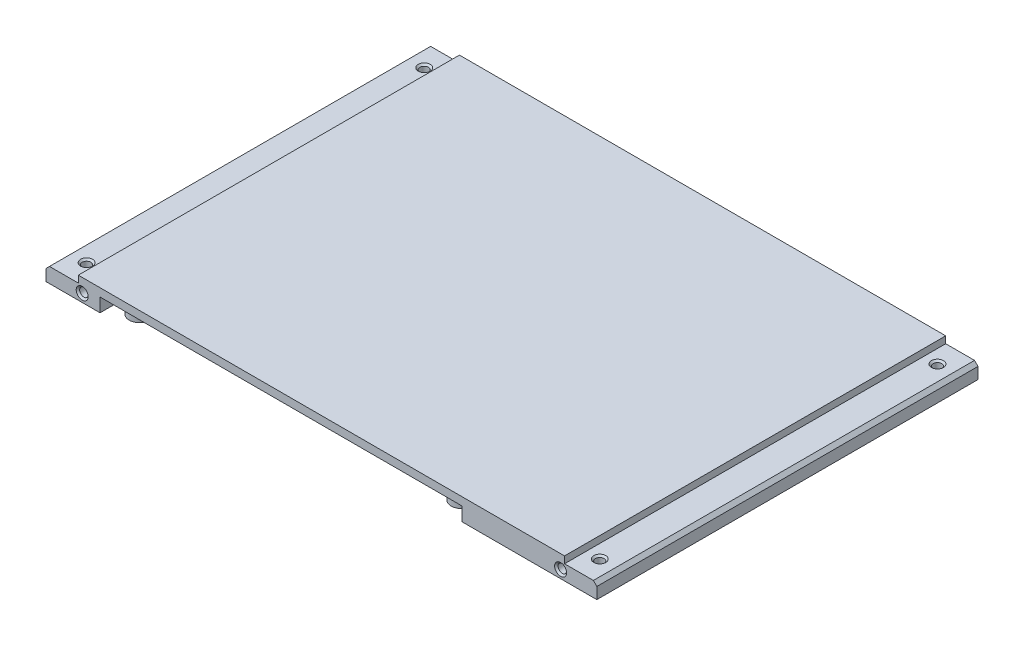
ISO-10303-21;
HEADER;
FILE_DESCRIPTION(('STEP AP214'),'2;1');
FILE_NAME('part.step','',(''),(''),'','','');
FILE_SCHEMA(('AUTOMOTIVE_DESIGN { 1 0 10303 214 1 1 1 1 }'));
ENDSEC;
DATA;
#1=APPLICATION_CONTEXT('core data for automotive mechanical design processes');
#2=APPLICATION_PROTOCOL_DEFINITION('international standard','automotive_design',2000,#1);
#3=PRODUCT_CONTEXT('',#1,'mechanical');
#4=PRODUCT('Part','Part','',(#3));
#5=PRODUCT_RELATED_PRODUCT_CATEGORY('part','',(#4));
#6=PRODUCT_DEFINITION_FORMATION('','',#4);
#7=PRODUCT_DEFINITION_CONTEXT('part definition',#1,'design');
#8=PRODUCT_DEFINITION('design','',#6,#7);
#9=PRODUCT_DEFINITION_SHAPE('','',#8);
#10=(LENGTH_UNIT() NAMED_UNIT(*) SI_UNIT(.MILLI.,.METRE.));
#11=(NAMED_UNIT(*) PLANE_ANGLE_UNIT() SI_UNIT($,.RADIAN.));
#12=(NAMED_UNIT(*) SI_UNIT($,.STERADIAN.) SOLID_ANGLE_UNIT());
#13=UNCERTAINTY_MEASURE_WITH_UNIT(LENGTH_MEASURE(1.E-05),#10,'distance_accuracy_value','');
#14=(GEOMETRIC_REPRESENTATION_CONTEXT(3) GLOBAL_UNCERTAINTY_ASSIGNED_CONTEXT((#13)) GLOBAL_UNIT_ASSIGNED_CONTEXT((#10,
#11,#12)) REPRESENTATION_CONTEXT('',''));
#15=CARTESIAN_POINT('',(0.,0.,0.));
#16=DIRECTION('',(0.,0.,1.));
#17=DIRECTION('',(1.,0.,0.));
#18=AXIS2_PLACEMENT_3D('',#15,#16,#17);
#19=CARTESIAN_POINT('',(-36.79,-2.35,-55.93651791));
#20=DIRECTION('',(0.,0.,-1.));
#21=DIRECTION('',(-1.,0.,0.));
#22=AXIS2_PLACEMENT_3D('',#19,#20,#21);
#23=PLANE('',#22);
#24=DIRECTION('',(0.,-1.,0.));
#25=VECTOR('',#24,1.);
#26=CARTESIAN_POINT('',(-24.09,-2.35,-55.93651791));
#27=LINE('',#26,#25);
#28=CARTESIAN_POINT('',(-24.09,-2.35,-55.93651791));
#29=VERTEX_POINT('',#28);
#30=CARTESIAN_POINT('',(-24.09,-4.25,-55.93651791));
#31=VERTEX_POINT('',#30);
#32=EDGE_CURVE('E2169',#29,#31,#27,.T.);
#33=ORIENTED_EDGE('',*,*,#32,.T.);
#34=DIRECTION('',(1.,0.,0.));
#35=VECTOR('',#34,1.);
#36=CARTESIAN_POINT('',(-36.79,-4.25,-55.93651791));
#37=LINE('',#36,#35);
#38=CARTESIAN_POINT('',(-36.79,-4.25,-55.93651791));
#39=VERTEX_POINT('',#38);
#40=EDGE_CURVE('E2153',#39,#31,#37,.T.);
#41=ORIENTED_EDGE('',*,*,#40,.F.);
#42=DIRECTION('',(0.,-1.,0.));
#43=VECTOR('',#42,1.);
#44=CARTESIAN_POINT('',(-36.79,-2.35,-55.93651791));
#45=LINE('',#44,#43);
#46=CARTESIAN_POINT('',(-36.79,-2.35,-55.93651791));
#47=VERTEX_POINT('',#46);
#48=EDGE_CURVE('E2170',#47,#39,#45,.T.);
#49=ORIENTED_EDGE('',*,*,#48,.F.);
#50=DIRECTION('',(1.,0.,0.));
#51=VECTOR('',#50,1.);
#52=CARTESIAN_POINT('',(-36.79,-2.35,-55.93651791));
#53=LINE('',#52,#51);
#54=EDGE_CURVE('E2157',#47,#29,#53,.T.);
#55=ORIENTED_EDGE('',*,*,#54,.T.);
#56=EDGE_LOOP('',(#33,#41,#49,#55));
#57=FACE_BOUND('',#56,.T.);
#58=ADVANCED_FACE('F53',(#57),#23,.T.);
#59=CARTESIAN_POINT('',(-36.79,-2.35,-55.93651791));
#60=DIRECTION('',(-1.,0.,0.));
#61=DIRECTION('',(0.,0.,1.));
#62=AXIS2_PLACEMENT_3D('',#59,#60,#61);
#63=PLANE('',#62);
#64=ORIENTED_EDGE('',*,*,#48,.T.);
#65=DIRECTION('',(0.,0.,-1.));
#66=VECTOR('',#65,1.);
#67=CARTESIAN_POINT('',(-36.79,-4.25,-43.23651791));
#68=LINE('',#67,#66);
#69=CARTESIAN_POINT('',(-36.79,-4.25,-43.23651791));
#70=VERTEX_POINT('',#69);
#71=EDGE_CURVE('E2151',#70,#39,#68,.T.);
#72=ORIENTED_EDGE('',*,*,#71,.F.);
#73=DIRECTION('',(0.,-1.,0.));
#74=VECTOR('',#73,1.);
#75=CARTESIAN_POINT('',(-36.79,-2.35,-43.23651791));
#76=LINE('',#75,#74);
#77=CARTESIAN_POINT('',(-36.79,-2.35,-43.23651791));
#78=VERTEX_POINT('',#77);
#79=EDGE_CURVE('E2174',#78,#70,#76,.T.);
#80=ORIENTED_EDGE('',*,*,#79,.F.);
#81=DIRECTION('',(0.,0.,-1.));
#82=VECTOR('',#81,1.);
#83=CARTESIAN_POINT('',(-36.79,-2.35,-55.93651791));
#84=LINE('',#83,#82);
#85=EDGE_CURVE('E2166',#78,#47,#84,.T.);
#86=ORIENTED_EDGE('',*,*,#85,.T.);
#87=EDGE_LOOP('',(#64,#72,#80,#86));
#88=FACE_BOUND('',#87,.T.);
#89=ADVANCED_FACE('F766',(#88),#63,.T.);
#90=CARTESIAN_POINT('',(-36.79,-2.35,-43.23651791));
#91=DIRECTION('',(0.,0.,1.));
#92=DIRECTION('',(1.,0.,0.));
#93=AXIS2_PLACEMENT_3D('',#90,#91,#92);
#94=PLANE('',#93);
#95=ORIENTED_EDGE('',*,*,#79,.T.);
#96=DIRECTION('',(-1.,0.,0.));
#97=VECTOR('',#96,1.);
#98=CARTESIAN_POINT('',(-24.09,-4.25,-43.23651791));
#99=LINE('',#98,#97);
#100=CARTESIAN_POINT('',(-24.09,-4.25,-43.23651791));
#101=VERTEX_POINT('',#100);
#102=EDGE_CURVE('E2149',#101,#70,#99,.T.);
#103=ORIENTED_EDGE('',*,*,#102,.F.);
#104=DIRECTION('',(0.,-1.,0.));
#105=VECTOR('',#104,1.);
#106=CARTESIAN_POINT('',(-24.09,-2.35,-43.23651791));
#107=LINE('',#106,#105);
#108=CARTESIAN_POINT('',(-24.09,-2.35,-43.23651791));
#109=VERTEX_POINT('',#108);
#110=EDGE_CURVE('E2177',#109,#101,#107,.T.);
#111=ORIENTED_EDGE('',*,*,#110,.F.);
#112=DIRECTION('',(-1.,0.,0.));
#113=VECTOR('',#112,1.);
#114=CARTESIAN_POINT('',(-36.79,-2.35,-43.23651791));
#115=LINE('',#114,#113);
#116=EDGE_CURVE('E2163',#109,#78,#115,.T.);
#117=ORIENTED_EDGE('',*,*,#116,.T.);
#118=EDGE_LOOP('',(#95,#103,#111,#117));
#119=FACE_BOUND('',#118,.T.);
#120=ADVANCED_FACE('F773',(#119),#94,.T.);
#121=CARTESIAN_POINT('',(-24.09,-2.35,-55.93651791));
#122=DIRECTION('',(1.,0.,0.));
#123=DIRECTION('',(0.,0.,-1.));
#124=AXIS2_PLACEMENT_3D('',#121,#122,#123);
#125=PLANE('',#124);
#126=ORIENTED_EDGE('',*,*,#110,.T.);
#127=DIRECTION('',(0.,0.,1.));
#128=VECTOR('',#127,1.);
#129=CARTESIAN_POINT('',(-24.09,-4.25,-55.93651791));
#130=LINE('',#129,#128);
#131=EDGE_CURVE('E2155',#31,#101,#130,.T.);
#132=ORIENTED_EDGE('',*,*,#131,.F.);
#133=ORIENTED_EDGE('',*,*,#32,.F.);
#134=DIRECTION('',(0.,0.,1.));
#135=VECTOR('',#134,1.);
#136=CARTESIAN_POINT('',(-24.09,-2.35,-55.93651791));
#137=LINE('',#136,#135);
#138=EDGE_CURVE('E2160',#29,#109,#137,.T.);
#139=ORIENTED_EDGE('',*,*,#138,.T.);
#140=EDGE_LOOP('',(#126,#132,#133,#139));
#141=FACE_BOUND('',#140,.T.);
#142=ADVANCED_FACE('F779',(#141),#125,.T.);
#143=CARTESIAN_POINT('',(-70.993,-2.,-272.271296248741));
#144=DIRECTION('',(-1.,0.,0.));
#145=DIRECTION('',(0.,0.,1.));
#146=AXIS2_PLACEMENT_3D('',#143,#144,#145);
#147=PLANE('',#146);
#148=DIRECTION('',(0.,1.,0.));
#149=VECTOR('',#148,1.);
#150=CARTESIAN_POINT('',(-70.993,-2.,-111.3));
#151=LINE('',#150,#149);
#152=CARTESIAN_POINT('',(-70.993,-2.,-111.3));
#153=VERTEX_POINT('',#152);
#154=CARTESIAN_POINT('',(-70.993,0.,-111.3));
#155=VERTEX_POINT('',#154);
#156=EDGE_CURVE('E560',#153,#155,#151,.T.);
#157=ORIENTED_EDGE('',*,*,#156,.F.);
#158=DIRECTION('',(0.,0.,1.));
#159=VECTOR('',#158,1.);
#160=CARTESIAN_POINT('',(-70.993,-2.,-272.271296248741));
#161=LINE('',#160,#159);
#162=CARTESIAN_POINT('',(-70.993,-2.,0.));
#163=VERTEX_POINT('',#162);
#164=EDGE_CURVE('E543',#153,#163,#161,.T.);
#165=ORIENTED_EDGE('',*,*,#164,.T.);
#166=DIRECTION('',(0.,-1.,0.));
#167=VECTOR('',#166,1.);
#168=CARTESIAN_POINT('',(-70.993,-2.,0.));
#169=LINE('',#168,#167);
#170=CARTESIAN_POINT('',(-70.993,0.,0.));
#171=VERTEX_POINT('',#170);
#172=EDGE_CURVE('E608',#171,#163,#169,.T.);
#173=ORIENTED_EDGE('',*,*,#172,.F.);
#174=DIRECTION('',(0.,0.,1.));
#175=VECTOR('',#174,1.);
#176=CARTESIAN_POINT('',(-70.993,0.,-272.271296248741));
#177=LINE('',#176,#175);
#178=EDGE_CURVE('E544',#155,#171,#177,.T.);
#179=ORIENTED_EDGE('',*,*,#178,.F.);
#180=EDGE_LOOP('',(#157,#165,#173,#179));
#181=FACE_BOUND('',#180,.T.);
#182=ADVANCED_FACE('F876',(#181),#147,.T.);
#183=CARTESIAN_POINT('',(-70.993,0.,-272.271296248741));
#184=DIRECTION('',(0.,1.,0.));
#185=DIRECTION('',(0.,0.,1.));
#186=AXIS2_PLACEMENT_3D('',#183,#184,#185);
#187=PLANE('',#186);
#188=DIRECTION('',(1.,0.,0.));
#189=VECTOR('',#188,1.);
#190=CARTESIAN_POINT('',(-70.993,0.,-111.3));
#191=LINE('',#190,#189);
#192=CARTESIAN_POINT('',(70.993,0.,-111.3));
#193=VERTEX_POINT('',#192);
#194=EDGE_CURVE('E617',#155,#193,#191,.T.);
#195=ORIENTED_EDGE('',*,*,#194,.F.);
#196=ORIENTED_EDGE('',*,*,#178,.T.);
#197=DIRECTION('',(-1.,0.,0.));
#198=VECTOR('',#197,1.);
#199=CARTESIAN_POINT('',(-70.993,0.,0.));
#200=LINE('',#199,#198);
#201=CARTESIAN_POINT('',(70.993,0.,0.));
#202=VERTEX_POINT('',#201);
#203=EDGE_CURVE('E540',#202,#171,#200,.T.);
#204=ORIENTED_EDGE('',*,*,#203,.F.);
#205=DIRECTION('',(0.,0.,1.));
#206=VECTOR('',#205,1.);
#207=CARTESIAN_POINT('',(70.993,0.,-272.271296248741));
#208=LINE('',#207,#206);
#209=EDGE_CURVE('E547',#193,#202,#208,.T.);
#210=ORIENTED_EDGE('',*,*,#209,.F.);
#211=EDGE_LOOP('',(#195,#196,#204,#210));
#212=FACE_BOUND('',#211,.T.);
#213=ADVANCED_FACE('F2076',(#212),#187,.T.);
#214=CARTESIAN_POINT('',(70.993,-2.,-272.271296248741));
#215=DIRECTION('',(1.,0.,0.));
#216=DIRECTION('',(0.,0.,-1.));
#217=AXIS2_PLACEMENT_3D('',#214,#215,#216);
#218=PLANE('',#217);
#219=DIRECTION('',(0.,-1.,0.));
#220=VECTOR('',#219,1.);
#221=CARTESIAN_POINT('',(70.993,-2.,-111.3));
#222=LINE('',#221,#220);
#223=CARTESIAN_POINT('',(70.993,-2.,-111.3));
#224=VERTEX_POINT('',#223);
#225=EDGE_CURVE('E513',#193,#224,#222,.T.);
#226=ORIENTED_EDGE('',*,*,#225,.F.);
#227=ORIENTED_EDGE('',*,*,#209,.T.);
#228=DIRECTION('',(0.,1.,0.));
#229=VECTOR('',#228,1.);
#230=CARTESIAN_POINT('',(70.993,-2.,0.));
#231=LINE('',#230,#229);
#232=CARTESIAN_POINT('',(70.993,-2.,0.));
#233=VERTEX_POINT('',#232);
#234=EDGE_CURVE('E532',#233,#202,#231,.T.);
#235=ORIENTED_EDGE('',*,*,#234,.F.);
#236=DIRECTION('',(0.,0.,1.));
#237=VECTOR('',#236,1.);
#238=CARTESIAN_POINT('',(70.993,-2.,-272.271296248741));
#239=LINE('',#238,#237);
#240=EDGE_CURVE('E549',#224,#233,#239,.T.);
#241=ORIENTED_EDGE('',*,*,#240,.F.);
#242=EDGE_LOOP('',(#226,#227,#235,#241));
#243=FACE_BOUND('',#242,.T.);
#244=ADVANCED_FACE('F2067',(#243),#218,.T.);
#245=CARTESIAN_POINT('',(70.993,-2.,-272.271296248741));
#246=DIRECTION('',(0.,1.,0.));
#247=DIRECTION('',(-1.,0.,0.));
#248=AXIS2_PLACEMENT_3D('',#245,#246,#247);
#249=PLANE('',#248);
#250=CARTESIAN_POINT('',(74.93,-1.99999999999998,-104.95));
#251=DIRECTION('',(0.,1.,0.));
#252=DIRECTION('',(0.,0.,1.));
#253=AXIS2_PLACEMENT_3D('',#250,#251,#252);
#254=CIRCLE('',#253,1.75);
#255=CARTESIAN_POINT('',(74.93,-1.99999999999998,-103.2));
#256=VERTEX_POINT('',#255);
#257=EDGE_CURVE('E2119',#256,#256,#254,.T.);
#258=ORIENTED_EDGE('',*,*,#257,.F.);
#259=EDGE_LOOP('',(#258));
#260=FACE_BOUND('',#259,.T.);
#261=CARTESIAN_POINT('',(74.93,-1.99999999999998,-6.35));
#262=DIRECTION('',(0.,1.,0.));
#263=DIRECTION('',(0.,0.,1.));
#264=AXIS2_PLACEMENT_3D('',#261,#262,#263);
#265=CIRCLE('',#264,1.75);
#266=CARTESIAN_POINT('',(74.93,-1.99999999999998,-4.6));
#267=VERTEX_POINT('',#266);
#268=EDGE_CURVE('E2122',#267,#267,#265,.T.);
#269=ORIENTED_EDGE('',*,*,#268,.F.);
#270=EDGE_LOOP('',(#269));
#271=FACE_BOUND('',#270,.T.);
#272=DIRECTION('',(-1.,0.,0.));
#273=VECTOR('',#272,1.);
#274=CARTESIAN_POINT('',(70.993,-2.,0.));
#275=LINE('',#274,#273);
#276=CARTESIAN_POINT('',(79.407,-2.,0.));
#277=VERTEX_POINT('',#276);
#278=EDGE_CURVE('E508',#277,#233,#275,.T.);
#279=ORIENTED_EDGE('',*,*,#278,.F.);
#280=DIRECTION('',(0.,0.,-1.));
#281=VECTOR('',#280,1.);
#282=CARTESIAN_POINT('',(79.407,-2.,-272.271296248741));
#283=LINE('',#282,#281);
#284=CARTESIAN_POINT('',(79.407,-2.,-111.3));
#285=VERTEX_POINT('',#284);
#286=EDGE_CURVE('E62',#277,#285,#283,.T.);
#287=ORIENTED_EDGE('',*,*,#286,.T.);
#288=DIRECTION('',(1.,0.,0.));
#289=VECTOR('',#288,1.);
#290=CARTESIAN_POINT('',(70.993,-2.,-111.3));
#291=LINE('',#290,#289);
#292=EDGE_CURVE('E506',#224,#285,#291,.T.);
#293=ORIENTED_EDGE('',*,*,#292,.F.);
#294=ORIENTED_EDGE('',*,*,#240,.T.);
#295=EDGE_LOOP('',(#279,#287,#293,#294));
#296=FACE_BOUND('',#295,.T.);
#297=ADVANCED_FACE('F504',(#260,#271,#296),#249,.T.);
#298=CARTESIAN_POINT('',(80.423,-2.,-272.271296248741));
#299=DIRECTION('',(1.,0.,0.));
#300=DIRECTION('',(0.,0.,-1.));
#301=AXIS2_PLACEMENT_3D('',#298,#299,#300);
#302=PLANE('',#301);
#303=DIRECTION('',(0.,-1.,0.));
#304=VECTOR('',#303,1.);
#305=CARTESIAN_POINT('',(80.423,-2.,-111.3));
#306=LINE('',#305,#304);
#307=CARTESIAN_POINT('',(80.423,-3.01599999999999,-111.3));
#308=VERTEX_POINT('',#307);
#309=CARTESIAN_POINT('',(80.423,-6.35,-111.3));
#310=VERTEX_POINT('',#309);
#311=EDGE_CURVE('E514',#308,#310,#306,.T.);
#312=ORIENTED_EDGE('',*,*,#311,.F.);
#313=DIRECTION('',(0.,0.,1.));
#314=VECTOR('',#313,1.);
#315=CARTESIAN_POINT('',(80.423,-3.01599999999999,-272.271296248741));
#316=LINE('',#315,#314);
#317=CARTESIAN_POINT('',(80.423,-3.01599999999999,0.));
#318=VERTEX_POINT('',#317);
#319=EDGE_CURVE('E498',#308,#318,#316,.T.);
#320=ORIENTED_EDGE('',*,*,#319,.T.);
#321=DIRECTION('',(0.,1.,0.));
#322=VECTOR('',#321,1.);
#323=CARTESIAN_POINT('',(80.423,-2.,0.));
#324=LINE('',#323,#322);
#325=CARTESIAN_POINT('',(80.423,-6.35,0.));
#326=VERTEX_POINT('',#325);
#327=EDGE_CURVE('E522',#326,#318,#324,.T.);
#328=ORIENTED_EDGE('',*,*,#327,.F.);
#329=DIRECTION('',(0.,0.,1.));
#330=VECTOR('',#329,1.);
#331=CARTESIAN_POINT('',(80.423,-6.35,-272.271296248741));
#332=LINE('',#331,#330);
#333=EDGE_CURVE('E551',#310,#326,#332,.T.);
#334=ORIENTED_EDGE('',*,*,#333,.F.);
#335=EDGE_LOOP('',(#312,#320,#328,#334));
#336=FACE_BOUND('',#335,.T.);
#337=ADVANCED_FACE('F520',(#336),#302,.T.);
#338=CARTESIAN_POINT('',(-80.423,-6.35,-272.271296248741));
#339=DIRECTION('',(0.,-1.,0.));
#340=DIRECTION('',(0.,0.,-1.));
#341=AXIS2_PLACEMENT_3D('',#338,#339,#340);
#342=PLANE('',#341);
#343=DIRECTION('',(0.,0.,1.));
#344=VECTOR('',#343,1.);
#345=CARTESIAN_POINT('',(64.643,-6.35,-14.71151791));
#346=LINE('',#345,#344);
#347=CARTESIAN_POINT('',(64.643,-6.35,-75.97401791));
#348=VERTEX_POINT('',#347);
#349=CARTESIAN_POINT('',(64.643,-6.35,-16.29901791));
#350=VERTEX_POINT('',#349);
#351=EDGE_CURVE('E598',#348,#350,#346,.T.);
#352=ORIENTED_EDGE('',*,*,#351,.F.);
#353=CARTESIAN_POINT('',(63.0555,-6.35,-75.97401791));
#354=DIRECTION('',(0.,-1.,0.));
#355=DIRECTION('',(0.,0.,-1.));
#356=AXIS2_PLACEMENT_3D('',#353,#354,#355);
#357=CIRCLE('',#356,1.5875);
#358=CARTESIAN_POINT('',(63.0555,-6.35,-77.56151791));
#359=VERTEX_POINT('',#358);
#360=EDGE_CURVE('E470',#348,#359,#357,.F.);
#361=ORIENTED_EDGE('',*,*,#360,.T.);
#362=DIRECTION('',(1.,0.,0.));
#363=VECTOR('',#362,1.);
#364=CARTESIAN_POINT('',(41.00068,-6.35,-77.56151791));
#365=LINE('',#364,#363);
#366=CARTESIAN_POINT('',(42.58818,-6.35,-77.56151791));
#367=VERTEX_POINT('',#366);
#368=EDGE_CURVE('E602',#367,#359,#365,.T.);
#369=ORIENTED_EDGE('',*,*,#368,.F.);
#370=CARTESIAN_POINT('',(42.58818,-6.35,-79.14901791));
#371=DIRECTION('',(0.,-1.,0.));
#372=DIRECTION('',(0.,0.,-1.));
#373=AXIS2_PLACEMENT_3D('',#370,#371,#372);
#374=CIRCLE('',#373,1.5875);
#375=CARTESIAN_POINT('',(41.00068,-6.35,-79.14901791));
#376=VERTEX_POINT('',#375);
#377=EDGE_CURVE('E577',#367,#376,#374,.T.);
#378=ORIENTED_EDGE('',*,*,#377,.T.);
#379=DIRECTION('',(0.,0.,1.));
#380=VECTOR('',#379,1.);
#381=CARTESIAN_POINT('',(41.00068,-6.35,-93.06151791));
#382=LINE('',#381,#380);
#383=CARTESIAN_POINT('',(41.00068,-6.35,-91.47401791));
#384=VERTEX_POINT('',#383);
#385=EDGE_CURVE('E656',#384,#376,#382,.T.);
#386=ORIENTED_EDGE('',*,*,#385,.F.);
#387=CARTESIAN_POINT('',(39.41318,-6.35,-91.47401791));
#388=DIRECTION('',(0.,-1.,0.));
#389=DIRECTION('',(0.,0.,-1.));
#390=AXIS2_PLACEMENT_3D('',#387,#388,#389);
#391=CIRCLE('',#390,1.5875);
#392=CARTESIAN_POINT('',(39.41318,-6.35,-93.06151791));
#393=VERTEX_POINT('',#392);
#394=EDGE_CURVE('E476',#384,#393,#391,.F.);
#395=ORIENTED_EDGE('',*,*,#394,.T.);
#396=DIRECTION('',(1.,0.,0.));
#397=VECTOR('',#396,1.);
#398=CARTESIAN_POINT('',(-22.9997,-6.35,-93.06151791));
#399=LINE('',#398,#397);
#400=CARTESIAN_POINT('',(-21.4122,-6.35,-93.06151791));
#401=VERTEX_POINT('',#400);
#402=EDGE_CURVE('E653',#401,#393,#399,.T.);
#403=ORIENTED_EDGE('',*,*,#402,.F.);
#404=CARTESIAN_POINT('',(-21.4122,-6.35,-91.47401791));
#405=DIRECTION('',(0.,-1.,0.));
#406=DIRECTION('',(0.,0.,-1.));
#407=AXIS2_PLACEMENT_3D('',#404,#405,#406);
#408=CIRCLE('',#407,1.5875);
#409=CARTESIAN_POINT('',(-22.9997,-6.35,-91.47401791));
#410=VERTEX_POINT('',#409);
#411=EDGE_CURVE('E478',#401,#410,#408,.F.);
#412=ORIENTED_EDGE('',*,*,#411,.T.);
#413=DIRECTION('',(0.,0.,-1.));
#414=VECTOR('',#413,1.);
#415=CARTESIAN_POINT('',(-22.9997,-6.35,-77.56151791));
#416=LINE('',#415,#414);
#417=CARTESIAN_POINT('',(-22.9997,-6.35,-79.14901791));
#418=VERTEX_POINT('',#417);
#419=EDGE_CURVE('E643',#418,#410,#416,.T.);
#420=ORIENTED_EDGE('',*,*,#419,.F.);
#421=CARTESIAN_POINT('',(-24.5872,-6.35,-79.14901791));
#422=DIRECTION('',(0.,-1.,0.));
#423=DIRECTION('',(0.,0.,-1.));
#424=AXIS2_PLACEMENT_3D('',#421,#422,#423);
#425=CIRCLE('',#424,1.5875);
#426=CARTESIAN_POINT('',(-24.5872,-6.35,-77.56151791));
#427=VERTEX_POINT('',#426);
#428=EDGE_CURVE('E575',#418,#427,#425,.T.);
#429=ORIENTED_EDGE('',*,*,#428,.T.);
#430=DIRECTION('',(1.,0.,0.));
#431=VECTOR('',#430,1.);
#432=CARTESIAN_POINT('',(-64.643,-6.35,-77.56151791));
#433=LINE('',#432,#431);
#434=CARTESIAN_POINT('',(-63.0555,-6.35,-77.56151791));
#435=VERTEX_POINT('',#434);
#436=EDGE_CURVE('E639',#435,#427,#433,.T.);
#437=ORIENTED_EDGE('',*,*,#436,.F.);
#438=CARTESIAN_POINT('',(-63.0555,-6.35,-75.97401791));
#439=DIRECTION('',(0.,-1.,0.));
#440=DIRECTION('',(0.,0.,-1.));
#441=AXIS2_PLACEMENT_3D('',#438,#439,#440);
#442=CIRCLE('',#441,1.5875);
#443=CARTESIAN_POINT('',(-64.643,-6.35,-75.97401791));
#444=VERTEX_POINT('',#443);
#445=EDGE_CURVE('E482',#435,#444,#442,.F.);
#446=ORIENTED_EDGE('',*,*,#445,.T.);
#447=DIRECTION('',(0.,0.,-1.));
#448=VECTOR('',#447,1.);
#449=CARTESIAN_POINT('',(-64.643,-6.35,0.));
#450=LINE('',#449,#448);
#451=CARTESIAN_POINT('',(-64.643,-6.35,0.));
#452=VERTEX_POINT('',#451);
#453=EDGE_CURVE('E635',#452,#444,#450,.T.);
#454=ORIENTED_EDGE('',*,*,#453,.F.);
#455=DIRECTION('',(1.,0.,0.));
#456=VECTOR('',#455,1.);
#457=CARTESIAN_POINT('',(-80.423,-6.35,0.));
#458=LINE('',#457,#456);
#459=CARTESIAN_POINT('',(-80.423,-6.35,0.));
#460=VERTEX_POINT('',#459);
#461=EDGE_CURVE('E530',#460,#452,#458,.T.);
#462=ORIENTED_EDGE('',*,*,#461,.F.);
#463=DIRECTION('',(0.,0.,1.));
#464=VECTOR('',#463,1.);
#465=CARTESIAN_POINT('',(-80.423,-6.35,-272.271296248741));
#466=LINE('',#465,#464);
#467=CARTESIAN_POINT('',(-80.423,-6.35,-111.3));
#468=VERTEX_POINT('',#467);
#469=EDGE_CURVE('E553',#468,#460,#466,.T.);
#470=ORIENTED_EDGE('',*,*,#469,.F.);
#471=DIRECTION('',(-1.,0.,0.));
#472=VECTOR('',#471,1.);
#473=CARTESIAN_POINT('',(-80.423,-6.35,-111.3));
#474=LINE('',#473,#472);
#475=EDGE_CURVE('E613',#310,#468,#474,.T.);
#476=ORIENTED_EDGE('',*,*,#475,.F.);
#477=ORIENTED_EDGE('',*,*,#333,.T.);
#478=CARTESIAN_POINT('',(41.00068,-6.35,0.));
#479=VERTEX_POINT('',#478);
#480=EDGE_CURVE('E528',#479,#326,#458,.T.);
#481=ORIENTED_EDGE('',*,*,#480,.F.);
#482=DIRECTION('',(0.,0.,1.));
#483=VECTOR('',#482,1.);
#484=CARTESIAN_POINT('',(41.00068,-6.35,0.));
#485=LINE('',#484,#483);
#486=CARTESIAN_POINT('',(41.00068,-6.35,-13.12401791));
#487=VERTEX_POINT('',#486);
#488=EDGE_CURVE('E597',#487,#479,#485,.T.);
#489=ORIENTED_EDGE('',*,*,#488,.F.);
#490=CARTESIAN_POINT('',(42.58818,-6.35,-13.12401791));
#491=DIRECTION('',(0.,-1.,0.));
#492=DIRECTION('',(0.,0.,-1.));
#493=AXIS2_PLACEMENT_3D('',#490,#491,#492);
#494=CIRCLE('',#493,1.5875);
#495=CARTESIAN_POINT('',(42.58818,-6.35,-14.71151791));
#496=VERTEX_POINT('',#495);
#497=EDGE_CURVE('E579',#487,#496,#494,.T.);
#498=ORIENTED_EDGE('',*,*,#497,.T.);
#499=DIRECTION('',(-1.,0.,0.));
#500=VECTOR('',#499,1.);
#501=CARTESIAN_POINT('',(64.643,-6.35,-14.71151791));
#502=LINE('',#501,#500);
#503=CARTESIAN_POINT('',(63.0555,-6.35,-14.71151791));
#504=VERTEX_POINT('',#503);
#505=EDGE_CURVE('E587',#504,#496,#502,.T.);
#506=ORIENTED_EDGE('',*,*,#505,.F.);
#507=CARTESIAN_POINT('',(63.0555,-6.35,-16.29901791));
#508=DIRECTION('',(0.,-1.,0.));
#509=DIRECTION('',(0.,0.,-1.));
#510=AXIS2_PLACEMENT_3D('',#507,#508,#509);
#511=CIRCLE('',#510,1.5875);
#512=EDGE_CURVE('E468',#504,#350,#511,.F.);
#513=ORIENTED_EDGE('',*,*,#512,.T.);
#514=EDGE_LOOP('',(#352,#361,#369,#378,#386,#395,#403,#412,#420,#429,#437,#446,#454,#462,#470,
#476,#477,#481,#489,#498,#506,#513));
#515=FACE_BOUND('',#514,.T.);
#516=CARTESIAN_POINT('',(-26.,-6.35,-80.7500000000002));
#517=DIRECTION('',(0.,-1.,0.));
#518=DIRECTION('',(0.,0.,-1.));
#519=AXIS2_PLACEMENT_3D('',#516,#517,#518);
#520=CIRCLE('',#519,1.5);
#521=CARTESIAN_POINT('',(-26.,-6.35,-82.2500000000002));
#522=VERTEX_POINT('',#521);
#523=EDGE_CURVE('E390',#522,#522,#520,.T.);
#524=ORIENTED_EDGE('',*,*,#523,.F.);
#525=EDGE_LOOP('',(#524));
#526=FACE_BOUND('',#525,.T.);
#527=CARTESIAN_POINT('',(-26.,-6.35,-104.95));
#528=DIRECTION('',(0.,-1.,0.));
#529=DIRECTION('',(0.,0.,-1.));
#530=AXIS2_PLACEMENT_3D('',#527,#528,#529);
#531=CIRCLE('',#530,1.5);
#532=CARTESIAN_POINT('',(-26.,-6.35,-106.45));
#533=VERTEX_POINT('',#532);
#534=EDGE_CURVE('E2448',#533,#533,#531,.T.);
#535=ORIENTED_EDGE('',*,*,#534,.F.);
#536=EDGE_LOOP('',(#535));
#537=FACE_BOUND('',#536,.T.);
#538=CARTESIAN_POINT('',(-66.3,-6.35,-104.95));
#539=DIRECTION('',(0.,-1.,0.));
#540=DIRECTION('',(0.,0.,-1.));
#541=AXIS2_PLACEMENT_3D('',#538,#539,#540);
#542=CIRCLE('',#541,1.5);
#543=CARTESIAN_POINT('',(-66.3,-6.35,-106.45));
#544=VERTEX_POINT('',#543);
#545=EDGE_CURVE('E2439',#544,#544,#542,.T.);
#546=ORIENTED_EDGE('',*,*,#545,.F.);
#547=EDGE_LOOP('',(#546));
#548=FACE_BOUND('',#547,.T.);
#549=CARTESIAN_POINT('',(-65.55,-6.35,-82.));
#550=DIRECTION('',(0.,-1.,0.));
#551=DIRECTION('',(0.,0.,-1.));
#552=AXIS2_PLACEMENT_3D('',#549,#550,#551);
#553=CIRCLE('',#552,1.5);
#554=CARTESIAN_POINT('',(-65.55,-6.35,-83.5));
#555=VERTEX_POINT('',#554);
#556=EDGE_CURVE('E2430',#555,#555,#553,.T.);
#557=ORIENTED_EDGE('',*,*,#556,.F.);
#558=EDGE_LOOP('',(#557));
#559=FACE_BOUND('',#558,.T.);
#560=CARTESIAN_POINT('',(-68.,-6.35,-97.88));
#561=DIRECTION('',(0.,-1.,0.));
#562=DIRECTION('',(0.,0.,-1.));
#563=AXIS2_PLACEMENT_3D('',#560,#561,#562);
#564=CIRCLE('',#563,1.75);
#565=CARTESIAN_POINT('',(-68.,-6.35,-99.63));
#566=VERTEX_POINT('',#565);
#567=EDGE_CURVE('E2340',#566,#566,#564,.T.);
#568=ORIENTED_EDGE('',*,*,#567,.F.);
#569=EDGE_LOOP('',(#568));
#570=FACE_BOUND('',#569,.T.);
#571=CARTESIAN_POINT('',(-68.,-6.35,-20.88));
#572=DIRECTION('',(0.,-1.,0.));
#573=DIRECTION('',(0.,0.,-1.));
#574=AXIS2_PLACEMENT_3D('',#571,#572,#573);
#575=CIRCLE('',#574,1.75);
#576=CARTESIAN_POINT('',(-68.,-6.35,-22.63));
#577=VERTEX_POINT('',#576);
#578=EDGE_CURVE('E2322',#577,#577,#575,.T.);
#579=ORIENTED_EDGE('',*,*,#578,.F.);
#580=EDGE_LOOP('',(#579));
#581=FACE_BOUND('',#580,.T.);
#582=CARTESIAN_POINT('',(68.,-6.35,-97.88));
#583=DIRECTION('',(0.,-1.,0.));
#584=DIRECTION('',(0.,0.,-1.));
#585=AXIS2_PLACEMENT_3D('',#582,#583,#584);
#586=CIRCLE('',#585,1.75);
#587=CARTESIAN_POINT('',(68.,-6.35,-99.63));
#588=VERTEX_POINT('',#587);
#589=EDGE_CURVE('E2286',#588,#588,#586,.T.);
#590=ORIENTED_EDGE('',*,*,#589,.F.);
#591=EDGE_LOOP('',(#590));
#592=FACE_BOUND('',#591,.T.);
#593=CARTESIAN_POINT('',(68.,-6.35,-20.88));
#594=DIRECTION('',(0.,-1.,0.));
#595=DIRECTION('',(0.,0.,-1.));
#596=AXIS2_PLACEMENT_3D('',#593,#594,#595);
#597=CIRCLE('',#596,1.75);
#598=CARTESIAN_POINT('',(68.,-6.35,-22.63));
#599=VERTEX_POINT('',#598);
#600=EDGE_CURVE('E2277',#599,#599,#597,.T.);
#601=ORIENTED_EDGE('',*,*,#600,.F.);
#602=EDGE_LOOP('',(#601));
#603=FACE_BOUND('',#602,.T.);
#604=CARTESIAN_POINT('',(-74.93,-6.35,-6.35));
#605=DIRECTION('',(0.,1.,0.));
#606=DIRECTION('',(0.,0.,1.));
#607=AXIS2_PLACEMENT_3D('',#604,#605,#606);
#608=CIRCLE('',#607,1.25);
#609=CARTESIAN_POINT('',(-74.93,-6.35,-5.1));
#610=VERTEX_POINT('',#609);
#611=EDGE_CURVE('E2262',#610,#610,#608,.T.);
#612=ORIENTED_EDGE('',*,*,#611,.T.);
#613=EDGE_LOOP('',(#612));
#614=FACE_BOUND('',#613,.T.);
#615=CARTESIAN_POINT('',(-74.93,-6.35,-104.95));
#616=DIRECTION('',(0.,1.,0.));
#617=DIRECTION('',(0.,0.,1.));
#618=AXIS2_PLACEMENT_3D('',#615,#616,#617);
#619=CIRCLE('',#618,1.25);
#620=CARTESIAN_POINT('',(-74.93,-6.35,-103.7));
#621=VERTEX_POINT('',#620);
#622=EDGE_CURVE('E2253',#621,#621,#619,.T.);
#623=ORIENTED_EDGE('',*,*,#622,.T.);
#624=EDGE_LOOP('',(#623));
#625=FACE_BOUND('',#624,.T.);
#626=CARTESIAN_POINT('',(74.93,-6.34999999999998,-104.95));
#627=DIRECTION('',(0.,1.,0.));
#628=DIRECTION('',(0.,0.,1.));
#629=AXIS2_PLACEMENT_3D('',#626,#627,#628);
#630=CIRCLE('',#629,1.25);
#631=CARTESIAN_POINT('',(74.93,-6.34999999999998,-103.7));
#632=VERTEX_POINT('',#631);
#633=EDGE_CURVE('E2125',#632,#632,#630,.T.);
#634=ORIENTED_EDGE('',*,*,#633,.T.);
#635=EDGE_LOOP('',(#634));
#636=FACE_BOUND('',#635,.T.);
#637=CARTESIAN_POINT('',(74.93,-6.34999999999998,-6.35));
#638=DIRECTION('',(0.,1.,0.));
#639=DIRECTION('',(0.,0.,1.));
#640=AXIS2_PLACEMENT_3D('',#637,#638,#639);
#641=CIRCLE('',#640,1.25);
#642=CARTESIAN_POINT('',(74.93,-6.34999999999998,-5.1));
#643=VERTEX_POINT('',#642);
#644=EDGE_CURVE('E2128',#643,#643,#641,.T.);
#645=ORIENTED_EDGE('',*,*,#644,.T.);
#646=EDGE_LOOP('',(#645));
#647=FACE_BOUND('',#646,.T.);
#648=ADVANCED_FACE('F594',(#515,#526,#537,#548,#559,#570,#581,#592,#603,#614,#625,#636,#647),
#342,.T.);
#649=CARTESIAN_POINT('',(-80.423,-2.,-272.271296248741));
#650=DIRECTION('',(-1.,0.,0.));
#651=DIRECTION('',(0.,0.,1.));
#652=AXIS2_PLACEMENT_3D('',#649,#650,#651);
#653=PLANE('',#652);
#654=DIRECTION('',(0.,-1.,0.));
#655=VECTOR('',#654,1.);
#656=CARTESIAN_POINT('',(-80.423,-2.,0.));
#657=LINE('',#656,#655);
#658=CARTESIAN_POINT('',(-80.423,-3.01599999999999,0.));
#659=VERTEX_POINT('',#658);
#660=EDGE_CURVE('E623',#659,#460,#657,.T.);
#661=ORIENTED_EDGE('',*,*,#660,.F.);
#662=DIRECTION('',(0.,0.,-1.));
#663=VECTOR('',#662,1.);
#664=CARTESIAN_POINT('',(-80.423,-3.01599999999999,-272.271296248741));
#665=LINE('',#664,#663);
#666=CARTESIAN_POINT('',(-80.423,-3.01599999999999,-111.3));
#667=VERTEX_POINT('',#666);
#668=EDGE_CURVE('E493',#659,#667,#665,.T.);
#669=ORIENTED_EDGE('',*,*,#668,.T.);
#670=DIRECTION('',(0.,1.,0.));
#671=VECTOR('',#670,1.);
#672=CARTESIAN_POINT('',(-80.423,-2.,-111.3));
#673=LINE('',#672,#671);
#674=EDGE_CURVE('E546',#468,#667,#673,.T.);
#675=ORIENTED_EDGE('',*,*,#674,.F.);
#676=ORIENTED_EDGE('',*,*,#469,.T.);
#677=EDGE_LOOP('',(#661,#669,#675,#676));
#678=FACE_BOUND('',#677,.T.);
#679=ADVANCED_FACE('F631',(#678),#653,.T.);
#680=CARTESIAN_POINT('',(-70.993,-2.,-272.271296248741));
#681=DIRECTION('',(0.,1.,0.));
#682=DIRECTION('',(-1.,0.,0.));
#683=AXIS2_PLACEMENT_3D('',#680,#681,#682);
#684=PLANE('',#683);
#685=CARTESIAN_POINT('',(-74.93,-2.,-6.35));
#686=DIRECTION('',(0.,1.,0.));
#687=DIRECTION('',(0.,0.,1.));
#688=AXIS2_PLACEMENT_3D('',#685,#686,#687);
#689=CIRCLE('',#688,1.75);
#690=CARTESIAN_POINT('',(-74.93,-2.,-4.6));
#691=VERTEX_POINT('',#690);
#692=EDGE_CURVE('E2268',#691,#691,#689,.T.);
#693=ORIENTED_EDGE('',*,*,#692,.F.);
#694=EDGE_LOOP('',(#693));
#695=FACE_BOUND('',#694,.T.);
#696=CARTESIAN_POINT('',(-74.93,-2.,-104.95));
#697=DIRECTION('',(0.,1.,0.));
#698=DIRECTION('',(0.,0.,1.));
#699=AXIS2_PLACEMENT_3D('',#696,#697,#698);
#700=CIRCLE('',#699,1.75);
#701=CARTESIAN_POINT('',(-74.93,-2.,-103.2));
#702=VERTEX_POINT('',#701);
#703=EDGE_CURVE('E2259',#702,#702,#700,.T.);
#704=ORIENTED_EDGE('',*,*,#703,.F.);
#705=EDGE_LOOP('',(#704));
#706=FACE_BOUND('',#705,.T.);
#707=DIRECTION('',(1.,0.,0.));
#708=VECTOR('',#707,1.);
#709=CARTESIAN_POINT('',(-70.993,-2.,-111.3));
#710=LINE('',#709,#708);
#711=CARTESIAN_POINT('',(-79.407,-2.,-111.3));
#712=VERTEX_POINT('',#711);
#713=EDGE_CURVE('E557',#712,#153,#710,.T.);
#714=ORIENTED_EDGE('',*,*,#713,.F.);
#715=DIRECTION('',(0.,0.,1.));
#716=VECTOR('',#715,1.);
#717=CARTESIAN_POINT('',(-79.407,-2.,-272.271296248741));
#718=LINE('',#717,#716);
#719=CARTESIAN_POINT('',(-79.407,-2.,0.));
#720=VERTEX_POINT('',#719);
#721=EDGE_CURVE('E486',#712,#720,#718,.T.);
#722=ORIENTED_EDGE('',*,*,#721,.T.);
#723=DIRECTION('',(-1.,0.,0.));
#724=VECTOR('',#723,1.);
#725=CARTESIAN_POINT('',(-70.993,-2.,0.));
#726=LINE('',#725,#724);
#727=EDGE_CURVE('E622',#163,#720,#726,.T.);
#728=ORIENTED_EDGE('',*,*,#727,.F.);
#729=ORIENTED_EDGE('',*,*,#164,.F.);
#730=EDGE_LOOP('',(#714,#722,#728,#729));
#731=FACE_BOUND('',#730,.T.);
#732=ADVANCED_FACE('F2024',(#695,#706,#731),#684,.T.);
#733=CARTESIAN_POINT('',(0.,0.,0.));
#734=DIRECTION('',(0.,0.,-1.));
#735=DIRECTION('',(-1.,0.,0.));
#736=AXIS2_PLACEMENT_3D('',#733,#734,#735);
#737=PLANE('',#736);
#738=CARTESIAN_POINT('',(-69.85,-4.00000000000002,0.));
#739=DIRECTION('',(0.,0.,1.));
#740=DIRECTION('',(1.,0.,0.));
#741=AXIS2_PLACEMENT_3D('',#738,#739,#740);
#742=CIRCLE('',#741,1.75);
#743=CARTESIAN_POINT('',(-68.1,-4.00000000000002,0.));
#744=VERTEX_POINT('',#743);
#745=EDGE_CURVE('E2358',#744,#744,#742,.T.);
#746=ORIENTED_EDGE('',*,*,#745,.F.);
#747=EDGE_LOOP('',(#746));
#748=FACE_BOUND('',#747,.T.);
#749=CARTESIAN_POINT('',(69.85,-4.00000000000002,0.));
#750=DIRECTION('',(0.,0.,1.));
#751=DIRECTION('',(1.,0.,0.));
#752=AXIS2_PLACEMENT_3D('',#749,#750,#751);
#753=CIRCLE('',#752,1.75);
#754=CARTESIAN_POINT('',(71.6,-4.00000000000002,0.));
#755=VERTEX_POINT('',#754);
#756=EDGE_CURVE('E2349',#755,#755,#753,.T.);
#757=ORIENTED_EDGE('',*,*,#756,.F.);
#758=EDGE_LOOP('',(#757));
#759=FACE_BOUND('',#758,.T.);
#760=ORIENTED_EDGE('',*,*,#727,.T.);
#761=DIRECTION('',(0.707106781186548,0.707106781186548,0.));
#762=VECTOR('',#761,1.);
#763=CARTESIAN_POINT('',(-79.407,-2.,0.));
#764=LINE('',#763,#762);
#765=EDGE_CURVE('E491',#720,#659,#764,.F.);
#766=ORIENTED_EDGE('',*,*,#765,.T.);
#767=ORIENTED_EDGE('',*,*,#660,.T.);
#768=ORIENTED_EDGE('',*,*,#461,.T.);
#769=DIRECTION('',(0.,-1.,0.));
#770=VECTOR('',#769,1.);
#771=CARTESIAN_POINT('',(-64.643,-2.35,0.));
#772=LINE('',#771,#770);
#773=CARTESIAN_POINT('',(-64.643,-2.35,0.));
#774=VERTEX_POINT('',#773);
#775=EDGE_CURVE('E609',#774,#452,#772,.T.);
#776=ORIENTED_EDGE('',*,*,#775,.F.);
#777=DIRECTION('',(-1.,0.,0.));
#778=VECTOR('',#777,1.);
#779=CARTESIAN_POINT('',(-64.643,-2.35,0.));
#780=LINE('',#779,#778);
#781=CARTESIAN_POINT('',(41.00068,-2.35,0.));
#782=VERTEX_POINT('',#781);
#783=EDGE_CURVE('E600',#782,#774,#780,.T.);
#784=ORIENTED_EDGE('',*,*,#783,.F.);
#785=DIRECTION('',(0.,-1.,0.));
#786=VECTOR('',#785,1.);
#787=CARTESIAN_POINT('',(41.00068,-2.35,0.));
#788=LINE('',#787,#786);
#789=EDGE_CURVE('E606',#782,#479,#788,.T.);
#790=ORIENTED_EDGE('',*,*,#789,.T.);
#791=ORIENTED_EDGE('',*,*,#480,.T.);
#792=ORIENTED_EDGE('',*,*,#327,.T.);
#793=DIRECTION('',(0.707106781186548,-0.707106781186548,0.));
#794=VECTOR('',#793,1.);
#795=CARTESIAN_POINT('',(80.423,-3.01599999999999,0.));
#796=LINE('',#795,#794);
#797=EDGE_CURVE('E489',#318,#277,#796,.F.);
#798=ORIENTED_EDGE('',*,*,#797,.T.);
#799=ORIENTED_EDGE('',*,*,#278,.T.);
#800=ORIENTED_EDGE('',*,*,#234,.T.);
#801=ORIENTED_EDGE('',*,*,#203,.T.);
#802=ORIENTED_EDGE('',*,*,#172,.T.);
#803=EDGE_LOOP('',(#760,#766,#767,#768,#776,#784,#790,#791,#792,#798,#799,#800,#801,#802));
#804=FACE_BOUND('',#803,.T.);
#805=ADVANCED_FACE('F525',(#748,#759,#804),#737,.F.);
#806=CARTESIAN_POINT('',(0.,0.,-111.3));
#807=DIRECTION('',(0.,0.,1.));
#808=DIRECTION('',(1.,0.,0.));
#809=AXIS2_PLACEMENT_3D('',#806,#807,#808);
#810=PLANE('',#809);
#811=CARTESIAN_POINT('',(69.85,-4.00000000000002,-111.3));
#812=DIRECTION('',(0.,0.,-1.));
#813=DIRECTION('',(-1.,0.,0.));
#814=AXIS2_PLACEMENT_3D('',#811,#812,#813);
#815=CIRCLE('',#814,1.75);
#816=CARTESIAN_POINT('',(68.1,-4.00000000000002,-111.3));
#817=VERTEX_POINT('',#816);
#818=EDGE_CURVE('E2385',#817,#817,#815,.T.);
#819=ORIENTED_EDGE('',*,*,#818,.F.);
#820=EDGE_LOOP('',(#819));
#821=FACE_BOUND('',#820,.T.);
#822=CARTESIAN_POINT('',(-69.85,-4.00000000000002,-111.3));
#823=DIRECTION('',(0.,0.,-1.));
#824=DIRECTION('',(-1.,0.,0.));
#825=AXIS2_PLACEMENT_3D('',#822,#823,#824);
#826=CIRCLE('',#825,1.75);
#827=CARTESIAN_POINT('',(-71.6,-4.00000000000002,-111.3));
#828=VERTEX_POINT('',#827);
#829=EDGE_CURVE('E2376',#828,#828,#826,.T.);
#830=ORIENTED_EDGE('',*,*,#829,.F.);
#831=EDGE_LOOP('',(#830));
#832=FACE_BOUND('',#831,.T.);
#833=CARTESIAN_POINT('',(0.,-4.00000000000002,-111.3));
#834=DIRECTION('',(0.,0.,-1.));
#835=DIRECTION('',(-1.,0.,0.));
#836=AXIS2_PLACEMENT_3D('',#833,#834,#835);
#837=CIRCLE('',#836,1.75);
#838=CARTESIAN_POINT('',(-1.75,-4.00000000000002,-111.3));
#839=VERTEX_POINT('',#838);
#840=EDGE_CURVE('E2367',#839,#839,#837,.T.);
#841=ORIENTED_EDGE('',*,*,#840,.F.);
#842=EDGE_LOOP('',(#841));
#843=FACE_BOUND('',#842,.T.);
#844=ORIENTED_EDGE('',*,*,#674,.T.);
#845=DIRECTION('',(-0.707106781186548,-0.707106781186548,0.));
#846=VECTOR('',#845,1.);
#847=CARTESIAN_POINT('',(-79.407,-2.,-111.3));
#848=LINE('',#847,#846);
#849=EDGE_CURVE('E496',#667,#712,#848,.F.);
#850=ORIENTED_EDGE('',*,*,#849,.T.);
#851=ORIENTED_EDGE('',*,*,#713,.T.);
#852=ORIENTED_EDGE('',*,*,#156,.T.);
#853=ORIENTED_EDGE('',*,*,#194,.T.);
#854=ORIENTED_EDGE('',*,*,#225,.T.);
#855=ORIENTED_EDGE('',*,*,#292,.T.);
#856=DIRECTION('',(-0.707106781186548,0.707106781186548,0.));
#857=VECTOR('',#856,1.);
#858=CARTESIAN_POINT('',(80.423,-3.01599999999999,-111.3));
#859=LINE('',#858,#857);
#860=EDGE_CURVE('E76',#285,#308,#859,.F.);
#861=ORIENTED_EDGE('',*,*,#860,.T.);
#862=ORIENTED_EDGE('',*,*,#311,.T.);
#863=ORIENTED_EDGE('',*,*,#475,.T.);
#864=EDGE_LOOP('',(#844,#850,#851,#852,#853,#854,#855,#861,#862,#863));
#865=FACE_BOUND('',#864,.T.);
#866=ADVANCED_FACE('F511',(#821,#832,#843,#865),#810,.F.);
#867=CARTESIAN_POINT('',(41.00068,-2.35,0.));
#868=DIRECTION('',(1.,0.,0.));
#869=DIRECTION('',(0.,0.,-1.));
#870=AXIS2_PLACEMENT_3D('',#867,#868,#869);
#871=PLANE('',#870);
#872=DIRECTION('',(0.,0.,1.));
#873=VECTOR('',#872,1.);
#874=CARTESIAN_POINT('',(41.00068,-2.35,0.));
#875=LINE('',#874,#873);
#876=CARTESIAN_POINT('',(41.00068,-2.35,-13.12401791));
#877=VERTEX_POINT('',#876);
#878=EDGE_CURVE('E611',#877,#782,#875,.T.);
#879=ORIENTED_EDGE('',*,*,#878,.F.);
#880=DIRECTION('',(0.,-1.,0.));
#881=VECTOR('',#880,1.);
#882=CARTESIAN_POINT('',(41.00068,-2.35,-13.12401791));
#883=LINE('',#882,#881);
#884=EDGE_CURVE('E572',#877,#487,#883,.T.);
#885=ORIENTED_EDGE('',*,*,#884,.T.);
#886=ORIENTED_EDGE('',*,*,#488,.T.);
#887=ORIENTED_EDGE('',*,*,#789,.F.);
#888=EDGE_LOOP('',(#879,#885,#886,#887));
#889=FACE_BOUND('',#888,.T.);
#890=ADVANCED_FACE('F700',(#889),#871,.F.);
#891=CARTESIAN_POINT('',(64.643,-2.35,-14.71151791));
#892=DIRECTION('',(0.,0.,1.));
#893=DIRECTION('',(1.,0.,0.));
#894=AXIS2_PLACEMENT_3D('',#891,#892,#893);
#895=PLANE('',#894);
#896=ORIENTED_EDGE('',*,*,#505,.T.);
#897=DIRECTION('',(0.,-1.,0.));
#898=VECTOR('',#897,1.);
#899=CARTESIAN_POINT('',(42.58818,-2.35,-14.71151791));
#900=LINE('',#899,#898);
#901=CARTESIAN_POINT('',(42.58818,-2.35,-14.71151791));
#902=VERTEX_POINT('',#901);
#903=EDGE_CURVE('E399',#496,#902,#900,.F.);
#904=ORIENTED_EDGE('',*,*,#903,.T.);
#905=DIRECTION('',(-1.,0.,0.));
#906=VECTOR('',#905,1.);
#907=CARTESIAN_POINT('',(64.643,-2.35,-14.71151791));
#908=LINE('',#907,#906);
#909=CARTESIAN_POINT('',(63.0555,-2.35,-14.71151791));
#910=VERTEX_POINT('',#909);
#911=EDGE_CURVE('E590',#910,#902,#908,.T.);
#912=ORIENTED_EDGE('',*,*,#911,.F.);
#913=DIRECTION('',(0.,-1.,0.));
#914=VECTOR('',#913,1.);
#915=CARTESIAN_POINT('',(63.0555,-6.35,-14.71151791));
#916=LINE('',#915,#914);
#917=EDGE_CURVE('E403',#910,#504,#916,.T.);
#918=ORIENTED_EDGE('',*,*,#917,.T.);
#919=EDGE_LOOP('',(#896,#904,#912,#918));
#920=FACE_BOUND('',#919,.T.);
#921=ADVANCED_FACE('F586',(#920),#895,.F.);
#922=CARTESIAN_POINT('',(64.643,-2.35,-14.71151791));
#923=DIRECTION('',(1.,0.,0.));
#924=DIRECTION('',(0.,0.,-1.));
#925=AXIS2_PLACEMENT_3D('',#922,#923,#924);
#926=PLANE('',#925);
#927=ORIENTED_EDGE('',*,*,#351,.T.);
#928=DIRECTION('',(0.,-1.,0.));
#929=VECTOR('',#928,1.);
#930=CARTESIAN_POINT('',(64.643,-2.35,-16.29901791));
#931=LINE('',#930,#929);
#932=CARTESIAN_POINT('',(64.643,-2.35,-16.29901791));
#933=VERTEX_POINT('',#932);
#934=EDGE_CURVE('E398',#350,#933,#931,.F.);
#935=ORIENTED_EDGE('',*,*,#934,.T.);
#936=DIRECTION('',(0.,0.,1.));
#937=VECTOR('',#936,1.);
#938=CARTESIAN_POINT('',(64.643,-2.35,-14.71151791));
#939=LINE('',#938,#937);
#940=CARTESIAN_POINT('',(64.643,-2.35,-38.79901791));
#941=VERTEX_POINT('',#940);
#942=EDGE_CURVE('E397',#941,#933,#939,.T.);
#943=ORIENTED_EDGE('',*,*,#942,.F.);
#944=DIRECTION('',(0.,-1.,0.));
#945=VECTOR('',#944,1.);
#946=CARTESIAN_POINT('',(64.643,-6.35,-38.79901791));
#947=LINE('',#946,#945);
#948=CARTESIAN_POINT('',(64.643,-4.35,-38.79901791));
#949=VERTEX_POINT('',#948);
#950=EDGE_CURVE('E388',#941,#949,#947,.T.);
#951=ORIENTED_EDGE('',*,*,#950,.T.);
#952=DIRECTION('',(0.,0.,1.));
#953=VECTOR('',#952,1.);
#954=CARTESIAN_POINT('',(64.643,-4.35,-38.79901791));
#955=LINE('',#954,#953);
#956=CARTESIAN_POINT('',(64.643,-4.35,-53.47401791));
#957=VERTEX_POINT('',#956);
#958=EDGE_CURVE('E372',#957,#949,#955,.T.);
#959=ORIENTED_EDGE('',*,*,#958,.F.);
#960=DIRECTION('',(0.,-1.,0.));
#961=VECTOR('',#960,1.);
#962=CARTESIAN_POINT('',(64.643,-2.35,-53.47401791));
#963=LINE('',#962,#961);
#964=CARTESIAN_POINT('',(64.643,-2.35,-53.47401791));
#965=VERTEX_POINT('',#964);
#966=EDGE_CURVE('E424',#957,#965,#963,.F.);
#967=ORIENTED_EDGE('',*,*,#966,.T.);
#968=DIRECTION('',(0.,0.,1.));
#969=VECTOR('',#968,1.);
#970=CARTESIAN_POINT('',(64.643,-2.35,-51.88651791));
#971=LINE('',#970,#969);
#972=CARTESIAN_POINT('',(64.643,-2.35,-75.97401791));
#973=VERTEX_POINT('',#972);
#974=EDGE_CURVE('E675',#973,#965,#971,.T.);
#975=ORIENTED_EDGE('',*,*,#974,.F.);
#976=DIRECTION('',(0.,-1.,0.));
#977=VECTOR('',#976,1.);
#978=CARTESIAN_POINT('',(64.643,-6.35,-75.97401791));
#979=LINE('',#978,#977);
#980=EDGE_CURVE('E426',#973,#348,#979,.T.);
#981=ORIENTED_EDGE('',*,*,#980,.T.);
#982=EDGE_LOOP('',(#927,#935,#943,#951,#959,#967,#975,#981));
#983=FACE_BOUND('',#982,.T.);
#984=ADVANCED_FACE('F395',(#983),#926,.F.);
#985=CARTESIAN_POINT('',(39.50068,-2.35,-40.38651791));
#986=DIRECTION('',(0.,0.,-1.));
#987=DIRECTION('',(-1.,0.,0.));
#988=AXIS2_PLACEMENT_3D('',#985,#986,#987);
#989=PLANE('',#988);
#990=DIRECTION('',(0.,-1.,0.));
#991=VECTOR('',#990,1.);
#992=CARTESIAN_POINT('',(41.08818,-2.35,-40.38651791));
#993=LINE('',#992,#991);
#994=CARTESIAN_POINT('',(41.08818,-2.35,-40.38651791));
#995=VERTEX_POINT('',#994);
#996=CARTESIAN_POINT('',(41.08818,-4.35,-40.38651791));
#997=VERTEX_POINT('',#996);
#998=EDGE_CURVE('E420',#995,#997,#993,.T.);
#999=ORIENTED_EDGE('',*,*,#998,.T.);
#1000=DIRECTION('',(1.,0.,0.));
#1001=VECTOR('',#1000,1.);
#1002=CARTESIAN_POINT('',(39.50068,-4.35,-40.38651791));
#1003=LINE('',#1002,#1001);
#1004=CARTESIAN_POINT('',(63.0555,-4.35,-40.38651791));
#1005=VERTEX_POINT('',#1004);
#1006=EDGE_CURVE('E391',#997,#1005,#1003,.T.);
#1007=ORIENTED_EDGE('',*,*,#1006,.T.);
#1008=DIRECTION('',(0.,-1.,0.));
#1009=VECTOR('',#1008,1.);
#1010=CARTESIAN_POINT('',(63.0555,-2.35,-40.38651791));
#1011=LINE('',#1010,#1009);
#1012=CARTESIAN_POINT('',(63.0555,-2.35,-40.38651791));
#1013=VERTEX_POINT('',#1012);
#1014=EDGE_CURVE('E389',#1005,#1013,#1011,.F.);
#1015=ORIENTED_EDGE('',*,*,#1014,.T.);
#1016=DIRECTION('',(1.,0.,0.));
#1017=VECTOR('',#1016,1.);
#1018=CARTESIAN_POINT('',(39.50068,-2.35,-40.38651791));
#1019=LINE('',#1018,#1017);
#1020=EDGE_CURVE('E689',#995,#1013,#1019,.T.);
#1021=ORIENTED_EDGE('',*,*,#1020,.F.);
#1022=EDGE_LOOP('',(#999,#1007,#1015,#1021));
#1023=FACE_BOUND('',#1022,.T.);
#1024=ADVANCED_FACE('F802',(#1023),#989,.F.);
#1025=CARTESIAN_POINT('',(39.50068,-2.35,-40.38651791));
#1026=DIRECTION('',(1.,0.,0.));
#1027=DIRECTION('',(0.,0.,-1.));
#1028=AXIS2_PLACEMENT_3D('',#1025,#1026,#1027);
#1029=PLANE('',#1028);
#1030=DIRECTION('',(0.,-1.,0.));
#1031=VECTOR('',#1030,1.);
#1032=CARTESIAN_POINT('',(39.50068,-2.35,-50.29901791));
#1033=LINE('',#1032,#1031);
#1034=CARTESIAN_POINT('',(39.50068,-2.35,-50.29901791));
#1035=VERTEX_POINT('',#1034);
#1036=CARTESIAN_POINT('',(39.50068,-4.35,-50.29901791));
#1037=VERTEX_POINT('',#1036);
#1038=EDGE_CURVE('E439',#1035,#1037,#1033,.T.);
#1039=ORIENTED_EDGE('',*,*,#1038,.T.);
#1040=DIRECTION('',(0.,0.,-1.));
#1041=VECTOR('',#1040,1.);
#1042=CARTESIAN_POINT('',(39.50068,-4.35,-38.79901791));
#1043=LINE('',#1042,#1041);
#1044=CARTESIAN_POINT('',(39.50068,-4.35,-41.97401791));
#1045=VERTEX_POINT('',#1044);
#1046=EDGE_CURVE('E68',#1045,#1037,#1043,.T.);
#1047=ORIENTED_EDGE('',*,*,#1046,.F.);
#1048=DIRECTION('',(0.,-1.,0.));
#1049=VECTOR('',#1048,1.);
#1050=CARTESIAN_POINT('',(39.50068,-2.35,-41.97401791));
#1051=LINE('',#1050,#1049);
#1052=CARTESIAN_POINT('',(39.50068,-2.35,-41.97401791));
#1053=VERTEX_POINT('',#1052);
#1054=EDGE_CURVE('E442',#1045,#1053,#1051,.F.);
#1055=ORIENTED_EDGE('',*,*,#1054,.T.);
#1056=DIRECTION('',(0.,0.,1.));
#1057=VECTOR('',#1056,1.);
#1058=CARTESIAN_POINT('',(39.50068,-2.35,-40.38651791));
#1059=LINE('',#1058,#1057);
#1060=EDGE_CURVE('E681',#1035,#1053,#1059,.T.);
#1061=ORIENTED_EDGE('',*,*,#1060,.F.);
#1062=EDGE_LOOP('',(#1039,#1047,#1055,#1061));
#1063=FACE_BOUND('',#1062,.T.);
#1064=ADVANCED_FACE('F805',(#1063),#1029,.F.);
#1065=CARTESIAN_POINT('',(39.50068,-2.35,-51.88651791));
#1066=DIRECTION('',(0.,0.,1.));
#1067=DIRECTION('',(1.,0.,0.));
#1068=AXIS2_PLACEMENT_3D('',#1065,#1066,#1067);
#1069=PLANE('',#1068);
#1070=DIRECTION('',(0.,-1.,0.));
#1071=VECTOR('',#1070,1.);
#1072=CARTESIAN_POINT('',(63.0555,-6.35,-51.88651791));
#1073=LINE('',#1072,#1071);
#1074=CARTESIAN_POINT('',(63.0555,-2.35,-51.88651791));
#1075=VERTEX_POINT('',#1074);
#1076=CARTESIAN_POINT('',(63.0555,-4.35,-51.88651791));
#1077=VERTEX_POINT('',#1076);
#1078=EDGE_CURVE('E436',#1075,#1077,#1073,.T.);
#1079=ORIENTED_EDGE('',*,*,#1078,.T.);
#1080=DIRECTION('',(-1.,0.,0.));
#1081=VECTOR('',#1080,1.);
#1082=CARTESIAN_POINT('',(39.50068,-4.35,-51.88651791));
#1083=LINE('',#1082,#1081);
#1084=CARTESIAN_POINT('',(41.08818,-4.35,-51.88651791));
#1085=VERTEX_POINT('',#1084);
#1086=EDGE_CURVE('E2463',#1077,#1085,#1083,.T.);
#1087=ORIENTED_EDGE('',*,*,#1086,.T.);
#1088=DIRECTION('',(0.,-1.,0.));
#1089=VECTOR('',#1088,1.);
#1090=CARTESIAN_POINT('',(41.08818,-2.35,-51.88651791));
#1091=LINE('',#1090,#1089);
#1092=CARTESIAN_POINT('',(41.08818,-2.35,-51.88651791));
#1093=VERTEX_POINT('',#1092);
#1094=EDGE_CURVE('E434',#1085,#1093,#1091,.F.);
#1095=ORIENTED_EDGE('',*,*,#1094,.T.);
#1096=DIRECTION('',(-1.,0.,0.));
#1097=VECTOR('',#1096,1.);
#1098=CARTESIAN_POINT('',(39.50068,-2.35,-51.88651791));
#1099=LINE('',#1098,#1097);
#1100=EDGE_CURVE('E678',#1075,#1093,#1099,.T.);
#1101=ORIENTED_EDGE('',*,*,#1100,.F.);
#1102=EDGE_LOOP('',(#1079,#1087,#1095,#1101));
#1103=FACE_BOUND('',#1102,.T.);
#1104=ADVANCED_FACE('F809',(#1103),#1069,.F.);
#1105=CARTESIAN_POINT('',(41.00068,-2.35,-77.56151791));
#1106=DIRECTION('',(0.,0.,-1.));
#1107=DIRECTION('',(-1.,0.,0.));
#1108=AXIS2_PLACEMENT_3D('',#1105,#1106,#1107);
#1109=PLANE('',#1108);
#1110=ORIENTED_EDGE('',*,*,#368,.T.);
#1111=DIRECTION('',(0.,-1.,0.));
#1112=VECTOR('',#1111,1.);
#1113=CARTESIAN_POINT('',(63.0555,-2.35,-77.56151791));
#1114=LINE('',#1113,#1112);
#1115=CARTESIAN_POINT('',(63.0555,-2.35,-77.56151791));
#1116=VERTEX_POINT('',#1115);
#1117=EDGE_CURVE('E432',#359,#1116,#1114,.F.);
#1118=ORIENTED_EDGE('',*,*,#1117,.T.);
#1119=DIRECTION('',(1.,0.,0.));
#1120=VECTOR('',#1119,1.);
#1121=CARTESIAN_POINT('',(41.00068,-2.35,-77.56151791));
#1122=LINE('',#1121,#1120);
#1123=CARTESIAN_POINT('',(42.58818,-2.35,-77.56151791));
#1124=VERTEX_POINT('',#1123);
#1125=EDGE_CURVE('E677',#1124,#1116,#1122,.T.);
#1126=ORIENTED_EDGE('',*,*,#1125,.F.);
#1127=DIRECTION('',(0.,-1.,0.));
#1128=VECTOR('',#1127,1.);
#1129=CARTESIAN_POINT('',(42.58818,-2.35,-77.56151791));
#1130=LINE('',#1129,#1128);
#1131=EDGE_CURVE('E429',#1124,#367,#1130,.T.);
#1132=ORIENTED_EDGE('',*,*,#1131,.T.);
#1133=EDGE_LOOP('',(#1110,#1118,#1126,#1132));
#1134=FACE_BOUND('',#1133,.T.);
#1135=ADVANCED_FACE('F662',(#1134),#1109,.F.);
#1136=CARTESIAN_POINT('',(41.00068,-2.35,-93.06151791));
#1137=DIRECTION('',(1.,0.,0.));
#1138=DIRECTION('',(0.,0.,-1.));
#1139=AXIS2_PLACEMENT_3D('',#1136,#1137,#1138);
#1140=PLANE('',#1139);
#1141=ORIENTED_EDGE('',*,*,#385,.T.);
#1142=DIRECTION('',(0.,-1.,0.));
#1143=VECTOR('',#1142,1.);
#1144=CARTESIAN_POINT('',(41.00068,-2.35,-79.14901791));
#1145=LINE('',#1144,#1143);
#1146=CARTESIAN_POINT('',(41.00068,-2.35,-79.14901791));
#1147=VERTEX_POINT('',#1146);
#1148=EDGE_CURVE('E447',#376,#1147,#1145,.F.);
#1149=ORIENTED_EDGE('',*,*,#1148,.T.);
#1150=DIRECTION('',(0.,0.,1.));
#1151=VECTOR('',#1150,1.);
#1152=CARTESIAN_POINT('',(41.00068,-2.35,-93.06151791));
#1153=LINE('',#1152,#1151);
#1154=CARTESIAN_POINT('',(41.00068,-2.35,-91.47401791));
#1155=VERTEX_POINT('',#1154);
#1156=EDGE_CURVE('E683',#1155,#1147,#1153,.T.);
#1157=ORIENTED_EDGE('',*,*,#1156,.F.);
#1158=DIRECTION('',(0.,-1.,0.));
#1159=VECTOR('',#1158,1.);
#1160=CARTESIAN_POINT('',(41.00068,-6.35,-91.47401791));
#1161=LINE('',#1160,#1159);
#1162=EDGE_CURVE('E444',#1155,#384,#1161,.T.);
#1163=ORIENTED_EDGE('',*,*,#1162,.T.);
#1164=EDGE_LOOP('',(#1141,#1149,#1157,#1163));
#1165=FACE_BOUND('',#1164,.T.);
#1166=ADVANCED_FACE('F724',(#1165),#1140,.F.);
#1167=CARTESIAN_POINT('',(-22.9997,-2.35,-93.06151791));
#1168=DIRECTION('',(0.,0.,-1.));
#1169=DIRECTION('',(-1.,0.,0.));
#1170=AXIS2_PLACEMENT_3D('',#1167,#1168,#1169);
#1171=PLANE('',#1170);
#1172=ORIENTED_EDGE('',*,*,#402,.T.);
#1173=DIRECTION('',(0.,-1.,0.));
#1174=VECTOR('',#1173,1.);
#1175=CARTESIAN_POINT('',(39.41318,-2.35,-93.06151791));
#1176=LINE('',#1175,#1174);
#1177=CARTESIAN_POINT('',(39.41318,-2.35,-93.06151791));
#1178=VERTEX_POINT('',#1177);
#1179=EDGE_CURVE('E452',#393,#1178,#1176,.F.);
#1180=ORIENTED_EDGE('',*,*,#1179,.T.);
#1181=DIRECTION('',(1.,0.,0.));
#1182=VECTOR('',#1181,1.);
#1183=CARTESIAN_POINT('',(-22.9997,-2.35,-93.06151791));
#1184=LINE('',#1183,#1182);
#1185=CARTESIAN_POINT('',(-21.4122,-2.35,-93.06151791));
#1186=VERTEX_POINT('',#1185);
#1187=EDGE_CURVE('E712',#1186,#1178,#1184,.T.);
#1188=ORIENTED_EDGE('',*,*,#1187,.F.);
#1189=DIRECTION('',(0.,-1.,0.));
#1190=VECTOR('',#1189,1.);
#1191=CARTESIAN_POINT('',(-21.4122,-6.35,-93.06151791));
#1192=LINE('',#1191,#1190);
#1193=EDGE_CURVE('E449',#1186,#401,#1192,.T.);
#1194=ORIENTED_EDGE('',*,*,#1193,.T.);
#1195=EDGE_LOOP('',(#1172,#1180,#1188,#1194));
#1196=FACE_BOUND('',#1195,.T.);
#1197=ADVANCED_FACE('F730',(#1196),#1171,.F.);
#1198=CARTESIAN_POINT('',(-22.9997,-2.35,-77.56151791));
#1199=DIRECTION('',(-1.,0.,0.));
#1200=DIRECTION('',(0.,0.,1.));
#1201=AXIS2_PLACEMENT_3D('',#1198,#1199,#1200);
#1202=PLANE('',#1201);
#1203=ORIENTED_EDGE('',*,*,#419,.T.);
#1204=DIRECTION('',(0.,-1.,0.));
#1205=VECTOR('',#1204,1.);
#1206=CARTESIAN_POINT('',(-22.9997,-2.35,-91.47401791));
#1207=LINE('',#1206,#1205);
#1208=CARTESIAN_POINT('',(-22.9997,-2.35,-91.47401791));
#1209=VERTEX_POINT('',#1208);
#1210=EDGE_CURVE('E457',#410,#1209,#1207,.F.);
#1211=ORIENTED_EDGE('',*,*,#1210,.T.);
#1212=DIRECTION('',(0.,0.,-1.));
#1213=VECTOR('',#1212,1.);
#1214=CARTESIAN_POINT('',(-22.9997,-2.35,-77.56151791));
#1215=LINE('',#1214,#1213);
#1216=CARTESIAN_POINT('',(-22.9997,-2.35,-79.14901791));
#1217=VERTEX_POINT('',#1216);
#1218=EDGE_CURVE('E709',#1217,#1209,#1215,.T.);
#1219=ORIENTED_EDGE('',*,*,#1218,.F.);
#1220=DIRECTION('',(0.,-1.,0.));
#1221=VECTOR('',#1220,1.);
#1222=CARTESIAN_POINT('',(-22.9997,-2.35,-79.14901791));
#1223=LINE('',#1222,#1221);
#1224=EDGE_CURVE('E454',#1217,#418,#1223,.T.);
#1225=ORIENTED_EDGE('',*,*,#1224,.T.);
#1226=EDGE_LOOP('',(#1203,#1211,#1219,#1225));
#1227=FACE_BOUND('',#1226,.T.);
#1228=ADVANCED_FACE('F739',(#1227),#1202,.F.);
#1229=CARTESIAN_POINT('',(-64.643,-2.35,-77.56151791));
#1230=DIRECTION('',(0.,0.,-1.));
#1231=DIRECTION('',(-1.,0.,0.));
#1232=AXIS2_PLACEMENT_3D('',#1229,#1230,#1231);
#1233=PLANE('',#1232);
#1234=ORIENTED_EDGE('',*,*,#436,.T.);
#1235=DIRECTION('',(0.,-1.,0.));
#1236=VECTOR('',#1235,1.);
#1237=CARTESIAN_POINT('',(-24.5872,-2.35,-77.56151791));
#1238=LINE('',#1237,#1236);
#1239=CARTESIAN_POINT('',(-24.5872,-2.35,-77.56151791));
#1240=VERTEX_POINT('',#1239);
#1241=EDGE_CURVE('E462',#427,#1240,#1238,.F.);
#1242=ORIENTED_EDGE('',*,*,#1241,.T.);
#1243=DIRECTION('',(1.,0.,0.));
#1244=VECTOR('',#1243,1.);
#1245=CARTESIAN_POINT('',(-64.643,-2.35,-77.56151791));
#1246=LINE('',#1245,#1244);
#1247=CARTESIAN_POINT('',(-63.0555,-2.35,-77.56151791));
#1248=VERTEX_POINT('',#1247);
#1249=EDGE_CURVE('E703',#1248,#1240,#1246,.T.);
#1250=ORIENTED_EDGE('',*,*,#1249,.F.);
#1251=DIRECTION('',(0.,-1.,0.));
#1252=VECTOR('',#1251,1.);
#1253=CARTESIAN_POINT('',(-63.0555,-6.35,-77.56151791));
#1254=LINE('',#1253,#1252);
#1255=EDGE_CURVE('E459',#1248,#435,#1254,.T.);
#1256=ORIENTED_EDGE('',*,*,#1255,.T.);
#1257=EDGE_LOOP('',(#1234,#1242,#1250,#1256));
#1258=FACE_BOUND('',#1257,.T.);
#1259=ADVANCED_FACE('F747',(#1258),#1233,.F.);
#1260=CARTESIAN_POINT('',(-64.643,-2.35,0.));
#1261=DIRECTION('',(-1.,0.,0.));
#1262=DIRECTION('',(0.,0.,1.));
#1263=AXIS2_PLACEMENT_3D('',#1260,#1261,#1262);
#1264=PLANE('',#1263);
#1265=ORIENTED_EDGE('',*,*,#453,.T.);
#1266=DIRECTION('',(0.,-1.,0.));
#1267=VECTOR('',#1266,1.);
#1268=CARTESIAN_POINT('',(-64.643,-2.35,-75.97401791));
#1269=LINE('',#1268,#1267);
#1270=CARTESIAN_POINT('',(-64.643,-2.35,-75.97401791));
#1271=VERTEX_POINT('',#1270);
#1272=EDGE_CURVE('E464',#444,#1271,#1269,.F.);
#1273=ORIENTED_EDGE('',*,*,#1272,.T.);
#1274=DIRECTION('',(0.,0.,-1.));
#1275=VECTOR('',#1274,1.);
#1276=CARTESIAN_POINT('',(-64.643,-2.35,0.));
#1277=LINE('',#1276,#1275);
#1278=EDGE_CURVE('E701',#774,#1271,#1277,.T.);
#1279=ORIENTED_EDGE('',*,*,#1278,.F.);
#1280=ORIENTED_EDGE('',*,*,#775,.T.);
#1281=EDGE_LOOP('',(#1265,#1273,#1279,#1280));
#1282=FACE_BOUND('',#1281,.T.);
#1283=ADVANCED_FACE('F753',(#1282),#1264,.F.);
#1284=CARTESIAN_POINT('',(0.,-2.35,0.));
#1285=DIRECTION('',(0.,1.,0.));
#1286=DIRECTION('',(0.,0.,1.));
#1287=AXIS2_PLACEMENT_3D('',#1284,#1285,#1286);
#1288=PLANE('',#1287);
#1289=CARTESIAN_POINT('',(-15.9999999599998,-2.35,-35.8800020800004));
#1290=DIRECTION('',(0.,1.,0.));
#1291=DIRECTION('',(0.,0.,1.));
#1292=AXIS2_PLACEMENT_3D('',#1289,#1290,#1291);
#1293=CIRCLE('',#1292,3.);
#1294=CARTESIAN_POINT('',(-15.9999999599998,-2.35,-32.8800020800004));
#1295=VERTEX_POINT('',#1294);
#1296=EDGE_CURVE('E569',#1295,#1295,#1293,.F.);
#1297=ORIENTED_EDGE('',*,*,#1296,.F.);
#1298=EDGE_LOOP('',(#1297));
#1299=FACE_BOUND('',#1298,.T.);
#1300=CARTESIAN_POINT('',(34.0000000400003,-2.35,-35.8800020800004));
#1301=DIRECTION('',(0.,1.,0.));
#1302=DIRECTION('',(0.,0.,1.));
#1303=AXIS2_PLACEMENT_3D('',#1300,#1301,#1302);
#1304=CIRCLE('',#1303,3.);
#1305=CARTESIAN_POINT('',(34.0000000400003,-2.35,-32.8800020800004));
#1306=VERTEX_POINT('',#1305);
#1307=EDGE_CURVE('E566',#1306,#1306,#1304,.F.);
#1308=ORIENTED_EDGE('',*,*,#1307,.F.);
#1309=EDGE_LOOP('',(#1308));
#1310=FACE_BOUND('',#1309,.T.);
#1311=CARTESIAN_POINT('',(-15.9999999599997,-2.35,-85.8800020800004));
#1312=DIRECTION('',(0.,1.,0.));
#1313=DIRECTION('',(0.,0.,1.));
#1314=AXIS2_PLACEMENT_3D('',#1311,#1312,#1313);
#1315=CIRCLE('',#1314,3.);
#1316=CARTESIAN_POINT('',(-15.9999999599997,-2.35,-82.8800020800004));
#1317=VERTEX_POINT('',#1316);
#1318=EDGE_CURVE('E563',#1317,#1317,#1315,.F.);
#1319=ORIENTED_EDGE('',*,*,#1318,.F.);
#1320=EDGE_LOOP('',(#1319));
#1321=FACE_BOUND('',#1320,.T.);
#1322=CARTESIAN_POINT('',(34.0000000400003,-2.35,-85.8800020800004));
#1323=DIRECTION('',(0.,1.,0.));
#1324=DIRECTION('',(0.,0.,1.));
#1325=AXIS2_PLACEMENT_3D('',#1322,#1323,#1324);
#1326=CIRCLE('',#1325,3.);
#1327=CARTESIAN_POINT('',(34.0000000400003,-2.35,-82.8800020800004));
#1328=VERTEX_POINT('',#1327);
#1329=EDGE_CURVE('E559',#1328,#1328,#1326,.F.);
#1330=ORIENTED_EDGE('',*,*,#1329,.F.);
#1331=EDGE_LOOP('',(#1330));
#1332=FACE_BOUND('',#1331,.T.);
#1333=ORIENTED_EDGE('',*,*,#54,.F.);
#1334=ORIENTED_EDGE('',*,*,#85,.F.);
#1335=ORIENTED_EDGE('',*,*,#116,.F.);
#1336=ORIENTED_EDGE('',*,*,#138,.F.);
#1337=EDGE_LOOP('',(#1333,#1334,#1335,#1336));
#1338=FACE_BOUND('',#1337,.T.);
#1339=CARTESIAN_POINT('',(-58.5,-2.35,-5.38651791));
#1340=DIRECTION('',(0.,-1.,0.));
#1341=DIRECTION('',(0.,0.,-1.));
#1342=AXIS2_PLACEMENT_3D('',#1339,#1340,#1341);
#1343=CIRCLE('',#1342,3.);
#1344=CARTESIAN_POINT('',(-58.5,-2.35,-8.38651791));
#1345=VERTEX_POINT('',#1344);
#1346=EDGE_CURVE('E2181',#1345,#1345,#1343,.T.);
#1347=ORIENTED_EDGE('',*,*,#1346,.F.);
#1348=EDGE_LOOP('',(#1347));
#1349=FACE_BOUND('',#1348,.T.);
#1350=CARTESIAN_POINT('',(35.5,-2.35,-5.38651791));
#1351=DIRECTION('',(0.,-1.,0.));
#1352=DIRECTION('',(0.,0.,-1.));
#1353=AXIS2_PLACEMENT_3D('',#1350,#1351,#1352);
#1354=CIRCLE('',#1353,3.);
#1355=CARTESIAN_POINT('',(35.5,-2.35,-8.38651791));
#1356=VERTEX_POINT('',#1355);
#1357=EDGE_CURVE('E2187',#1356,#1356,#1354,.T.);
#1358=ORIENTED_EDGE('',*,*,#1357,.F.);
#1359=EDGE_LOOP('',(#1358));
#1360=FACE_BOUND('',#1359,.T.);
#1361=CARTESIAN_POINT('',(35.5,-2.35,-71.38651791));
#1362=DIRECTION('',(0.,-1.,0.));
#1363=DIRECTION('',(0.,0.,-1.));
#1364=AXIS2_PLACEMENT_3D('',#1361,#1362,#1363);
#1365=CIRCLE('',#1364,3.);
#1366=CARTESIAN_POINT('',(35.5,-2.35,-74.38651791));
#1367=VERTEX_POINT('',#1366);
#1368=EDGE_CURVE('E2193',#1367,#1367,#1365,.T.);
#1369=ORIENTED_EDGE('',*,*,#1368,.F.);
#1370=EDGE_LOOP('',(#1369));
#1371=FACE_BOUND('',#1370,.T.);
#1372=CARTESIAN_POINT('',(-58.5,-2.35,-71.38651791));
#1373=DIRECTION('',(0.,-1.,0.));
#1374=DIRECTION('',(0.,0.,-1.));
#1375=AXIS2_PLACEMENT_3D('',#1372,#1373,#1374);
#1376=CIRCLE('',#1375,3.);
#1377=CARTESIAN_POINT('',(-58.5,-2.35,-74.38651791));
#1378=VERTEX_POINT('',#1377);
#1379=EDGE_CURVE('E640',#1378,#1378,#1376,.T.);
#1380=ORIENTED_EDGE('',*,*,#1379,.F.);
#1381=EDGE_LOOP('',(#1380));
#1382=FACE_BOUND('',#1381,.T.);
#1383=ORIENTED_EDGE('',*,*,#942,.T.);
#1384=CARTESIAN_POINT('',(63.0555,-2.35,-16.29901791));
#1385=DIRECTION('',(0.,1.,0.));
#1386=DIRECTION('',(0.,0.,1.));
#1387=AXIS2_PLACEMENT_3D('',#1384,#1385,#1386);
#1388=CIRCLE('',#1387,1.5875);
#1389=EDGE_CURVE('E418',#933,#910,#1388,.F.);
#1390=ORIENTED_EDGE('',*,*,#1389,.T.);
#1391=ORIENTED_EDGE('',*,*,#911,.T.);
#1392=CARTESIAN_POINT('',(42.58818,-2.35,-13.12401791));
#1393=DIRECTION('',(0.,1.,0.));
#1394=DIRECTION('',(0.,0.,1.));
#1395=AXIS2_PLACEMENT_3D('',#1392,#1393,#1394);
#1396=CIRCLE('',#1395,1.5875);
#1397=EDGE_CURVE('E466',#902,#877,#1396,.T.);
#1398=ORIENTED_EDGE('',*,*,#1397,.T.);
#1399=ORIENTED_EDGE('',*,*,#878,.T.);
#1400=ORIENTED_EDGE('',*,*,#783,.T.);
#1401=ORIENTED_EDGE('',*,*,#1278,.T.);
#1402=CARTESIAN_POINT('',(-63.0555,-2.35,-75.97401791));
#1403=DIRECTION('',(0.,1.,0.));
#1404=DIRECTION('',(0.,0.,1.));
#1405=AXIS2_PLACEMENT_3D('',#1402,#1403,#1404);
#1406=CIRCLE('',#1405,1.5875);
#1407=EDGE_CURVE('E401',#1271,#1248,#1406,.F.);
#1408=ORIENTED_EDGE('',*,*,#1407,.T.);
#1409=ORIENTED_EDGE('',*,*,#1249,.T.);
#1410=CARTESIAN_POINT('',(-24.5872,-2.35,-79.14901791));
#1411=DIRECTION('',(0.,1.,0.));
#1412=DIRECTION('',(0.,0.,1.));
#1413=AXIS2_PLACEMENT_3D('',#1410,#1411,#1412);
#1414=CIRCLE('',#1413,1.5875);
#1415=EDGE_CURVE('E480',#1240,#1217,#1414,.T.);
#1416=ORIENTED_EDGE('',*,*,#1415,.T.);
#1417=ORIENTED_EDGE('',*,*,#1218,.T.);
#1418=CARTESIAN_POINT('',(-21.4122,-2.35,-91.47401791));
#1419=DIRECTION('',(0.,1.,0.));
#1420=DIRECTION('',(0.,0.,1.));
#1421=AXIS2_PLACEMENT_3D('',#1418,#1419,#1420);
#1422=CIRCLE('',#1421,1.5875);
#1423=EDGE_CURVE('E408',#1209,#1186,#1422,.F.);
#1424=ORIENTED_EDGE('',*,*,#1423,.T.);
#1425=ORIENTED_EDGE('',*,*,#1187,.T.);
#1426=CARTESIAN_POINT('',(39.41318,-2.35,-91.47401791));
#1427=DIRECTION('',(0.,1.,0.));
#1428=DIRECTION('',(0.,0.,1.));
#1429=AXIS2_PLACEMENT_3D('',#1426,#1427,#1428);
#1430=CIRCLE('',#1429,1.5875);
#1431=EDGE_CURVE('E410',#1178,#1155,#1430,.F.);
#1432=ORIENTED_EDGE('',*,*,#1431,.T.);
#1433=ORIENTED_EDGE('',*,*,#1156,.T.);
#1434=CARTESIAN_POINT('',(42.58818,-2.35,-79.14901791));
#1435=DIRECTION('',(0.,1.,0.));
#1436=DIRECTION('',(0.,0.,1.));
#1437=AXIS2_PLACEMENT_3D('',#1434,#1435,#1436);
#1438=CIRCLE('',#1437,1.5875);
#1439=EDGE_CURVE('E474',#1147,#1124,#1438,.T.);
#1440=ORIENTED_EDGE('',*,*,#1439,.T.);
#1441=ORIENTED_EDGE('',*,*,#1125,.T.);
#1442=CARTESIAN_POINT('',(63.0555,-2.35,-75.97401791));
#1443=DIRECTION('',(0.,1.,0.));
#1444=DIRECTION('',(0.,0.,1.));
#1445=AXIS2_PLACEMENT_3D('',#1442,#1443,#1444);
#1446=CIRCLE('',#1445,1.5875);
#1447=EDGE_CURVE('E414',#1116,#973,#1446,.F.);
#1448=ORIENTED_EDGE('',*,*,#1447,.T.);
#1449=ORIENTED_EDGE('',*,*,#974,.T.);
#1450=CARTESIAN_POINT('',(63.0555,-2.35,-53.47401791));
#1451=DIRECTION('',(0.,1.,0.));
#1452=DIRECTION('',(0.,0.,1.));
#1453=AXIS2_PLACEMENT_3D('',#1450,#1451,#1452);
#1454=CIRCLE('',#1453,1.5875);
#1455=EDGE_CURVE('E412',#965,#1075,#1454,.F.);
#1456=ORIENTED_EDGE('',*,*,#1455,.T.);
#1457=ORIENTED_EDGE('',*,*,#1100,.T.);
#1458=CARTESIAN_POINT('',(41.08818,-2.35,-50.29901791));
#1459=DIRECTION('',(0.,1.,0.));
#1460=DIRECTION('',(0.,0.,1.));
#1461=AXIS2_PLACEMENT_3D('',#1458,#1459,#1460);
#1462=CIRCLE('',#1461,1.5875);
#1463=EDGE_CURVE('E484',#1093,#1035,#1462,.T.);
#1464=ORIENTED_EDGE('',*,*,#1463,.T.);
#1465=ORIENTED_EDGE('',*,*,#1060,.T.);
#1466=CARTESIAN_POINT('',(41.08818,-2.35,-41.97401791));
#1467=DIRECTION('',(0.,1.,0.));
#1468=DIRECTION('',(0.,0.,1.));
#1469=AXIS2_PLACEMENT_3D('',#1466,#1467,#1468);
#1470=CIRCLE('',#1469,1.5875);
#1471=EDGE_CURVE('E472',#1053,#995,#1470,.T.);
#1472=ORIENTED_EDGE('',*,*,#1471,.T.);
#1473=ORIENTED_EDGE('',*,*,#1020,.T.);
#1474=CARTESIAN_POINT('',(63.0555,-2.35,-38.79901791));
#1475=DIRECTION('',(0.,1.,0.));
#1476=DIRECTION('',(0.,0.,1.));
#1477=AXIS2_PLACEMENT_3D('',#1474,#1475,#1476);
#1478=CIRCLE('',#1477,1.5875);
#1479=EDGE_CURVE('E416',#1013,#941,#1478,.F.);
#1480=ORIENTED_EDGE('',*,*,#1479,.T.);
#1481=EDGE_LOOP('',(#1383,#1390,#1391,#1398,#1399,#1400,#1401,#1408,#1409,#1416,#1417,#1424,
#1425,#1432,#1433,#1440,#1441,#1448,#1449,#1456,#1457,#1464,#1465,#1472,#1473,#1480));
#1482=FACE_BOUND('',#1481,.T.);
#1483=ADVANCED_FACE('F674',(#1299,#1310,#1321,#1332,#1338,#1349,#1360,#1371,#1382,#1482),#1288,.F.);
#1484=CARTESIAN_POINT('',(-58.5,-2.35,-71.38651791));
#1485=DIRECTION('',(0.,-1.,0.));
#1486=DIRECTION('',(0.,0.,-1.));
#1487=AXIS2_PLACEMENT_3D('',#1484,#1485,#1486);
#1488=CYLINDRICAL_SURFACE('',#1487,3.);
#1489=ORIENTED_EDGE('',*,*,#1379,.T.);
#1490=EDGE_LOOP('',(#1489));
#1491=FACE_BOUND('',#1490,.T.);
#1492=CARTESIAN_POINT('',(-58.5,-6.35,-71.38651791));
#1493=DIRECTION('',(0.,-1.,0.));
#1494=DIRECTION('',(0.,0.,-1.));
#1495=AXIS2_PLACEMENT_3D('',#1492,#1493,#1494);
#1496=CIRCLE('',#1495,3.);
#1497=CARTESIAN_POINT('',(-58.5,-6.35,-74.38651791));
#1498=VERTEX_POINT('',#1497);
#1499=EDGE_CURVE('E646',#1498,#1498,#1496,.T.);
#1500=ORIENTED_EDGE('',*,*,#1499,.F.);
#1501=EDGE_LOOP('',(#1500));
#1502=FACE_BOUND('',#1501,.T.);
#1503=ADVANCED_FACE('F760',(#1491,#1502),#1488,.T.);
#1504=CARTESIAN_POINT('',(35.5,-2.35,-71.38651791));
#1505=DIRECTION('',(0.,-1.,0.));
#1506=DIRECTION('',(0.,0.,-1.));
#1507=AXIS2_PLACEMENT_3D('',#1504,#1505,#1506);
#1508=CYLINDRICAL_SURFACE('',#1507,3.);
#1509=ORIENTED_EDGE('',*,*,#1368,.T.);
#1510=EDGE_LOOP('',(#1509));
#1511=FACE_BOUND('',#1510,.T.);
#1512=CARTESIAN_POINT('',(35.5,-6.35,-71.38651791));
#1513=DIRECTION('',(0.,-1.,0.));
#1514=DIRECTION('',(0.,0.,-1.));
#1515=AXIS2_PLACEMENT_3D('',#1512,#1513,#1514);
#1516=CIRCLE('',#1515,3.);
#1517=CARTESIAN_POINT('',(35.5,-6.35,-74.38651791));
#1518=VERTEX_POINT('',#1517);
#1519=EDGE_CURVE('E2190',#1518,#1518,#1516,.T.);
#1520=ORIENTED_EDGE('',*,*,#1519,.F.);
#1521=EDGE_LOOP('',(#1520));
#1522=FACE_BOUND('',#1521,.T.);
#1523=ADVANCED_FACE('F788',(#1511,#1522),#1508,.T.);
#1524=CARTESIAN_POINT('',(35.5,-2.35,-5.38651791));
#1525=DIRECTION('',(0.,-1.,0.));
#1526=DIRECTION('',(0.,0.,-1.));
#1527=AXIS2_PLACEMENT_3D('',#1524,#1525,#1526);
#1528=CYLINDRICAL_SURFACE('',#1527,3.);
#1529=ORIENTED_EDGE('',*,*,#1357,.T.);
#1530=EDGE_LOOP('',(#1529));
#1531=FACE_BOUND('',#1530,.T.);
#1532=CARTESIAN_POINT('',(35.5,-6.35,-5.38651791));
#1533=DIRECTION('',(0.,-1.,0.));
#1534=DIRECTION('',(0.,0.,-1.));
#1535=AXIS2_PLACEMENT_3D('',#1532,#1533,#1534);
#1536=CIRCLE('',#1535,3.);
#1537=CARTESIAN_POINT('',(35.5,-6.35,-8.38651791));
#1538=VERTEX_POINT('',#1537);
#1539=EDGE_CURVE('E2184',#1538,#1538,#1536,.T.);
#1540=ORIENTED_EDGE('',*,*,#1539,.F.);
#1541=EDGE_LOOP('',(#1540));
#1542=FACE_BOUND('',#1541,.T.);
#1543=ADVANCED_FACE('F784',(#1531,#1542),#1528,.T.);
#1544=CARTESIAN_POINT('',(-58.5,-2.35,-5.38651791));
#1545=DIRECTION('',(0.,-1.,0.));
#1546=DIRECTION('',(0.,0.,-1.));
#1547=AXIS2_PLACEMENT_3D('',#1544,#1545,#1546);
#1548=CYLINDRICAL_SURFACE('',#1547,3.);
#1549=ORIENTED_EDGE('',*,*,#1346,.T.);
#1550=EDGE_LOOP('',(#1549));
#1551=FACE_BOUND('',#1550,.T.);
#1552=CARTESIAN_POINT('',(-58.5,-6.35,-5.38651791));
#1553=DIRECTION('',(0.,-1.,0.));
#1554=DIRECTION('',(0.,0.,-1.));
#1555=AXIS2_PLACEMENT_3D('',#1552,#1553,#1554);
#1556=CIRCLE('',#1555,3.);
#1557=CARTESIAN_POINT('',(-58.5,-6.35,-8.38651791));
#1558=VERTEX_POINT('',#1557);
#1559=EDGE_CURVE('E2173',#1558,#1558,#1556,.T.);
#1560=ORIENTED_EDGE('',*,*,#1559,.F.);
#1561=EDGE_LOOP('',(#1560));
#1562=FACE_BOUND('',#1561,.T.);
#1563=ADVANCED_FACE('F781',(#1551,#1562),#1548,.T.);
#1564=CARTESIAN_POINT('',(-58.5,-6.35,-5.38651791));
#1565=DIRECTION('',(0.,-1.,0.));
#1566=DIRECTION('',(0.,0.,-1.));
#1567=AXIS2_PLACEMENT_3D('',#1564,#1565,#1566);
#1568=CIRCLE('',#1567,1.75);
#1569=CARTESIAN_POINT('',(-58.5,-6.35,-7.13651791));
#1570=VERTEX_POINT('',#1569);
#1571=EDGE_CURVE('E2313',#1570,#1570,#1568,.T.);
#1572=ORIENTED_EDGE('',*,*,#1571,.F.);
#1573=EDGE_LOOP('',(#1572));
#1574=FACE_BOUND('',#1573,.T.);
#1575=ORIENTED_EDGE('',*,*,#1559,.T.);
#1576=EDGE_LOOP('',(#1575));
#1577=FACE_BOUND('',#1576,.T.);
#1578=ADVANCED_FACE('F783',(#1574,#1577),#342,.T.);
#1579=CARTESIAN_POINT('',(35.5,-6.35,-5.38651791));
#1580=DIRECTION('',(0.,-1.,0.));
#1581=DIRECTION('',(0.,0.,-1.));
#1582=AXIS2_PLACEMENT_3D('',#1579,#1580,#1581);
#1583=CIRCLE('',#1582,1.75);
#1584=CARTESIAN_POINT('',(35.5,-6.35,-7.13651791));
#1585=VERTEX_POINT('',#1584);
#1586=EDGE_CURVE('E2295',#1585,#1585,#1583,.T.);
#1587=ORIENTED_EDGE('',*,*,#1586,.F.);
#1588=EDGE_LOOP('',(#1587));
#1589=FACE_BOUND('',#1588,.T.);
#1590=ORIENTED_EDGE('',*,*,#1539,.T.);
#1591=EDGE_LOOP('',(#1590));
#1592=FACE_BOUND('',#1591,.T.);
#1593=ADVANCED_FACE('F1981',(#1589,#1592),#342,.T.);
#1594=CARTESIAN_POINT('',(35.5,-6.35,-71.38651791));
#1595=DIRECTION('',(0.,-1.,0.));
#1596=DIRECTION('',(0.,0.,-1.));
#1597=AXIS2_PLACEMENT_3D('',#1594,#1595,#1596);
#1598=CIRCLE('',#1597,1.75);
#1599=CARTESIAN_POINT('',(35.5,-6.35,-73.13651791));
#1600=VERTEX_POINT('',#1599);
#1601=EDGE_CURVE('E2304',#1600,#1600,#1598,.T.);
#1602=ORIENTED_EDGE('',*,*,#1601,.F.);
#1603=EDGE_LOOP('',(#1602));
#1604=FACE_BOUND('',#1603,.T.);
#1605=ORIENTED_EDGE('',*,*,#1519,.T.);
#1606=EDGE_LOOP('',(#1605));
#1607=FACE_BOUND('',#1606,.T.);
#1608=ADVANCED_FACE('F1968',(#1604,#1607),#342,.T.);
#1609=CARTESIAN_POINT('',(-58.5,-6.35,-71.38651791));
#1610=DIRECTION('',(0.,-1.,0.));
#1611=DIRECTION('',(0.,0.,-1.));
#1612=AXIS2_PLACEMENT_3D('',#1609,#1610,#1611);
#1613=CIRCLE('',#1612,1.75);
#1614=CARTESIAN_POINT('',(-58.5,-6.35,-73.13651791));
#1615=VERTEX_POINT('',#1614);
#1616=EDGE_CURVE('E2331',#1615,#1615,#1613,.T.);
#1617=ORIENTED_EDGE('',*,*,#1616,.F.);
#1618=EDGE_LOOP('',(#1617));
#1619=FACE_BOUND('',#1618,.T.);
#1620=ORIENTED_EDGE('',*,*,#1499,.T.);
#1621=EDGE_LOOP('',(#1620));
#1622=FACE_BOUND('',#1621,.T.);
#1623=ADVANCED_FACE('F902',(#1619,#1622),#342,.T.);
#1624=CARTESIAN_POINT('',(0.,-4.25,0.));
#1625=DIRECTION('',(0.,-1.,0.));
#1626=DIRECTION('',(0.,0.,-1.));
#1627=AXIS2_PLACEMENT_3D('',#1624,#1625,#1626);
#1628=PLANE('',#1627);
#1629=ORIENTED_EDGE('',*,*,#102,.T.);
#1630=ORIENTED_EDGE('',*,*,#71,.T.);
#1631=ORIENTED_EDGE('',*,*,#40,.T.);
#1632=ORIENTED_EDGE('',*,*,#131,.T.);
#1633=EDGE_LOOP('',(#1629,#1630,#1631,#1632));
#1634=FACE_BOUND('',#1633,.T.);
#1635=ADVANCED_FACE('F896',(#1634),#1628,.T.);
#1636=CARTESIAN_POINT('',(34.0000000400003,-5.35,-85.8800020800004));
#1637=DIRECTION('',(0.,1.,0.));
#1638=DIRECTION('',(0.,0.,1.));
#1639=AXIS2_PLACEMENT_3D('',#1636,#1637,#1638);
#1640=CYLINDRICAL_SURFACE('',#1639,3.);
#1641=CARTESIAN_POINT('',(34.0000000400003,-5.35,-85.8800020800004));
#1642=DIRECTION('',(0.,-1.,0.));
#1643=DIRECTION('',(0.,0.,-1.));
#1644=AXIS2_PLACEMENT_3D('',#1641,#1642,#1643);
#1645=CIRCLE('',#1644,3.);
#1646=CARTESIAN_POINT('',(34.0000000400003,-5.35,-88.8800020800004));
#1647=VERTEX_POINT('',#1646);
#1648=EDGE_CURVE('E2146',#1647,#1647,#1645,.T.);
#1649=ORIENTED_EDGE('',*,*,#1648,.F.);
#1650=EDGE_LOOP('',(#1649));
#1651=FACE_BOUND('',#1650,.T.);
#1652=ORIENTED_EDGE('',*,*,#1329,.T.);
#1653=EDGE_LOOP('',(#1652));
#1654=FACE_BOUND('',#1653,.T.);
#1655=ADVANCED_FACE('F901',(#1651,#1654),#1640,.T.);
#1656=CARTESIAN_POINT('',(34.0000000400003,-5.35,-85.8800020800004));
#1657=DIRECTION('',(0.,-1.,0.));
#1658=DIRECTION('',(0.,0.,-1.));
#1659=AXIS2_PLACEMENT_3D('',#1656,#1657,#1658);
#1660=PLANE('',#1659);
#1661=CARTESIAN_POINT('',(34.0000000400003,-5.35,-85.8800020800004));
#1662=DIRECTION('',(0.,-1.,0.));
#1663=DIRECTION('',(0.,0.,-1.));
#1664=AXIS2_PLACEMENT_3D('',#1661,#1662,#1663);
#1665=CIRCLE('',#1664,1.75);
#1666=CARTESIAN_POINT('',(34.0000000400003,-5.35,-87.6300020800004));
#1667=VERTEX_POINT('',#1666);
#1668=EDGE_CURVE('E2394',#1667,#1667,#1665,.T.);
#1669=ORIENTED_EDGE('',*,*,#1668,.F.);
#1670=EDGE_LOOP('',(#1669));
#1671=FACE_BOUND('',#1670,.T.);
#1672=ORIENTED_EDGE('',*,*,#1648,.T.);
#1673=EDGE_LOOP('',(#1672));
#1674=FACE_BOUND('',#1673,.T.);
#1675=ADVANCED_FACE('F912',(#1671,#1674),#1660,.T.);
#1676=CARTESIAN_POINT('',(-15.9999999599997,-5.35,-85.8800020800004));
#1677=DIRECTION('',(0.,1.,0.));
#1678=DIRECTION('',(0.,0.,1.));
#1679=AXIS2_PLACEMENT_3D('',#1676,#1677,#1678);
#1680=CYLINDRICAL_SURFACE('',#1679,3.);
#1681=CARTESIAN_POINT('',(-15.9999999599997,-5.35,-85.8800020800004));
#1682=DIRECTION('',(0.,-1.,0.));
#1683=DIRECTION('',(0.,0.,-1.));
#1684=AXIS2_PLACEMENT_3D('',#1681,#1682,#1683);
#1685=CIRCLE('',#1684,3.);
#1686=CARTESIAN_POINT('',(-15.9999999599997,-5.35,-88.8800020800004));
#1687=VERTEX_POINT('',#1686);
#1688=EDGE_CURVE('E2143',#1687,#1687,#1685,.T.);
#1689=ORIENTED_EDGE('',*,*,#1688,.F.);
#1690=EDGE_LOOP('',(#1689));
#1691=FACE_BOUND('',#1690,.T.);
#1692=ORIENTED_EDGE('',*,*,#1318,.T.);
#1693=EDGE_LOOP('',(#1692));
#1694=FACE_BOUND('',#1693,.T.);
#1695=ADVANCED_FACE('F923',(#1691,#1694),#1680,.T.);
#1696=CARTESIAN_POINT('',(-15.9999999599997,-5.35,-85.8800020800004));
#1697=DIRECTION('',(0.,-1.,0.));
#1698=DIRECTION('',(0.,0.,-1.));
#1699=AXIS2_PLACEMENT_3D('',#1696,#1697,#1698);
#1700=PLANE('',#1699);
#1701=CARTESIAN_POINT('',(-15.9999999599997,-5.35,-85.8800020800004));
#1702=DIRECTION('',(0.,-1.,0.));
#1703=DIRECTION('',(0.,0.,-1.));
#1704=AXIS2_PLACEMENT_3D('',#1701,#1702,#1703);
#1705=CIRCLE('',#1704,1.75);
#1706=CARTESIAN_POINT('',(-15.9999999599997,-5.35,-87.6300020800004));
#1707=VERTEX_POINT('',#1706);
#1708=EDGE_CURVE('E2403',#1707,#1707,#1705,.T.);
#1709=ORIENTED_EDGE('',*,*,#1708,.F.);
#1710=EDGE_LOOP('',(#1709));
#1711=FACE_BOUND('',#1710,.T.);
#1712=ORIENTED_EDGE('',*,*,#1688,.T.);
#1713=EDGE_LOOP('',(#1712));
#1714=FACE_BOUND('',#1713,.T.);
#1715=ADVANCED_FACE('F934',(#1711,#1714),#1700,.T.);
#1716=CARTESIAN_POINT('',(34.0000000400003,-5.35,-35.8800020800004));
#1717=DIRECTION('',(0.,1.,0.));
#1718=DIRECTION('',(0.,0.,1.));
#1719=AXIS2_PLACEMENT_3D('',#1716,#1717,#1718);
#1720=CYLINDRICAL_SURFACE('',#1719,3.);
#1721=CARTESIAN_POINT('',(34.0000000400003,-5.35,-35.8800020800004));
#1722=DIRECTION('',(0.,-1.,0.));
#1723=DIRECTION('',(0.,0.,-1.));
#1724=AXIS2_PLACEMENT_3D('',#1721,#1722,#1723);
#1725=CIRCLE('',#1724,3.);
#1726=CARTESIAN_POINT('',(34.0000000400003,-5.35,-38.8800020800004));
#1727=VERTEX_POINT('',#1726);
#1728=EDGE_CURVE('E2140',#1727,#1727,#1725,.T.);
#1729=ORIENTED_EDGE('',*,*,#1728,.F.);
#1730=EDGE_LOOP('',(#1729));
#1731=FACE_BOUND('',#1730,.T.);
#1732=ORIENTED_EDGE('',*,*,#1307,.T.);
#1733=EDGE_LOOP('',(#1732));
#1734=FACE_BOUND('',#1733,.T.);
#1735=ADVANCED_FACE('F944',(#1731,#1734),#1720,.T.);
#1736=CARTESIAN_POINT('',(34.0000000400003,-5.35,-35.8800020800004));
#1737=DIRECTION('',(0.,-1.,0.));
#1738=DIRECTION('',(0.,0.,-1.));
#1739=AXIS2_PLACEMENT_3D('',#1736,#1737,#1738);
#1740=PLANE('',#1739);
#1741=CARTESIAN_POINT('',(34.0000000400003,-5.35,-35.8800020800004));
#1742=DIRECTION('',(0.,-1.,0.));
#1743=DIRECTION('',(0.,0.,-1.));
#1744=AXIS2_PLACEMENT_3D('',#1741,#1742,#1743);
#1745=CIRCLE('',#1744,1.75);
#1746=CARTESIAN_POINT('',(34.0000000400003,-5.35,-37.6300020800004));
#1747=VERTEX_POINT('',#1746);
#1748=EDGE_CURVE('E2412',#1747,#1747,#1745,.T.);
#1749=ORIENTED_EDGE('',*,*,#1748,.F.);
#1750=EDGE_LOOP('',(#1749));
#1751=FACE_BOUND('',#1750,.T.);
#1752=ORIENTED_EDGE('',*,*,#1728,.T.);
#1753=EDGE_LOOP('',(#1752));
#1754=FACE_BOUND('',#1753,.T.);
#1755=ADVANCED_FACE('F954',(#1751,#1754),#1740,.T.);
#1756=CARTESIAN_POINT('',(-15.9999999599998,-5.35,-35.8800020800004));
#1757=DIRECTION('',(0.,1.,0.));
#1758=DIRECTION('',(0.,0.,1.));
#1759=AXIS2_PLACEMENT_3D('',#1756,#1757,#1758);
#1760=CYLINDRICAL_SURFACE('',#1759,3.);
#1761=CARTESIAN_POINT('',(-15.9999999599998,-5.35,-35.8800020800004));
#1762=DIRECTION('',(0.,-1.,0.));
#1763=DIRECTION('',(0.,0.,-1.));
#1764=AXIS2_PLACEMENT_3D('',#1761,#1762,#1763);
#1765=CIRCLE('',#1764,3.);
#1766=CARTESIAN_POINT('',(-15.9999999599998,-5.35,-38.8800020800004));
#1767=VERTEX_POINT('',#1766);
#1768=EDGE_CURVE('E2137',#1767,#1767,#1765,.T.);
#1769=ORIENTED_EDGE('',*,*,#1768,.F.);
#1770=EDGE_LOOP('',(#1769));
#1771=FACE_BOUND('',#1770,.T.);
#1772=ORIENTED_EDGE('',*,*,#1296,.T.);
#1773=EDGE_LOOP('',(#1772));
#1774=FACE_BOUND('',#1773,.T.);
#1775=ADVANCED_FACE('F964',(#1771,#1774),#1760,.T.);
#1776=CARTESIAN_POINT('',(-15.9999999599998,-5.35,-35.8800020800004));
#1777=DIRECTION('',(0.,-1.,0.));
#1778=DIRECTION('',(0.,0.,-1.));
#1779=AXIS2_PLACEMENT_3D('',#1776,#1777,#1778);
#1780=PLANE('',#1779);
#1781=CARTESIAN_POINT('',(-15.9999999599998,-5.35,-35.8800020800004));
#1782=DIRECTION('',(0.,-1.,0.));
#1783=DIRECTION('',(0.,0.,-1.));
#1784=AXIS2_PLACEMENT_3D('',#1781,#1782,#1783);
#1785=CIRCLE('',#1784,1.75);
#1786=CARTESIAN_POINT('',(-15.9999999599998,-5.35,-37.6300020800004));
#1787=VERTEX_POINT('',#1786);
#1788=EDGE_CURVE('E2421',#1787,#1787,#1785,.T.);
#1789=ORIENTED_EDGE('',*,*,#1788,.F.);
#1790=EDGE_LOOP('',(#1789));
#1791=FACE_BOUND('',#1790,.T.);
#1792=ORIENTED_EDGE('',*,*,#1768,.T.);
#1793=EDGE_LOOP('',(#1792));
#1794=FACE_BOUND('',#1793,.T.);
#1795=ADVANCED_FACE('F974',(#1791,#1794),#1780,.T.);
#1796=CARTESIAN_POINT('',(74.93,-1.99999999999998,-6.35));
#1797=DIRECTION('',(0.,1.,0.));
#1798=DIRECTION('',(0.,0.,1.));
#1799=AXIS2_PLACEMENT_3D('',#1796,#1797,#1798);
#1800=CYLINDRICAL_SURFACE('',#1799,1.25);
#1801=ORIENTED_EDGE('',*,*,#644,.F.);
#1802=EDGE_LOOP('',(#1801));
#1803=FACE_BOUND('',#1802,.T.);
#1804=CARTESIAN_POINT('',(74.93,-2.49999999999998,-6.35));
#1805=DIRECTION('',(0.,1.,0.));
#1806=DIRECTION('',(0.,0.,1.));
#1807=AXIS2_PLACEMENT_3D('',#1804,#1805,#1806);
#1808=CIRCLE('',#1807,1.25);
#1809=CARTESIAN_POINT('',(74.93,-2.49999999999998,-5.1));
#1810=VERTEX_POINT('',#1809);
#1811=EDGE_CURVE('E2124',#1810,#1810,#1808,.T.);
#1812=ORIENTED_EDGE('',*,*,#1811,.T.);
#1813=EDGE_LOOP('',(#1812));
#1814=FACE_BOUND('',#1813,.T.);
#1815=ADVANCED_FACE('F985',(#1803,#1814),#1800,.F.);
#1816=CARTESIAN_POINT('',(74.93,-1.99999999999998,-6.35));
#1817=DIRECTION('',(0.,1.,0.));
#1818=DIRECTION('',(0.,0.,1.));
#1819=AXIS2_PLACEMENT_3D('',#1816,#1817,#1818);
#1820=CONICAL_SURFACE('',#1819,1.75,0.785398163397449);
#1821=ORIENTED_EDGE('',*,*,#1811,.F.);
#1822=EDGE_LOOP('',(#1821));
#1823=FACE_BOUND('',#1822,.T.);
#1824=ORIENTED_EDGE('',*,*,#268,.T.);
#1825=EDGE_LOOP('',(#1824));
#1826=FACE_BOUND('',#1825,.T.);
#1827=ADVANCED_FACE('F997',(#1823,#1826),#1820,.F.);
#1828=CARTESIAN_POINT('',(74.93,-1.99999999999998,-104.95));
#1829=DIRECTION('',(0.,1.,0.));
#1830=DIRECTION('',(0.,0.,1.));
#1831=AXIS2_PLACEMENT_3D('',#1828,#1829,#1830);
#1832=CYLINDRICAL_SURFACE('',#1831,1.25);
#1833=ORIENTED_EDGE('',*,*,#633,.F.);
#1834=EDGE_LOOP('',(#1833));
#1835=FACE_BOUND('',#1834,.T.);
#1836=CARTESIAN_POINT('',(74.93,-2.49999999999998,-104.95));
#1837=DIRECTION('',(0.,1.,0.));
#1838=DIRECTION('',(0.,0.,1.));
#1839=AXIS2_PLACEMENT_3D('',#1836,#1837,#1838);
#1840=CIRCLE('',#1839,1.25);
#1841=CARTESIAN_POINT('',(74.93,-2.49999999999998,-103.7));
#1842=VERTEX_POINT('',#1841);
#1843=EDGE_CURVE('E2131',#1842,#1842,#1840,.T.);
#1844=ORIENTED_EDGE('',*,*,#1843,.T.);
#1845=EDGE_LOOP('',(#1844));
#1846=FACE_BOUND('',#1845,.T.);
#1847=ADVANCED_FACE('F1009',(#1835,#1846),#1832,.F.);
#1848=CARTESIAN_POINT('',(74.93,-1.99999999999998,-104.95));
#1849=DIRECTION('',(0.,1.,0.));
#1850=DIRECTION('',(0.,0.,1.));
#1851=AXIS2_PLACEMENT_3D('',#1848,#1849,#1850);
#1852=CONICAL_SURFACE('',#1851,1.75,0.785398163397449);
#1853=ORIENTED_EDGE('',*,*,#1843,.F.);
#1854=EDGE_LOOP('',(#1853));
#1855=FACE_BOUND('',#1854,.T.);
#1856=ORIENTED_EDGE('',*,*,#257,.T.);
#1857=EDGE_LOOP('',(#1856));
#1858=FACE_BOUND('',#1857,.T.);
#1859=ADVANCED_FACE('F1020',(#1855,#1858),#1852,.F.);
#1860=CARTESIAN_POINT('',(-74.93,-2.,-104.95));
#1861=DIRECTION('',(0.,1.,0.));
#1862=DIRECTION('',(0.,0.,1.));
#1863=AXIS2_PLACEMENT_3D('',#1860,#1861,#1862);
#1864=CYLINDRICAL_SURFACE('',#1863,1.25);
#1865=ORIENTED_EDGE('',*,*,#622,.F.);
#1866=EDGE_LOOP('',(#1865));
#1867=FACE_BOUND('',#1866,.T.);
#1868=CARTESIAN_POINT('',(-74.93,-2.5,-104.95));
#1869=DIRECTION('',(0.,1.,0.));
#1870=DIRECTION('',(0.,0.,1.));
#1871=AXIS2_PLACEMENT_3D('',#1868,#1869,#1870);
#1872=CIRCLE('',#1871,1.25);
#1873=CARTESIAN_POINT('',(-74.93,-2.5,-103.7));
#1874=VERTEX_POINT('',#1873);
#1875=EDGE_CURVE('E2256',#1874,#1874,#1872,.T.);
#1876=ORIENTED_EDGE('',*,*,#1875,.T.);
#1877=EDGE_LOOP('',(#1876));
#1878=FACE_BOUND('',#1877,.T.);
#1879=ADVANCED_FACE('F1032',(#1867,#1878),#1864,.F.);
#1880=CARTESIAN_POINT('',(-74.93,-2.,-104.95));
#1881=DIRECTION('',(0.,1.,0.));
#1882=DIRECTION('',(0.,0.,1.));
#1883=AXIS2_PLACEMENT_3D('',#1880,#1881,#1882);
#1884=CONICAL_SURFACE('',#1883,1.75,0.785398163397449);
#1885=ORIENTED_EDGE('',*,*,#1875,.F.);
#1886=EDGE_LOOP('',(#1885));
#1887=FACE_BOUND('',#1886,.T.);
#1888=ORIENTED_EDGE('',*,*,#703,.T.);
#1889=EDGE_LOOP('',(#1888));
#1890=FACE_BOUND('',#1889,.T.);
#1891=ADVANCED_FACE('F1043',(#1887,#1890),#1884,.F.);
#1892=CARTESIAN_POINT('',(-74.93,-2.,-6.35));
#1893=DIRECTION('',(0.,1.,0.));
#1894=DIRECTION('',(0.,0.,1.));
#1895=AXIS2_PLACEMENT_3D('',#1892,#1893,#1894);
#1896=CYLINDRICAL_SURFACE('',#1895,1.25);
#1897=ORIENTED_EDGE('',*,*,#611,.F.);
#1898=EDGE_LOOP('',(#1897));
#1899=FACE_BOUND('',#1898,.T.);
#1900=CARTESIAN_POINT('',(-74.93,-2.5,-6.35));
#1901=DIRECTION('',(0.,1.,0.));
#1902=DIRECTION('',(0.,0.,1.));
#1903=AXIS2_PLACEMENT_3D('',#1900,#1901,#1902);
#1904=CIRCLE('',#1903,1.25);
#1905=CARTESIAN_POINT('',(-74.93,-2.5,-5.1));
#1906=VERTEX_POINT('',#1905);
#1907=EDGE_CURVE('E2265',#1906,#1906,#1904,.T.);
#1908=ORIENTED_EDGE('',*,*,#1907,.T.);
#1909=EDGE_LOOP('',(#1908));
#1910=FACE_BOUND('',#1909,.T.);
#1911=ADVANCED_FACE('F1055',(#1899,#1910),#1896,.F.);
#1912=CARTESIAN_POINT('',(-74.93,-2.,-6.35));
#1913=DIRECTION('',(0.,1.,0.));
#1914=DIRECTION('',(0.,0.,1.));
#1915=AXIS2_PLACEMENT_3D('',#1912,#1913,#1914);
#1916=CONICAL_SURFACE('',#1915,1.75,0.785398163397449);
#1917=ORIENTED_EDGE('',*,*,#1907,.F.);
#1918=EDGE_LOOP('',(#1917));
#1919=FACE_BOUND('',#1918,.T.);
#1920=ORIENTED_EDGE('',*,*,#692,.T.);
#1921=EDGE_LOOP('',(#1920));
#1922=FACE_BOUND('',#1921,.T.);
#1923=ADVANCED_FACE('F1066',(#1919,#1922),#1916,.F.);
#1924=CARTESIAN_POINT('',(68.,-1.60107577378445,-20.88));
#1925=DIRECTION('',(0.,-1.,0.));
#1926=DIRECTION('',(0.,0.,-1.));
#1927=AXIS2_PLACEMENT_3D('',#1924,#1925,#1926);
#1928=CONICAL_SURFACE('',#1927,1.25,1.02974425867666);
#1929=CARTESIAN_POINT('',(68.,-0.85,-20.88));
#1930=VERTEX_POINT('',#1929);
#1931=VERTEX_LOOP('',#1930);
#1932=FACE_BOUND('',#1931,.T.);
#1933=CARTESIAN_POINT('',(68.,-1.60107577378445,-20.88));
#1934=DIRECTION('',(0.,-1.,0.));
#1935=DIRECTION('',(0.,0.,-1.));
#1936=AXIS2_PLACEMENT_3D('',#1933,#1934,#1935);
#1937=CIRCLE('',#1936,1.25);
#1938=CARTESIAN_POINT('',(68.,-1.60107577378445,-22.13));
#1939=VERTEX_POINT('',#1938);
#1940=EDGE_CURVE('E2271',#1939,#1939,#1937,.T.);
#1941=ORIENTED_EDGE('',*,*,#1940,.T.);
#1942=EDGE_LOOP('',(#1941));
#1943=FACE_BOUND('',#1942,.T.);
#1944=ADVANCED_FACE('F1078',(#1932,#1943),#1928,.F.);
#1945=CARTESIAN_POINT('',(68.,-6.35,-20.88));
#1946=DIRECTION('',(0.,-1.,0.));
#1947=DIRECTION('',(0.,0.,-1.));
#1948=AXIS2_PLACEMENT_3D('',#1945,#1946,#1947);
#1949=CYLINDRICAL_SURFACE('',#1948,1.25);
#1950=ORIENTED_EDGE('',*,*,#1940,.F.);
#1951=EDGE_LOOP('',(#1950));
#1952=FACE_BOUND('',#1951,.T.);
#1953=CARTESIAN_POINT('',(68.,-5.85,-20.88));
#1954=DIRECTION('',(0.,-1.,0.));
#1955=DIRECTION('',(0.,0.,-1.));
#1956=AXIS2_PLACEMENT_3D('',#1953,#1954,#1955);
#1957=CIRCLE('',#1956,1.25);
#1958=CARTESIAN_POINT('',(68.,-5.85,-22.13));
#1959=VERTEX_POINT('',#1958);
#1960=EDGE_CURVE('E2274',#1959,#1959,#1957,.T.);
#1961=ORIENTED_EDGE('',*,*,#1960,.T.);
#1962=EDGE_LOOP('',(#1961));
#1963=FACE_BOUND('',#1962,.T.);
#1964=ADVANCED_FACE('F1089',(#1952,#1963),#1949,.F.);
#1965=CARTESIAN_POINT('',(68.,-6.35,-20.88));
#1966=DIRECTION('',(0.,-1.,0.));
#1967=DIRECTION('',(0.,0.,-1.));
#1968=AXIS2_PLACEMENT_3D('',#1965,#1966,#1967);
#1969=CONICAL_SURFACE('',#1968,1.75,0.785398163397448);
#1970=ORIENTED_EDGE('',*,*,#1960,.F.);
#1971=EDGE_LOOP('',(#1970));
#1972=FACE_BOUND('',#1971,.T.);
#1973=ORIENTED_EDGE('',*,*,#600,.T.);
#1974=EDGE_LOOP('',(#1973));
#1975=FACE_BOUND('',#1974,.T.);
#1976=ADVANCED_FACE('F1101',(#1972,#1975),#1969,.F.);
#1977=CARTESIAN_POINT('',(68.,-1.60107577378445,-97.88));
#1978=DIRECTION('',(0.,-1.,0.));
#1979=DIRECTION('',(0.,0.,-1.));
#1980=AXIS2_PLACEMENT_3D('',#1977,#1978,#1979);
#1981=CONICAL_SURFACE('',#1980,1.25,1.02974425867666);
#1982=CARTESIAN_POINT('',(68.,-0.85,-97.88));
#1983=VERTEX_POINT('',#1982);
#1984=VERTEX_LOOP('',#1983);
#1985=FACE_BOUND('',#1984,.T.);
#1986=CARTESIAN_POINT('',(68.,-1.60107577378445,-97.88));
#1987=DIRECTION('',(0.,-1.,0.));
#1988=DIRECTION('',(0.,0.,-1.));
#1989=AXIS2_PLACEMENT_3D('',#1986,#1987,#1988);
#1990=CIRCLE('',#1989,1.25);
#1991=CARTESIAN_POINT('',(68.,-1.60107577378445,-99.13));
#1992=VERTEX_POINT('',#1991);
#1993=EDGE_CURVE('E2280',#1992,#1992,#1990,.T.);
#1994=ORIENTED_EDGE('',*,*,#1993,.T.);
#1995=EDGE_LOOP('',(#1994));
#1996=FACE_BOUND('',#1995,.T.);
#1997=ADVANCED_FACE('F1113',(#1985,#1996),#1981,.F.);
#1998=CARTESIAN_POINT('',(68.,-6.35,-97.88));
#1999=DIRECTION('',(0.,-1.,0.));
#2000=DIRECTION('',(0.,0.,-1.));
#2001=AXIS2_PLACEMENT_3D('',#1998,#1999,#2000);
#2002=CYLINDRICAL_SURFACE('',#2001,1.25);
#2003=ORIENTED_EDGE('',*,*,#1993,.F.);
#2004=EDGE_LOOP('',(#2003));
#2005=FACE_BOUND('',#2004,.T.);
#2006=CARTESIAN_POINT('',(68.,-5.85,-97.88));
#2007=DIRECTION('',(0.,-1.,0.));
#2008=DIRECTION('',(0.,0.,-1.));
#2009=AXIS2_PLACEMENT_3D('',#2006,#2007,#2008);
#2010=CIRCLE('',#2009,1.25);
#2011=CARTESIAN_POINT('',(68.,-5.85,-99.13));
#2012=VERTEX_POINT('',#2011);
#2013=EDGE_CURVE('E2283',#2012,#2012,#2010,.T.);
#2014=ORIENTED_EDGE('',*,*,#2013,.T.);
#2015=EDGE_LOOP('',(#2014));
#2016=FACE_BOUND('',#2015,.T.);
#2017=ADVANCED_FACE('F1123',(#2005,#2016),#2002,.F.);
#2018=CARTESIAN_POINT('',(68.,-6.35,-97.88));
#2019=DIRECTION('',(0.,-1.,0.));
#2020=DIRECTION('',(0.,0.,-1.));
#2021=AXIS2_PLACEMENT_3D('',#2018,#2019,#2020);
#2022=CONICAL_SURFACE('',#2021,1.75,0.785398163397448);
#2023=ORIENTED_EDGE('',*,*,#2013,.F.);
#2024=EDGE_LOOP('',(#2023));
#2025=FACE_BOUND('',#2024,.T.);
#2026=ORIENTED_EDGE('',*,*,#589,.T.);
#2027=EDGE_LOOP('',(#2026));
#2028=FACE_BOUND('',#2027,.T.);
#2029=ADVANCED_FACE('F1134',(#2025,#2028),#2022,.F.);
#2030=CARTESIAN_POINT('',(35.5,-1.60107577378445,-5.38651791));
#2031=DIRECTION('',(0.,-1.,0.));
#2032=DIRECTION('',(0.,0.,-1.));
#2033=AXIS2_PLACEMENT_3D('',#2030,#2031,#2032);
#2034=CONICAL_SURFACE('',#2033,1.25,1.02974425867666);
#2035=CARTESIAN_POINT('',(35.5,-0.85,-5.38651791));
#2036=VERTEX_POINT('',#2035);
#2037=VERTEX_LOOP('',#2036);
#2038=FACE_BOUND('',#2037,.T.);
#2039=CARTESIAN_POINT('',(35.5,-1.60107577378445,-5.38651791));
#2040=DIRECTION('',(0.,-1.,0.));
#2041=DIRECTION('',(0.,0.,-1.));
#2042=AXIS2_PLACEMENT_3D('',#2039,#2040,#2041);
#2043=CIRCLE('',#2042,1.25);
#2044=CARTESIAN_POINT('',(35.5,-1.60107577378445,-6.63651791));
#2045=VERTEX_POINT('',#2044);
#2046=EDGE_CURVE('E2289',#2045,#2045,#2043,.T.);
#2047=ORIENTED_EDGE('',*,*,#2046,.T.);
#2048=EDGE_LOOP('',(#2047));
#2049=FACE_BOUND('',#2048,.T.);
#2050=ADVANCED_FACE('F1146',(#2038,#2049),#2034,.F.);
#2051=CARTESIAN_POINT('',(35.5,-6.35,-5.38651791));
#2052=DIRECTION('',(0.,-1.,0.));
#2053=DIRECTION('',(0.,0.,-1.));
#2054=AXIS2_PLACEMENT_3D('',#2051,#2052,#2053);
#2055=CYLINDRICAL_SURFACE('',#2054,1.25);
#2056=ORIENTED_EDGE('',*,*,#2046,.F.);
#2057=EDGE_LOOP('',(#2056));
#2058=FACE_BOUND('',#2057,.T.);
#2059=CARTESIAN_POINT('',(35.5,-5.85,-5.38651791));
#2060=DIRECTION('',(0.,-1.,0.));
#2061=DIRECTION('',(0.,0.,-1.));
#2062=AXIS2_PLACEMENT_3D('',#2059,#2060,#2061);
#2063=CIRCLE('',#2062,1.25);
#2064=CARTESIAN_POINT('',(35.5,-5.85,-6.63651791));
#2065=VERTEX_POINT('',#2064);
#2066=EDGE_CURVE('E2292',#2065,#2065,#2063,.T.);
#2067=ORIENTED_EDGE('',*,*,#2066,.T.);
#2068=EDGE_LOOP('',(#2067));
#2069=FACE_BOUND('',#2068,.T.);
#2070=ADVANCED_FACE('F1156',(#2058,#2069),#2055,.F.);
#2071=CARTESIAN_POINT('',(35.5,-6.35,-5.38651791));
#2072=DIRECTION('',(0.,-1.,0.));
#2073=DIRECTION('',(0.,0.,-1.));
#2074=AXIS2_PLACEMENT_3D('',#2071,#2072,#2073);
#2075=CONICAL_SURFACE('',#2074,1.75,0.785398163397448);
#2076=ORIENTED_EDGE('',*,*,#2066,.F.);
#2077=EDGE_LOOP('',(#2076));
#2078=FACE_BOUND('',#2077,.T.);
#2079=ORIENTED_EDGE('',*,*,#1586,.T.);
#2080=EDGE_LOOP('',(#2079));
#2081=FACE_BOUND('',#2080,.T.);
#2082=ADVANCED_FACE('F1167',(#2078,#2081),#2075,.F.);
#2083=CARTESIAN_POINT('',(35.5,-1.60107577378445,-71.38651791));
#2084=DIRECTION('',(0.,-1.,0.));
#2085=DIRECTION('',(0.,0.,-1.));
#2086=AXIS2_PLACEMENT_3D('',#2083,#2084,#2085);
#2087=CONICAL_SURFACE('',#2086,1.25,1.02974425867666);
#2088=CARTESIAN_POINT('',(35.5,-0.85,-71.38651791));
#2089=VERTEX_POINT('',#2088);
#2090=VERTEX_LOOP('',#2089);
#2091=FACE_BOUND('',#2090,.T.);
#2092=CARTESIAN_POINT('',(35.5,-1.60107577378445,-71.38651791));
#2093=DIRECTION('',(0.,-1.,0.));
#2094=DIRECTION('',(0.,0.,-1.));
#2095=AXIS2_PLACEMENT_3D('',#2092,#2093,#2094);
#2096=CIRCLE('',#2095,1.25);
#2097=CARTESIAN_POINT('',(35.5,-1.60107577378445,-72.63651791));
#2098=VERTEX_POINT('',#2097);
#2099=EDGE_CURVE('E2298',#2098,#2098,#2096,.T.);
#2100=ORIENTED_EDGE('',*,*,#2099,.T.);
#2101=EDGE_LOOP('',(#2100));
#2102=FACE_BOUND('',#2101,.T.);
#2103=ADVANCED_FACE('F1179',(#2091,#2102),#2087,.F.);
#2104=CARTESIAN_POINT('',(35.5,-6.35,-71.38651791));
#2105=DIRECTION('',(0.,-1.,0.));
#2106=DIRECTION('',(0.,0.,-1.));
#2107=AXIS2_PLACEMENT_3D('',#2104,#2105,#2106);
#2108=CYLINDRICAL_SURFACE('',#2107,1.25);
#2109=ORIENTED_EDGE('',*,*,#2099,.F.);
#2110=EDGE_LOOP('',(#2109));
#2111=FACE_BOUND('',#2110,.T.);
#2112=CARTESIAN_POINT('',(35.5,-5.85,-71.38651791));
#2113=DIRECTION('',(0.,-1.,0.));
#2114=DIRECTION('',(0.,0.,-1.));
#2115=AXIS2_PLACEMENT_3D('',#2112,#2113,#2114);
#2116=CIRCLE('',#2115,1.25);
#2117=CARTESIAN_POINT('',(35.5,-5.85,-72.63651791));
#2118=VERTEX_POINT('',#2117);
#2119=EDGE_CURVE('E2301',#2118,#2118,#2116,.T.);
#2120=ORIENTED_EDGE('',*,*,#2119,.T.);
#2121=EDGE_LOOP('',(#2120));
#2122=FACE_BOUND('',#2121,.T.);
#2123=ADVANCED_FACE('F1189',(#2111,#2122),#2108,.F.);
#2124=CARTESIAN_POINT('',(35.5,-6.35,-71.38651791));
#2125=DIRECTION('',(0.,-1.,0.));
#2126=DIRECTION('',(0.,0.,-1.));
#2127=AXIS2_PLACEMENT_3D('',#2124,#2125,#2126);
#2128=CONICAL_SURFACE('',#2127,1.75,0.785398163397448);
#2129=ORIENTED_EDGE('',*,*,#2119,.F.);
#2130=EDGE_LOOP('',(#2129));
#2131=FACE_BOUND('',#2130,.T.);
#2132=ORIENTED_EDGE('',*,*,#1601,.T.);
#2133=EDGE_LOOP('',(#2132));
#2134=FACE_BOUND('',#2133,.T.);
#2135=ADVANCED_FACE('F1200',(#2131,#2134),#2128,.F.);
#2136=CARTESIAN_POINT('',(-58.5,-1.60107577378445,-5.38651791));
#2137=DIRECTION('',(0.,-1.,0.));
#2138=DIRECTION('',(0.,0.,-1.));
#2139=AXIS2_PLACEMENT_3D('',#2136,#2137,#2138);
#2140=CONICAL_SURFACE('',#2139,1.25,1.02974425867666);
#2141=CARTESIAN_POINT('',(-58.5,-0.85,-5.38651791));
#2142=VERTEX_POINT('',#2141);
#2143=VERTEX_LOOP('',#2142);
#2144=FACE_BOUND('',#2143,.T.);
#2145=CARTESIAN_POINT('',(-58.5,-1.60107577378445,-5.38651791));
#2146=DIRECTION('',(0.,-1.,0.));
#2147=DIRECTION('',(0.,0.,-1.));
#2148=AXIS2_PLACEMENT_3D('',#2145,#2146,#2147);
#2149=CIRCLE('',#2148,1.25);
#2150=CARTESIAN_POINT('',(-58.5,-1.60107577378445,-6.63651791));
#2151=VERTEX_POINT('',#2150);
#2152=EDGE_CURVE('E2307',#2151,#2151,#2149,.T.);
#2153=ORIENTED_EDGE('',*,*,#2152,.T.);
#2154=EDGE_LOOP('',(#2153));
#2155=FACE_BOUND('',#2154,.T.);
#2156=ADVANCED_FACE('F1212',(#2144,#2155),#2140,.F.);
#2157=CARTESIAN_POINT('',(-58.5,-6.35,-5.38651791));
#2158=DIRECTION('',(0.,-1.,0.));
#2159=DIRECTION('',(0.,0.,-1.));
#2160=AXIS2_PLACEMENT_3D('',#2157,#2158,#2159);
#2161=CYLINDRICAL_SURFACE('',#2160,1.25);
#2162=ORIENTED_EDGE('',*,*,#2152,.F.);
#2163=EDGE_LOOP('',(#2162));
#2164=FACE_BOUND('',#2163,.T.);
#2165=CARTESIAN_POINT('',(-58.5,-5.85,-5.38651791));
#2166=DIRECTION('',(0.,-1.,0.));
#2167=DIRECTION('',(0.,0.,-1.));
#2168=AXIS2_PLACEMENT_3D('',#2165,#2166,#2167);
#2169=CIRCLE('',#2168,1.25);
#2170=CARTESIAN_POINT('',(-58.5,-5.85,-6.63651791));
#2171=VERTEX_POINT('',#2170);
#2172=EDGE_CURVE('E2310',#2171,#2171,#2169,.T.);
#2173=ORIENTED_EDGE('',*,*,#2172,.T.);
#2174=EDGE_LOOP('',(#2173));
#2175=FACE_BOUND('',#2174,.T.);
#2176=ADVANCED_FACE('F1222',(#2164,#2175),#2161,.F.);
#2177=CARTESIAN_POINT('',(-58.5,-6.35,-5.38651791));
#2178=DIRECTION('',(0.,-1.,0.));
#2179=DIRECTION('',(0.,0.,-1.));
#2180=AXIS2_PLACEMENT_3D('',#2177,#2178,#2179);
#2181=CONICAL_SURFACE('',#2180,1.75,0.785398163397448);
#2182=ORIENTED_EDGE('',*,*,#2172,.F.);
#2183=EDGE_LOOP('',(#2182));
#2184=FACE_BOUND('',#2183,.T.);
#2185=ORIENTED_EDGE('',*,*,#1571,.T.);
#2186=EDGE_LOOP('',(#2185));
#2187=FACE_BOUND('',#2186,.T.);
#2188=ADVANCED_FACE('F1233',(#2184,#2187),#2181,.F.);
#2189=CARTESIAN_POINT('',(-68.,-1.60107577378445,-20.88));
#2190=DIRECTION('',(0.,-1.,0.));
#2191=DIRECTION('',(0.,0.,-1.));
#2192=AXIS2_PLACEMENT_3D('',#2189,#2190,#2191);
#2193=CONICAL_SURFACE('',#2192,1.25,1.02974425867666);
#2194=CARTESIAN_POINT('',(-68.,-0.85,-20.88));
#2195=VERTEX_POINT('',#2194);
#2196=VERTEX_LOOP('',#2195);
#2197=FACE_BOUND('',#2196,.T.);
#2198=CARTESIAN_POINT('',(-68.,-1.60107577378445,-20.88));
#2199=DIRECTION('',(0.,-1.,0.));
#2200=DIRECTION('',(0.,0.,-1.));
#2201=AXIS2_PLACEMENT_3D('',#2198,#2199,#2200);
#2202=CIRCLE('',#2201,1.25);
#2203=CARTESIAN_POINT('',(-68.,-1.60107577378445,-22.13));
#2204=VERTEX_POINT('',#2203);
#2205=EDGE_CURVE('E2316',#2204,#2204,#2202,.T.);
#2206=ORIENTED_EDGE('',*,*,#2205,.T.);
#2207=EDGE_LOOP('',(#2206));
#2208=FACE_BOUND('',#2207,.T.);
#2209=ADVANCED_FACE('F1245',(#2197,#2208),#2193,.F.);
#2210=CARTESIAN_POINT('',(-68.,-6.35,-20.88));
#2211=DIRECTION('',(0.,-1.,0.));
#2212=DIRECTION('',(0.,0.,-1.));
#2213=AXIS2_PLACEMENT_3D('',#2210,#2211,#2212);
#2214=CYLINDRICAL_SURFACE('',#2213,1.25);
#2215=ORIENTED_EDGE('',*,*,#2205,.F.);
#2216=EDGE_LOOP('',(#2215));
#2217=FACE_BOUND('',#2216,.T.);
#2218=CARTESIAN_POINT('',(-68.,-5.85,-20.88));
#2219=DIRECTION('',(0.,-1.,0.));
#2220=DIRECTION('',(0.,0.,-1.));
#2221=AXIS2_PLACEMENT_3D('',#2218,#2219,#2220);
#2222=CIRCLE('',#2221,1.25);
#2223=CARTESIAN_POINT('',(-68.,-5.85,-22.13));
#2224=VERTEX_POINT('',#2223);
#2225=EDGE_CURVE('E2319',#2224,#2224,#2222,.T.);
#2226=ORIENTED_EDGE('',*,*,#2225,.T.);
#2227=EDGE_LOOP('',(#2226));
#2228=FACE_BOUND('',#2227,.T.);
#2229=ADVANCED_FACE('F1255',(#2217,#2228),#2214,.F.);
#2230=CARTESIAN_POINT('',(-68.,-6.35,-20.88));
#2231=DIRECTION('',(0.,-1.,0.));
#2232=DIRECTION('',(0.,0.,-1.));
#2233=AXIS2_PLACEMENT_3D('',#2230,#2231,#2232);
#2234=CONICAL_SURFACE('',#2233,1.75,0.785398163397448);
#2235=ORIENTED_EDGE('',*,*,#2225,.F.);
#2236=EDGE_LOOP('',(#2235));
#2237=FACE_BOUND('',#2236,.T.);
#2238=ORIENTED_EDGE('',*,*,#578,.T.);
#2239=EDGE_LOOP('',(#2238));
#2240=FACE_BOUND('',#2239,.T.);
#2241=ADVANCED_FACE('F1266',(#2237,#2240),#2234,.F.);
#2242=CARTESIAN_POINT('',(-58.5,-1.60107577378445,-71.38651791));
#2243=DIRECTION('',(0.,-1.,0.));
#2244=DIRECTION('',(0.,0.,-1.));
#2245=AXIS2_PLACEMENT_3D('',#2242,#2243,#2244);
#2246=CONICAL_SURFACE('',#2245,1.25,1.02974425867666);
#2247=CARTESIAN_POINT('',(-58.5,-0.85,-71.38651791));
#2248=VERTEX_POINT('',#2247);
#2249=VERTEX_LOOP('',#2248);
#2250=FACE_BOUND('',#2249,.T.);
#2251=CARTESIAN_POINT('',(-58.5,-1.60107577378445,-71.38651791));
#2252=DIRECTION('',(0.,-1.,0.));
#2253=DIRECTION('',(0.,0.,-1.));
#2254=AXIS2_PLACEMENT_3D('',#2251,#2252,#2253);
#2255=CIRCLE('',#2254,1.25);
#2256=CARTESIAN_POINT('',(-58.5,-1.60107577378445,-72.63651791));
#2257=VERTEX_POINT('',#2256);
#2258=EDGE_CURVE('E2325',#2257,#2257,#2255,.T.);
#2259=ORIENTED_EDGE('',*,*,#2258,.T.);
#2260=EDGE_LOOP('',(#2259));
#2261=FACE_BOUND('',#2260,.T.);
#2262=ADVANCED_FACE('F1278',(#2250,#2261),#2246,.F.);
#2263=CARTESIAN_POINT('',(-58.5,-6.35,-71.38651791));
#2264=DIRECTION('',(0.,-1.,0.));
#2265=DIRECTION('',(0.,0.,-1.));
#2266=AXIS2_PLACEMENT_3D('',#2263,#2264,#2265);
#2267=CYLINDRICAL_SURFACE('',#2266,1.25);
#2268=ORIENTED_EDGE('',*,*,#2258,.F.);
#2269=EDGE_LOOP('',(#2268));
#2270=FACE_BOUND('',#2269,.T.);
#2271=CARTESIAN_POINT('',(-58.5,-5.85,-71.38651791));
#2272=DIRECTION('',(0.,-1.,0.));
#2273=DIRECTION('',(0.,0.,-1.));
#2274=AXIS2_PLACEMENT_3D('',#2271,#2272,#2273);
#2275=CIRCLE('',#2274,1.25);
#2276=CARTESIAN_POINT('',(-58.5,-5.85,-72.63651791));
#2277=VERTEX_POINT('',#2276);
#2278=EDGE_CURVE('E2328',#2277,#2277,#2275,.T.);
#2279=ORIENTED_EDGE('',*,*,#2278,.T.);
#2280=EDGE_LOOP('',(#2279));
#2281=FACE_BOUND('',#2280,.T.);
#2282=ADVANCED_FACE('F1288',(#2270,#2281),#2267,.F.);
#2283=CARTESIAN_POINT('',(-58.5,-6.35,-71.38651791));
#2284=DIRECTION('',(0.,-1.,0.));
#2285=DIRECTION('',(0.,0.,-1.));
#2286=AXIS2_PLACEMENT_3D('',#2283,#2284,#2285);
#2287=CONICAL_SURFACE('',#2286,1.75,0.785398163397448);
#2288=ORIENTED_EDGE('',*,*,#2278,.F.);
#2289=EDGE_LOOP('',(#2288));
#2290=FACE_BOUND('',#2289,.T.);
#2291=ORIENTED_EDGE('',*,*,#1616,.T.);
#2292=EDGE_LOOP('',(#2291));
#2293=FACE_BOUND('',#2292,.T.);
#2294=ADVANCED_FACE('F1299',(#2290,#2293),#2287,.F.);
#2295=CARTESIAN_POINT('',(-68.,-1.60107577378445,-97.88));
#2296=DIRECTION('',(0.,-1.,0.));
#2297=DIRECTION('',(0.,0.,-1.));
#2298=AXIS2_PLACEMENT_3D('',#2295,#2296,#2297);
#2299=CONICAL_SURFACE('',#2298,1.25,1.02974425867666);
#2300=CARTESIAN_POINT('',(-68.,-0.85,-97.88));
#2301=VERTEX_POINT('',#2300);
#2302=VERTEX_LOOP('',#2301);
#2303=FACE_BOUND('',#2302,.T.);
#2304=CARTESIAN_POINT('',(-68.,-1.60107577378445,-97.88));
#2305=DIRECTION('',(0.,-1.,0.));
#2306=DIRECTION('',(0.,0.,-1.));
#2307=AXIS2_PLACEMENT_3D('',#2304,#2305,#2306);
#2308=CIRCLE('',#2307,1.25);
#2309=CARTESIAN_POINT('',(-68.,-1.60107577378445,-99.13));
#2310=VERTEX_POINT('',#2309);
#2311=EDGE_CURVE('E2334',#2310,#2310,#2308,.T.);
#2312=ORIENTED_EDGE('',*,*,#2311,.T.);
#2313=EDGE_LOOP('',(#2312));
#2314=FACE_BOUND('',#2313,.T.);
#2315=ADVANCED_FACE('F1311',(#2303,#2314),#2299,.F.);
#2316=CARTESIAN_POINT('',(-68.,-6.35,-97.88));
#2317=DIRECTION('',(0.,-1.,0.));
#2318=DIRECTION('',(0.,0.,-1.));
#2319=AXIS2_PLACEMENT_3D('',#2316,#2317,#2318);
#2320=CYLINDRICAL_SURFACE('',#2319,1.25);
#2321=ORIENTED_EDGE('',*,*,#2311,.F.);
#2322=EDGE_LOOP('',(#2321));
#2323=FACE_BOUND('',#2322,.T.);
#2324=CARTESIAN_POINT('',(-68.,-5.85,-97.88));
#2325=DIRECTION('',(0.,-1.,0.));
#2326=DIRECTION('',(0.,0.,-1.));
#2327=AXIS2_PLACEMENT_3D('',#2324,#2325,#2326);
#2328=CIRCLE('',#2327,1.25);
#2329=CARTESIAN_POINT('',(-68.,-5.85,-99.13));
#2330=VERTEX_POINT('',#2329);
#2331=EDGE_CURVE('E2337',#2330,#2330,#2328,.T.);
#2332=ORIENTED_EDGE('',*,*,#2331,.T.);
#2333=EDGE_LOOP('',(#2332));
#2334=FACE_BOUND('',#2333,.T.);
#2335=ADVANCED_FACE('F1321',(#2323,#2334),#2320,.F.);
#2336=CARTESIAN_POINT('',(-68.,-6.35,-97.88));
#2337=DIRECTION('',(0.,-1.,0.));
#2338=DIRECTION('',(0.,0.,-1.));
#2339=AXIS2_PLACEMENT_3D('',#2336,#2337,#2338);
#2340=CONICAL_SURFACE('',#2339,1.75,0.785398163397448);
#2341=ORIENTED_EDGE('',*,*,#2331,.F.);
#2342=EDGE_LOOP('',(#2341));
#2343=FACE_BOUND('',#2342,.T.);
#2344=ORIENTED_EDGE('',*,*,#567,.T.);
#2345=EDGE_LOOP('',(#2344));
#2346=FACE_BOUND('',#2345,.T.);
#2347=ADVANCED_FACE('F1332',(#2343,#2346),#2340,.F.);
#2348=CARTESIAN_POINT('',(69.85,-4.00000000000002,-9.24892422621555));
#2349=DIRECTION('',(0.,0.,1.));
#2350=DIRECTION('',(1.,0.,0.));
#2351=AXIS2_PLACEMENT_3D('',#2348,#2349,#2350);
#2352=CONICAL_SURFACE('',#2351,1.25,1.02974425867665);
#2353=CARTESIAN_POINT('',(69.85,-4.00000000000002,-10.));
#2354=VERTEX_POINT('',#2353);
#2355=VERTEX_LOOP('',#2354);
#2356=FACE_BOUND('',#2355,.T.);
#2357=CARTESIAN_POINT('',(69.85,-4.00000000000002,-9.24892422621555));
#2358=DIRECTION('',(0.,0.,1.));
#2359=DIRECTION('',(1.,0.,0.));
#2360=AXIS2_PLACEMENT_3D('',#2357,#2358,#2359);
#2361=CIRCLE('',#2360,1.25);
#2362=CARTESIAN_POINT('',(71.1,-4.00000000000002,-9.24892422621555));
#2363=VERTEX_POINT('',#2362);
#2364=EDGE_CURVE('E2343',#2363,#2363,#2361,.T.);
#2365=ORIENTED_EDGE('',*,*,#2364,.T.);
#2366=EDGE_LOOP('',(#2365));
#2367=FACE_BOUND('',#2366,.T.);
#2368=ADVANCED_FACE('F1344',(#2356,#2367),#2352,.F.);
#2369=CARTESIAN_POINT('',(69.85,-4.00000000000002,0.));
#2370=DIRECTION('',(0.,0.,1.));
#2371=DIRECTION('',(1.,0.,0.));
#2372=AXIS2_PLACEMENT_3D('',#2369,#2370,#2371);
#2373=CYLINDRICAL_SURFACE('',#2372,1.25);
#2374=ORIENTED_EDGE('',*,*,#2364,.F.);
#2375=EDGE_LOOP('',(#2374));
#2376=FACE_BOUND('',#2375,.T.);
#2377=CARTESIAN_POINT('',(69.85,-4.00000000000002,-0.5));
#2378=DIRECTION('',(0.,0.,1.));
#2379=DIRECTION('',(1.,0.,0.));
#2380=AXIS2_PLACEMENT_3D('',#2377,#2378,#2379);
#2381=CIRCLE('',#2380,1.25);
#2382=CARTESIAN_POINT('',(71.1,-4.00000000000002,-0.5));
#2383=VERTEX_POINT('',#2382);
#2384=EDGE_CURVE('E2346',#2383,#2383,#2381,.T.);
#2385=ORIENTED_EDGE('',*,*,#2384,.T.);
#2386=EDGE_LOOP('',(#2385));
#2387=FACE_BOUND('',#2386,.T.);
#2388=ADVANCED_FACE('F1354',(#2376,#2387),#2373,.F.);
#2389=CARTESIAN_POINT('',(69.85,-4.00000000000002,0.));
#2390=DIRECTION('',(0.,0.,1.));
#2391=DIRECTION('',(1.,0.,0.));
#2392=AXIS2_PLACEMENT_3D('',#2389,#2390,#2391);
#2393=CONICAL_SURFACE('',#2392,1.75,0.785398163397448);
#2394=ORIENTED_EDGE('',*,*,#2384,.F.);
#2395=EDGE_LOOP('',(#2394));
#2396=FACE_BOUND('',#2395,.T.);
#2397=ORIENTED_EDGE('',*,*,#756,.T.);
#2398=EDGE_LOOP('',(#2397));
#2399=FACE_BOUND('',#2398,.T.);
#2400=ADVANCED_FACE('F1365',(#2396,#2399),#2393,.F.);
#2401=CARTESIAN_POINT('',(-69.85,-4.00000000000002,-9.24892422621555));
#2402=DIRECTION('',(0.,0.,1.));
#2403=DIRECTION('',(1.,0.,0.));
#2404=AXIS2_PLACEMENT_3D('',#2401,#2402,#2403);
#2405=CONICAL_SURFACE('',#2404,1.25,1.02974425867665);
#2406=CARTESIAN_POINT('',(-69.85,-4.00000000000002,-10.));
#2407=VERTEX_POINT('',#2406);
#2408=VERTEX_LOOP('',#2407);
#2409=FACE_BOUND('',#2408,.T.);
#2410=CARTESIAN_POINT('',(-69.85,-4.00000000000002,-9.24892422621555));
#2411=DIRECTION('',(0.,0.,1.));
#2412=DIRECTION('',(1.,0.,0.));
#2413=AXIS2_PLACEMENT_3D('',#2410,#2411,#2412);
#2414=CIRCLE('',#2413,1.25);
#2415=CARTESIAN_POINT('',(-68.6,-4.00000000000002,-9.24892422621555));
#2416=VERTEX_POINT('',#2415);
#2417=EDGE_CURVE('E2352',#2416,#2416,#2414,.T.);
#2418=ORIENTED_EDGE('',*,*,#2417,.T.);
#2419=EDGE_LOOP('',(#2418));
#2420=FACE_BOUND('',#2419,.T.);
#2421=ADVANCED_FACE('F1377',(#2409,#2420),#2405,.F.);
#2422=CARTESIAN_POINT('',(-69.85,-4.00000000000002,0.));
#2423=DIRECTION('',(0.,0.,1.));
#2424=DIRECTION('',(1.,0.,0.));
#2425=AXIS2_PLACEMENT_3D('',#2422,#2423,#2424);
#2426=CYLINDRICAL_SURFACE('',#2425,1.25);
#2427=ORIENTED_EDGE('',*,*,#2417,.F.);
#2428=EDGE_LOOP('',(#2427));
#2429=FACE_BOUND('',#2428,.T.);
#2430=CARTESIAN_POINT('',(-69.85,-4.00000000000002,-0.5));
#2431=DIRECTION('',(0.,0.,1.));
#2432=DIRECTION('',(1.,0.,0.));
#2433=AXIS2_PLACEMENT_3D('',#2430,#2431,#2432);
#2434=CIRCLE('',#2433,1.25);
#2435=CARTESIAN_POINT('',(-68.6,-4.00000000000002,-0.5));
#2436=VERTEX_POINT('',#2435);
#2437=EDGE_CURVE('E2355',#2436,#2436,#2434,.T.);
#2438=ORIENTED_EDGE('',*,*,#2437,.T.);
#2439=EDGE_LOOP('',(#2438));
#2440=FACE_BOUND('',#2439,.T.);
#2441=ADVANCED_FACE('F1387',(#2429,#2440),#2426,.F.);
#2442=CARTESIAN_POINT('',(-69.85,-4.00000000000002,0.));
#2443=DIRECTION('',(0.,0.,1.));
#2444=DIRECTION('',(1.,0.,0.));
#2445=AXIS2_PLACEMENT_3D('',#2442,#2443,#2444);
#2446=CONICAL_SURFACE('',#2445,1.75,0.785398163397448);
#2447=ORIENTED_EDGE('',*,*,#2437,.F.);
#2448=EDGE_LOOP('',(#2447));
#2449=FACE_BOUND('',#2448,.T.);
#2450=ORIENTED_EDGE('',*,*,#745,.T.);
#2451=EDGE_LOOP('',(#2450));
#2452=FACE_BOUND('',#2451,.T.);
#2453=ADVANCED_FACE('F1398',(#2449,#2452),#2446,.F.);
#2454=CARTESIAN_POINT('',(0.,-4.00000000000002,-102.051075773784));
#2455=DIRECTION('',(0.,0.,-1.));
#2456=DIRECTION('',(-1.,0.,0.));
#2457=AXIS2_PLACEMENT_3D('',#2454,#2455,#2456);
#2458=CONICAL_SURFACE('',#2457,1.25,1.02974425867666);
#2459=CARTESIAN_POINT('',(0.,-4.00000000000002,-101.3));
#2460=VERTEX_POINT('',#2459);
#2461=VERTEX_LOOP('',#2460);
#2462=FACE_BOUND('',#2461,.T.);
#2463=CARTESIAN_POINT('',(0.,-4.00000000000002,-102.051075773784));
#2464=DIRECTION('',(0.,0.,-1.));
#2465=DIRECTION('',(-1.,0.,0.));
#2466=AXIS2_PLACEMENT_3D('',#2463,#2464,#2465);
#2467=CIRCLE('',#2466,1.25);
#2468=CARTESIAN_POINT('',(-1.25,-4.00000000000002,-102.051075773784));
#2469=VERTEX_POINT('',#2468);
#2470=EDGE_CURVE('E2361',#2469,#2469,#2467,.T.);
#2471=ORIENTED_EDGE('',*,*,#2470,.T.);
#2472=EDGE_LOOP('',(#2471));
#2473=FACE_BOUND('',#2472,.T.);
#2474=ADVANCED_FACE('F1410',(#2462,#2473),#2458,.F.);
#2475=CARTESIAN_POINT('',(0.,-4.00000000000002,-111.3));
#2476=DIRECTION('',(0.,0.,-1.));
#2477=DIRECTION('',(-1.,0.,0.));
#2478=AXIS2_PLACEMENT_3D('',#2475,#2476,#2477);
#2479=CYLINDRICAL_SURFACE('',#2478,1.25);
#2480=ORIENTED_EDGE('',*,*,#2470,.F.);
#2481=EDGE_LOOP('',(#2480));
#2482=FACE_BOUND('',#2481,.T.);
#2483=CARTESIAN_POINT('',(0.,-4.00000000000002,-110.8));
#2484=DIRECTION('',(0.,0.,-1.));
#2485=DIRECTION('',(-1.,0.,0.));
#2486=AXIS2_PLACEMENT_3D('',#2483,#2484,#2485);
#2487=CIRCLE('',#2486,1.25);
#2488=CARTESIAN_POINT('',(-1.25,-4.00000000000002,-110.8));
#2489=VERTEX_POINT('',#2488);
#2490=EDGE_CURVE('E2364',#2489,#2489,#2487,.T.);
#2491=ORIENTED_EDGE('',*,*,#2490,.T.);
#2492=EDGE_LOOP('',(#2491));
#2493=FACE_BOUND('',#2492,.T.);
#2494=ADVANCED_FACE('F1420',(#2482,#2493),#2479,.F.);
#2495=CARTESIAN_POINT('',(0.,-4.00000000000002,-111.3));
#2496=DIRECTION('',(0.,0.,-1.));
#2497=DIRECTION('',(-1.,0.,0.));
#2498=AXIS2_PLACEMENT_3D('',#2495,#2496,#2497);
#2499=CONICAL_SURFACE('',#2498,1.75,0.785398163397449);
#2500=ORIENTED_EDGE('',*,*,#2490,.F.);
#2501=EDGE_LOOP('',(#2500));
#2502=FACE_BOUND('',#2501,.T.);
#2503=ORIENTED_EDGE('',*,*,#840,.T.);
#2504=EDGE_LOOP('',(#2503));
#2505=FACE_BOUND('',#2504,.T.);
#2506=ADVANCED_FACE('F1431',(#2502,#2505),#2499,.F.);
#2507=CARTESIAN_POINT('',(-69.85,-4.00000000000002,-102.051075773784));
#2508=DIRECTION('',(0.,0.,-1.));
#2509=DIRECTION('',(-1.,0.,0.));
#2510=AXIS2_PLACEMENT_3D('',#2507,#2508,#2509);
#2511=CONICAL_SURFACE('',#2510,1.25,1.02974425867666);
#2512=CARTESIAN_POINT('',(-69.85,-4.00000000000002,-101.3));
#2513=VERTEX_POINT('',#2512);
#2514=VERTEX_LOOP('',#2513);
#2515=FACE_BOUND('',#2514,.T.);
#2516=CARTESIAN_POINT('',(-69.85,-4.00000000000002,-102.051075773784));
#2517=DIRECTION('',(0.,0.,-1.));
#2518=DIRECTION('',(-1.,0.,0.));
#2519=AXIS2_PLACEMENT_3D('',#2516,#2517,#2518);
#2520=CIRCLE('',#2519,1.25);
#2521=CARTESIAN_POINT('',(-71.1,-4.00000000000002,-102.051075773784));
#2522=VERTEX_POINT('',#2521);
#2523=EDGE_CURVE('E2370',#2522,#2522,#2520,.T.);
#2524=ORIENTED_EDGE('',*,*,#2523,.T.);
#2525=EDGE_LOOP('',(#2524));
#2526=FACE_BOUND('',#2525,.T.);
#2527=ADVANCED_FACE('F1443',(#2515,#2526),#2511,.F.);
#2528=CARTESIAN_POINT('',(-69.85,-4.00000000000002,-111.3));
#2529=DIRECTION('',(0.,0.,-1.));
#2530=DIRECTION('',(-1.,0.,0.));
#2531=AXIS2_PLACEMENT_3D('',#2528,#2529,#2530);
#2532=CYLINDRICAL_SURFACE('',#2531,1.25);
#2533=ORIENTED_EDGE('',*,*,#2523,.F.);
#2534=EDGE_LOOP('',(#2533));
#2535=FACE_BOUND('',#2534,.T.);
#2536=CARTESIAN_POINT('',(-69.85,-4.00000000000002,-110.8));
#2537=DIRECTION('',(0.,0.,-1.));
#2538=DIRECTION('',(-1.,0.,0.));
#2539=AXIS2_PLACEMENT_3D('',#2536,#2537,#2538);
#2540=CIRCLE('',#2539,1.25);
#2541=CARTESIAN_POINT('',(-71.1,-4.00000000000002,-110.8));
#2542=VERTEX_POINT('',#2541);
#2543=EDGE_CURVE('E2373',#2542,#2542,#2540,.T.);
#2544=ORIENTED_EDGE('',*,*,#2543,.T.);
#2545=EDGE_LOOP('',(#2544));
#2546=FACE_BOUND('',#2545,.T.);
#2547=ADVANCED_FACE('F1453',(#2535,#2546),#2532,.F.);
#2548=CARTESIAN_POINT('',(-69.85,-4.00000000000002,-111.3));
#2549=DIRECTION('',(0.,0.,-1.));
#2550=DIRECTION('',(-1.,0.,0.));
#2551=AXIS2_PLACEMENT_3D('',#2548,#2549,#2550);
#2552=CONICAL_SURFACE('',#2551,1.75,0.785398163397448);
#2553=ORIENTED_EDGE('',*,*,#2543,.F.);
#2554=EDGE_LOOP('',(#2553));
#2555=FACE_BOUND('',#2554,.T.);
#2556=ORIENTED_EDGE('',*,*,#829,.T.);
#2557=EDGE_LOOP('',(#2556));
#2558=FACE_BOUND('',#2557,.T.);
#2559=ADVANCED_FACE('F1464',(#2555,#2558),#2552,.F.);
#2560=CARTESIAN_POINT('',(69.85,-4.00000000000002,-102.051075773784));
#2561=DIRECTION('',(0.,0.,-1.));
#2562=DIRECTION('',(-1.,0.,0.));
#2563=AXIS2_PLACEMENT_3D('',#2560,#2561,#2562);
#2564=CONICAL_SURFACE('',#2563,1.25,1.02974425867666);
#2565=CARTESIAN_POINT('',(69.85,-4.00000000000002,-101.3));
#2566=VERTEX_POINT('',#2565);
#2567=VERTEX_LOOP('',#2566);
#2568=FACE_BOUND('',#2567,.T.);
#2569=CARTESIAN_POINT('',(69.85,-4.00000000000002,-102.051075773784));
#2570=DIRECTION('',(0.,0.,-1.));
#2571=DIRECTION('',(-1.,0.,0.));
#2572=AXIS2_PLACEMENT_3D('',#2569,#2570,#2571);
#2573=CIRCLE('',#2572,1.25);
#2574=CARTESIAN_POINT('',(68.6,-4.00000000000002,-102.051075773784));
#2575=VERTEX_POINT('',#2574);
#2576=EDGE_CURVE('E2379',#2575,#2575,#2573,.T.);
#2577=ORIENTED_EDGE('',*,*,#2576,.T.);
#2578=EDGE_LOOP('',(#2577));
#2579=FACE_BOUND('',#2578,.T.);
#2580=ADVANCED_FACE('F1476',(#2568,#2579),#2564,.F.);
#2581=CARTESIAN_POINT('',(69.85,-4.00000000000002,-111.3));
#2582=DIRECTION('',(0.,0.,-1.));
#2583=DIRECTION('',(-1.,0.,0.));
#2584=AXIS2_PLACEMENT_3D('',#2581,#2582,#2583);
#2585=CYLINDRICAL_SURFACE('',#2584,1.25);
#2586=ORIENTED_EDGE('',*,*,#2576,.F.);
#2587=EDGE_LOOP('',(#2586));
#2588=FACE_BOUND('',#2587,.T.);
#2589=CARTESIAN_POINT('',(69.85,-4.00000000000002,-110.8));
#2590=DIRECTION('',(0.,0.,-1.));
#2591=DIRECTION('',(-1.,0.,0.));
#2592=AXIS2_PLACEMENT_3D('',#2589,#2590,#2591);
#2593=CIRCLE('',#2592,1.25);
#2594=CARTESIAN_POINT('',(68.6,-4.00000000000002,-110.8));
#2595=VERTEX_POINT('',#2594);
#2596=EDGE_CURVE('E2382',#2595,#2595,#2593,.T.);
#2597=ORIENTED_EDGE('',*,*,#2596,.T.);
#2598=EDGE_LOOP('',(#2597));
#2599=FACE_BOUND('',#2598,.T.);
#2600=ADVANCED_FACE('F1486',(#2588,#2599),#2585,.F.);
#2601=CARTESIAN_POINT('',(69.85,-4.00000000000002,-111.3));
#2602=DIRECTION('',(0.,0.,-1.));
#2603=DIRECTION('',(-1.,0.,0.));
#2604=AXIS2_PLACEMENT_3D('',#2601,#2602,#2603);
#2605=CONICAL_SURFACE('',#2604,1.75,0.785398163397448);
#2606=ORIENTED_EDGE('',*,*,#2596,.F.);
#2607=EDGE_LOOP('',(#2606));
#2608=FACE_BOUND('',#2607,.T.);
#2609=ORIENTED_EDGE('',*,*,#818,.T.);
#2610=EDGE_LOOP('',(#2609));
#2611=FACE_BOUND('',#2610,.T.);
#2612=ADVANCED_FACE('F1497',(#2608,#2611),#2605,.F.);
#2613=CARTESIAN_POINT('',(34.0000000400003,-1.60107577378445,-85.8800020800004));
#2614=DIRECTION('',(0.,-1.,0.));
#2615=DIRECTION('',(0.,0.,-1.));
#2616=AXIS2_PLACEMENT_3D('',#2613,#2614,#2615);
#2617=CONICAL_SURFACE('',#2616,1.25,1.02974425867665);
#2618=CARTESIAN_POINT('',(34.0000000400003,-0.849999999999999,-85.8800020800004));
#2619=VERTEX_POINT('',#2618);
#2620=VERTEX_LOOP('',#2619);
#2621=FACE_BOUND('',#2620,.T.);
#2622=CARTESIAN_POINT('',(34.0000000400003,-1.60107577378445,-85.8800020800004));
#2623=DIRECTION('',(0.,-1.,0.));
#2624=DIRECTION('',(0.,0.,-1.));
#2625=AXIS2_PLACEMENT_3D('',#2622,#2623,#2624);
#2626=CIRCLE('',#2625,1.25);
#2627=CARTESIAN_POINT('',(34.0000000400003,-1.60107577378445,-87.1300020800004));
#2628=VERTEX_POINT('',#2627);
#2629=EDGE_CURVE('E2388',#2628,#2628,#2626,.T.);
#2630=ORIENTED_EDGE('',*,*,#2629,.T.);
#2631=EDGE_LOOP('',(#2630));
#2632=FACE_BOUND('',#2631,.T.);
#2633=ADVANCED_FACE('F1508',(#2621,#2632),#2617,.F.);
#2634=CARTESIAN_POINT('',(34.0000000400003,-5.35,-85.8800020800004));
#2635=DIRECTION('',(0.,-1.,0.));
#2636=DIRECTION('',(0.,0.,-1.));
#2637=AXIS2_PLACEMENT_3D('',#2634,#2635,#2636);
#2638=CYLINDRICAL_SURFACE('',#2637,1.25);
#2639=ORIENTED_EDGE('',*,*,#2629,.F.);
#2640=EDGE_LOOP('',(#2639));
#2641=FACE_BOUND('',#2640,.T.);
#2642=CARTESIAN_POINT('',(34.0000000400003,-4.85,-85.8800020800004));
#2643=DIRECTION('',(0.,-1.,0.));
#2644=DIRECTION('',(0.,0.,-1.));
#2645=AXIS2_PLACEMENT_3D('',#2642,#2643,#2644);
#2646=CIRCLE('',#2645,1.25);
#2647=CARTESIAN_POINT('',(34.0000000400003,-4.85,-87.1300020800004));
#2648=VERTEX_POINT('',#2647);
#2649=EDGE_CURVE('E2391',#2648,#2648,#2646,.T.);
#2650=ORIENTED_EDGE('',*,*,#2649,.T.);
#2651=EDGE_LOOP('',(#2650));
#2652=FACE_BOUND('',#2651,.T.);
#2653=ADVANCED_FACE('F1517',(#2641,#2652),#2638,.F.);
#2654=CARTESIAN_POINT('',(34.0000000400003,-5.35,-85.8800020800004));
#2655=DIRECTION('',(0.,-1.,0.));
#2656=DIRECTION('',(0.,0.,-1.));
#2657=AXIS2_PLACEMENT_3D('',#2654,#2655,#2656);
#2658=CONICAL_SURFACE('',#2657,1.75,0.785398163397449);
#2659=ORIENTED_EDGE('',*,*,#2649,.F.);
#2660=EDGE_LOOP('',(#2659));
#2661=FACE_BOUND('',#2660,.T.);
#2662=ORIENTED_EDGE('',*,*,#1668,.T.);
#2663=EDGE_LOOP('',(#2662));
#2664=FACE_BOUND('',#2663,.T.);
#2665=ADVANCED_FACE('F1528',(#2661,#2664),#2658,.F.);
#2666=CARTESIAN_POINT('',(-15.9999999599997,-1.60107577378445,-85.8800020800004));
#2667=DIRECTION('',(0.,-1.,0.));
#2668=DIRECTION('',(0.,0.,-1.));
#2669=AXIS2_PLACEMENT_3D('',#2666,#2667,#2668);
#2670=CONICAL_SURFACE('',#2669,1.25,1.02974425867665);
#2671=CARTESIAN_POINT('',(-15.9999999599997,-0.849999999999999,-85.8800020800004));
#2672=VERTEX_POINT('',#2671);
#2673=VERTEX_LOOP('',#2672);
#2674=FACE_BOUND('',#2673,.T.);
#2675=CARTESIAN_POINT('',(-15.9999999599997,-1.60107577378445,-85.8800020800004));
#2676=DIRECTION('',(0.,-1.,0.));
#2677=DIRECTION('',(0.,0.,-1.));
#2678=AXIS2_PLACEMENT_3D('',#2675,#2676,#2677);
#2679=CIRCLE('',#2678,1.25);
#2680=CARTESIAN_POINT('',(-15.9999999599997,-1.60107577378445,-87.1300020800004));
#2681=VERTEX_POINT('',#2680);
#2682=EDGE_CURVE('E2397',#2681,#2681,#2679,.T.);
#2683=ORIENTED_EDGE('',*,*,#2682,.T.);
#2684=EDGE_LOOP('',(#2683));
#2685=FACE_BOUND('',#2684,.T.);
#2686=ADVANCED_FACE('F1540',(#2674,#2685),#2670,.F.);
#2687=CARTESIAN_POINT('',(-15.9999999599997,-5.35,-85.8800020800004));
#2688=DIRECTION('',(0.,-1.,0.));
#2689=DIRECTION('',(0.,0.,-1.));
#2690=AXIS2_PLACEMENT_3D('',#2687,#2688,#2689);
#2691=CYLINDRICAL_SURFACE('',#2690,1.25);
#2692=ORIENTED_EDGE('',*,*,#2682,.F.);
#2693=EDGE_LOOP('',(#2692));
#2694=FACE_BOUND('',#2693,.T.);
#2695=CARTESIAN_POINT('',(-15.9999999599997,-4.85,-85.8800020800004));
#2696=DIRECTION('',(0.,-1.,0.));
#2697=DIRECTION('',(0.,0.,-1.));
#2698=AXIS2_PLACEMENT_3D('',#2695,#2696,#2697);
#2699=CIRCLE('',#2698,1.25);
#2700=CARTESIAN_POINT('',(-15.9999999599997,-4.85,-87.1300020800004));
#2701=VERTEX_POINT('',#2700);
#2702=EDGE_CURVE('E2400',#2701,#2701,#2699,.T.);
#2703=ORIENTED_EDGE('',*,*,#2702,.T.);
#2704=EDGE_LOOP('',(#2703));
#2705=FACE_BOUND('',#2704,.T.);
#2706=ADVANCED_FACE('F1550',(#2694,#2705),#2691,.F.);
#2707=CARTESIAN_POINT('',(-15.9999999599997,-5.35,-85.8800020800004));
#2708=DIRECTION('',(0.,-1.,0.));
#2709=DIRECTION('',(0.,0.,-1.));
#2710=AXIS2_PLACEMENT_3D('',#2707,#2708,#2709);
#2711=CONICAL_SURFACE('',#2710,1.75,0.785398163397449);
#2712=ORIENTED_EDGE('',*,*,#2702,.F.);
#2713=EDGE_LOOP('',(#2712));
#2714=FACE_BOUND('',#2713,.T.);
#2715=ORIENTED_EDGE('',*,*,#1708,.T.);
#2716=EDGE_LOOP('',(#2715));
#2717=FACE_BOUND('',#2716,.T.);
#2718=ADVANCED_FACE('F1561',(#2714,#2717),#2711,.F.);
#2719=CARTESIAN_POINT('',(34.0000000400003,-1.60107577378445,-35.8800020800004));
#2720=DIRECTION('',(0.,-1.,0.));
#2721=DIRECTION('',(0.,0.,-1.));
#2722=AXIS2_PLACEMENT_3D('',#2719,#2720,#2721);
#2723=CONICAL_SURFACE('',#2722,1.25,1.02974425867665);
#2724=CARTESIAN_POINT('',(34.0000000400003,-0.849999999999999,-35.8800020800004));
#2725=VERTEX_POINT('',#2724);
#2726=VERTEX_LOOP('',#2725);
#2727=FACE_BOUND('',#2726,.T.);
#2728=CARTESIAN_POINT('',(34.0000000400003,-1.60107577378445,-35.8800020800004));
#2729=DIRECTION('',(0.,-1.,0.));
#2730=DIRECTION('',(0.,0.,-1.));
#2731=AXIS2_PLACEMENT_3D('',#2728,#2729,#2730);
#2732=CIRCLE('',#2731,1.25);
#2733=CARTESIAN_POINT('',(34.0000000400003,-1.60107577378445,-37.1300020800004));
#2734=VERTEX_POINT('',#2733);
#2735=EDGE_CURVE('E2406',#2734,#2734,#2732,.T.);
#2736=ORIENTED_EDGE('',*,*,#2735,.T.);
#2737=EDGE_LOOP('',(#2736));
#2738=FACE_BOUND('',#2737,.T.);
#2739=ADVANCED_FACE('F1573',(#2727,#2738),#2723,.F.);
#2740=CARTESIAN_POINT('',(34.0000000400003,-5.35,-35.8800020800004));
#2741=DIRECTION('',(0.,-1.,0.));
#2742=DIRECTION('',(0.,0.,-1.));
#2743=AXIS2_PLACEMENT_3D('',#2740,#2741,#2742);
#2744=CYLINDRICAL_SURFACE('',#2743,1.25);
#2745=ORIENTED_EDGE('',*,*,#2735,.F.);
#2746=EDGE_LOOP('',(#2745));
#2747=FACE_BOUND('',#2746,.T.);
#2748=CARTESIAN_POINT('',(34.0000000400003,-4.85,-35.8800020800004));
#2749=DIRECTION('',(0.,-1.,0.));
#2750=DIRECTION('',(0.,0.,-1.));
#2751=AXIS2_PLACEMENT_3D('',#2748,#2749,#2750);
#2752=CIRCLE('',#2751,1.25);
#2753=CARTESIAN_POINT('',(34.0000000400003,-4.85,-37.1300020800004));
#2754=VERTEX_POINT('',#2753);
#2755=EDGE_CURVE('E2409',#2754,#2754,#2752,.T.);
#2756=ORIENTED_EDGE('',*,*,#2755,.T.);
#2757=EDGE_LOOP('',(#2756));
#2758=FACE_BOUND('',#2757,.T.);
#2759=ADVANCED_FACE('F1583',(#2747,#2758),#2744,.F.);
#2760=CARTESIAN_POINT('',(34.0000000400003,-5.35,-35.8800020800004));
#2761=DIRECTION('',(0.,-1.,0.));
#2762=DIRECTION('',(0.,0.,-1.));
#2763=AXIS2_PLACEMENT_3D('',#2760,#2761,#2762);
#2764=CONICAL_SURFACE('',#2763,1.75,0.785398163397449);
#2765=ORIENTED_EDGE('',*,*,#2755,.F.);
#2766=EDGE_LOOP('',(#2765));
#2767=FACE_BOUND('',#2766,.T.);
#2768=ORIENTED_EDGE('',*,*,#1748,.T.);
#2769=EDGE_LOOP('',(#2768));
#2770=FACE_BOUND('',#2769,.T.);
#2771=ADVANCED_FACE('F1594',(#2767,#2770),#2764,.F.);
#2772=CARTESIAN_POINT('',(-15.9999999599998,-1.60107577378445,-35.8800020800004));
#2773=DIRECTION('',(0.,-1.,0.));
#2774=DIRECTION('',(0.,0.,-1.));
#2775=AXIS2_PLACEMENT_3D('',#2772,#2773,#2774);
#2776=CONICAL_SURFACE('',#2775,1.25,1.02974425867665);
#2777=CARTESIAN_POINT('',(-15.9999999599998,-0.849999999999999,-35.8800020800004));
#2778=VERTEX_POINT('',#2777);
#2779=VERTEX_LOOP('',#2778);
#2780=FACE_BOUND('',#2779,.T.);
#2781=CARTESIAN_POINT('',(-15.9999999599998,-1.60107577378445,-35.8800020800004));
#2782=DIRECTION('',(0.,-1.,0.));
#2783=DIRECTION('',(0.,0.,-1.));
#2784=AXIS2_PLACEMENT_3D('',#2781,#2782,#2783);
#2785=CIRCLE('',#2784,1.25);
#2786=CARTESIAN_POINT('',(-15.9999999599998,-1.60107577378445,-37.1300020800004));
#2787=VERTEX_POINT('',#2786);
#2788=EDGE_CURVE('E2415',#2787,#2787,#2785,.T.);
#2789=ORIENTED_EDGE('',*,*,#2788,.T.);
#2790=EDGE_LOOP('',(#2789));
#2791=FACE_BOUND('',#2790,.T.);
#2792=ADVANCED_FACE('F1606',(#2780,#2791),#2776,.F.);
#2793=CARTESIAN_POINT('',(-15.9999999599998,-5.35,-35.8800020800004));
#2794=DIRECTION('',(0.,-1.,0.));
#2795=DIRECTION('',(0.,0.,-1.));
#2796=AXIS2_PLACEMENT_3D('',#2793,#2794,#2795);
#2797=CYLINDRICAL_SURFACE('',#2796,1.25);
#2798=ORIENTED_EDGE('',*,*,#2788,.F.);
#2799=EDGE_LOOP('',(#2798));
#2800=FACE_BOUND('',#2799,.T.);
#2801=CARTESIAN_POINT('',(-15.9999999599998,-4.85,-35.8800020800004));
#2802=DIRECTION('',(0.,-1.,0.));
#2803=DIRECTION('',(0.,0.,-1.));
#2804=AXIS2_PLACEMENT_3D('',#2801,#2802,#2803);
#2805=CIRCLE('',#2804,1.25);
#2806=CARTESIAN_POINT('',(-15.9999999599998,-4.85,-37.1300020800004));
#2807=VERTEX_POINT('',#2806);
#2808=EDGE_CURVE('E2418',#2807,#2807,#2805,.T.);
#2809=ORIENTED_EDGE('',*,*,#2808,.T.);
#2810=EDGE_LOOP('',(#2809));
#2811=FACE_BOUND('',#2810,.T.);
#2812=ADVANCED_FACE('F1616',(#2800,#2811),#2797,.F.);
#2813=CARTESIAN_POINT('',(-15.9999999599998,-5.35,-35.8800020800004));
#2814=DIRECTION('',(0.,-1.,0.));
#2815=DIRECTION('',(0.,0.,-1.));
#2816=AXIS2_PLACEMENT_3D('',#2813,#2814,#2815);
#2817=CONICAL_SURFACE('',#2816,1.75,0.785398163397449);
#2818=ORIENTED_EDGE('',*,*,#2808,.F.);
#2819=EDGE_LOOP('',(#2818));
#2820=FACE_BOUND('',#2819,.T.);
#2821=ORIENTED_EDGE('',*,*,#1788,.T.);
#2822=EDGE_LOOP('',(#2821));
#2823=FACE_BOUND('',#2822,.T.);
#2824=ADVANCED_FACE('F1627',(#2820,#2823),#2817,.F.);
#2825=CARTESIAN_POINT('',(-65.55,-1.46588213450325,-82.));
#2826=DIRECTION('',(0.,-1.,0.));
#2827=DIRECTION('',(0.,0.,-1.));
#2828=AXIS2_PLACEMENT_3D('',#2825,#2826,#2827);
#2829=CONICAL_SURFACE('',#2828,1.025,1.02974425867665);
#2830=CARTESIAN_POINT('',(-65.55,-0.85,-82.));
#2831=VERTEX_POINT('',#2830);
#2832=VERTEX_LOOP('',#2831);
#2833=FACE_BOUND('',#2832,.T.);
#2834=CARTESIAN_POINT('',(-65.55,-1.46588213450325,-82.));
#2835=DIRECTION('',(0.,-1.,0.));
#2836=DIRECTION('',(0.,0.,-1.));
#2837=AXIS2_PLACEMENT_3D('',#2834,#2835,#2836);
#2838=CIRCLE('',#2837,1.025);
#2839=CARTESIAN_POINT('',(-65.55,-1.46588213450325,-83.025));
#2840=VERTEX_POINT('',#2839);
#2841=EDGE_CURVE('E2424',#2840,#2840,#2838,.T.);
#2842=ORIENTED_EDGE('',*,*,#2841,.T.);
#2843=EDGE_LOOP('',(#2842));
#2844=FACE_BOUND('',#2843,.T.);
#2845=ADVANCED_FACE('F1639',(#2833,#2844),#2829,.F.);
#2846=CARTESIAN_POINT('',(-65.55,-6.35,-82.));
#2847=DIRECTION('',(0.,-1.,0.));
#2848=DIRECTION('',(0.,0.,-1.));
#2849=AXIS2_PLACEMENT_3D('',#2846,#2847,#2848);
#2850=CYLINDRICAL_SURFACE('',#2849,1.025);
#2851=ORIENTED_EDGE('',*,*,#2841,.F.);
#2852=EDGE_LOOP('',(#2851));
#2853=FACE_BOUND('',#2852,.T.);
#2854=CARTESIAN_POINT('',(-65.55,-5.875,-82.));
#2855=DIRECTION('',(0.,-1.,0.));
#2856=DIRECTION('',(0.,0.,-1.));
#2857=AXIS2_PLACEMENT_3D('',#2854,#2855,#2856);
#2858=CIRCLE('',#2857,1.025);
#2859=CARTESIAN_POINT('',(-65.55,-5.875,-83.025));
#2860=VERTEX_POINT('',#2859);
#2861=EDGE_CURVE('E2427',#2860,#2860,#2858,.T.);
#2862=ORIENTED_EDGE('',*,*,#2861,.T.);
#2863=EDGE_LOOP('',(#2862));
#2864=FACE_BOUND('',#2863,.T.);
#2865=ADVANCED_FACE('F1649',(#2853,#2864),#2850,.F.);
#2866=CARTESIAN_POINT('',(-65.55,-6.35,-82.));
#2867=DIRECTION('',(0.,-1.,0.));
#2868=DIRECTION('',(0.,0.,-1.));
#2869=AXIS2_PLACEMENT_3D('',#2866,#2867,#2868);
#2870=CONICAL_SURFACE('',#2869,1.5,0.78539816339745);
#2871=ORIENTED_EDGE('',*,*,#2861,.F.);
#2872=EDGE_LOOP('',(#2871));
#2873=FACE_BOUND('',#2872,.T.);
#2874=ORIENTED_EDGE('',*,*,#556,.T.);
#2875=EDGE_LOOP('',(#2874));
#2876=FACE_BOUND('',#2875,.T.);
#2877=ADVANCED_FACE('F1660',(#2873,#2876),#2870,.F.);
#2878=CARTESIAN_POINT('',(-66.3,-1.46588213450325,-104.95));
#2879=DIRECTION('',(0.,-1.,0.));
#2880=DIRECTION('',(0.,0.,-1.));
#2881=AXIS2_PLACEMENT_3D('',#2878,#2879,#2880);
#2882=CONICAL_SURFACE('',#2881,1.025,1.02974425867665);
#2883=CARTESIAN_POINT('',(-66.3,-0.85,-104.95));
#2884=VERTEX_POINT('',#2883);
#2885=VERTEX_LOOP('',#2884);
#2886=FACE_BOUND('',#2885,.T.);
#2887=CARTESIAN_POINT('',(-66.3,-1.46588213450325,-104.95));
#2888=DIRECTION('',(0.,-1.,0.));
#2889=DIRECTION('',(0.,0.,-1.));
#2890=AXIS2_PLACEMENT_3D('',#2887,#2888,#2889);
#2891=CIRCLE('',#2890,1.025);
#2892=CARTESIAN_POINT('',(-66.3,-1.46588213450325,-105.975));
#2893=VERTEX_POINT('',#2892);
#2894=EDGE_CURVE('E2433',#2893,#2893,#2891,.T.);
#2895=ORIENTED_EDGE('',*,*,#2894,.T.);
#2896=EDGE_LOOP('',(#2895));
#2897=FACE_BOUND('',#2896,.T.);
#2898=ADVANCED_FACE('F1672',(#2886,#2897),#2882,.F.);
#2899=CARTESIAN_POINT('',(-66.3,-6.35,-104.95));
#2900=DIRECTION('',(0.,-1.,0.));
#2901=DIRECTION('',(0.,0.,-1.));
#2902=AXIS2_PLACEMENT_3D('',#2899,#2900,#2901);
#2903=CYLINDRICAL_SURFACE('',#2902,1.025);
#2904=ORIENTED_EDGE('',*,*,#2894,.F.);
#2905=EDGE_LOOP('',(#2904));
#2906=FACE_BOUND('',#2905,.T.);
#2907=CARTESIAN_POINT('',(-66.3,-5.875,-104.95));
#2908=DIRECTION('',(0.,-1.,0.));
#2909=DIRECTION('',(0.,0.,-1.));
#2910=AXIS2_PLACEMENT_3D('',#2907,#2908,#2909);
#2911=CIRCLE('',#2910,1.025);
#2912=CARTESIAN_POINT('',(-66.3,-5.875,-105.975));
#2913=VERTEX_POINT('',#2912);
#2914=EDGE_CURVE('E2436',#2913,#2913,#2911,.T.);
#2915=ORIENTED_EDGE('',*,*,#2914,.T.);
#2916=EDGE_LOOP('',(#2915));
#2917=FACE_BOUND('',#2916,.T.);
#2918=ADVANCED_FACE('F1682',(#2906,#2917),#2903,.F.);
#2919=CARTESIAN_POINT('',(-66.3,-6.35,-104.95));
#2920=DIRECTION('',(0.,-1.,0.));
#2921=DIRECTION('',(0.,0.,-1.));
#2922=AXIS2_PLACEMENT_3D('',#2919,#2920,#2921);
#2923=CONICAL_SURFACE('',#2922,1.5,0.78539816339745);
#2924=ORIENTED_EDGE('',*,*,#2914,.F.);
#2925=EDGE_LOOP('',(#2924));
#2926=FACE_BOUND('',#2925,.T.);
#2927=ORIENTED_EDGE('',*,*,#545,.T.);
#2928=EDGE_LOOP('',(#2927));
#2929=FACE_BOUND('',#2928,.T.);
#2930=ADVANCED_FACE('F1693',(#2926,#2929),#2923,.F.);
#2931=CARTESIAN_POINT('',(-26.,-1.46588213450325,-104.95));
#2932=DIRECTION('',(0.,-1.,0.));
#2933=DIRECTION('',(0.,0.,-1.));
#2934=AXIS2_PLACEMENT_3D('',#2931,#2932,#2933);
#2935=CONICAL_SURFACE('',#2934,1.025,1.02974425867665);
#2936=CARTESIAN_POINT('',(-26.,-0.85,-104.95));
#2937=VERTEX_POINT('',#2936);
#2938=VERTEX_LOOP('',#2937);
#2939=FACE_BOUND('',#2938,.T.);
#2940=CARTESIAN_POINT('',(-26.,-1.46588213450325,-104.95));
#2941=DIRECTION('',(0.,-1.,0.));
#2942=DIRECTION('',(0.,0.,-1.));
#2943=AXIS2_PLACEMENT_3D('',#2940,#2941,#2942);
#2944=CIRCLE('',#2943,1.025);
#2945=CARTESIAN_POINT('',(-26.,-1.46588213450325,-105.975));
#2946=VERTEX_POINT('',#2945);
#2947=EDGE_CURVE('E2442',#2946,#2946,#2944,.T.);
#2948=ORIENTED_EDGE('',*,*,#2947,.T.);
#2949=EDGE_LOOP('',(#2948));
#2950=FACE_BOUND('',#2949,.T.);
#2951=ADVANCED_FACE('F1705',(#2939,#2950),#2935,.F.);
#2952=CARTESIAN_POINT('',(-26.,-6.35,-104.95));
#2953=DIRECTION('',(0.,-1.,0.));
#2954=DIRECTION('',(0.,0.,-1.));
#2955=AXIS2_PLACEMENT_3D('',#2952,#2953,#2954);
#2956=CYLINDRICAL_SURFACE('',#2955,1.025);
#2957=ORIENTED_EDGE('',*,*,#2947,.F.);
#2958=EDGE_LOOP('',(#2957));
#2959=FACE_BOUND('',#2958,.T.);
#2960=CARTESIAN_POINT('',(-26.,-5.875,-104.95));
#2961=DIRECTION('',(0.,-1.,0.));
#2962=DIRECTION('',(0.,0.,-1.));
#2963=AXIS2_PLACEMENT_3D('',#2960,#2961,#2962);
#2964=CIRCLE('',#2963,1.025);
#2965=CARTESIAN_POINT('',(-26.,-5.875,-105.975));
#2966=VERTEX_POINT('',#2965);
#2967=EDGE_CURVE('E2445',#2966,#2966,#2964,.T.);
#2968=ORIENTED_EDGE('',*,*,#2967,.T.);
#2969=EDGE_LOOP('',(#2968));
#2970=FACE_BOUND('',#2969,.T.);
#2971=ADVANCED_FACE('F1715',(#2959,#2970),#2956,.F.);
#2972=CARTESIAN_POINT('',(-26.,-6.35,-104.95));
#2973=DIRECTION('',(0.,-1.,0.));
#2974=DIRECTION('',(0.,0.,-1.));
#2975=AXIS2_PLACEMENT_3D('',#2972,#2973,#2974);
#2976=CONICAL_SURFACE('',#2975,1.5,0.78539816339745);
#2977=ORIENTED_EDGE('',*,*,#2967,.F.);
#2978=EDGE_LOOP('',(#2977));
#2979=FACE_BOUND('',#2978,.T.);
#2980=ORIENTED_EDGE('',*,*,#534,.T.);
#2981=EDGE_LOOP('',(#2980));
#2982=FACE_BOUND('',#2981,.T.);
#2983=ADVANCED_FACE('F1726',(#2979,#2982),#2976,.F.);
#2984=CARTESIAN_POINT('',(-26.,-1.46588213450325,-80.7500000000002));
#2985=DIRECTION('',(0.,-1.,0.));
#2986=DIRECTION('',(0.,0.,-1.));
#2987=AXIS2_PLACEMENT_3D('',#2984,#2985,#2986);
#2988=CONICAL_SURFACE('',#2987,1.025,1.02974425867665);
#2989=CARTESIAN_POINT('',(-26.,-0.85,-80.7500000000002));
#2990=VERTEX_POINT('',#2989);
#2991=VERTEX_LOOP('',#2990);
#2992=FACE_BOUND('',#2991,.T.);
#2993=CARTESIAN_POINT('',(-26.,-1.46588213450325,-80.7500000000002));
#2994=DIRECTION('',(0.,-1.,0.));
#2995=DIRECTION('',(0.,0.,-1.));
#2996=AXIS2_PLACEMENT_3D('',#2993,#2994,#2995);
#2997=CIRCLE('',#2996,1.025);
#2998=CARTESIAN_POINT('',(-26.,-1.46588213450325,-81.7750000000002));
#2999=VERTEX_POINT('',#2998);
#3000=EDGE_CURVE('E2451',#2999,#2999,#2997,.T.);
#3001=ORIENTED_EDGE('',*,*,#3000,.T.);
#3002=EDGE_LOOP('',(#3001));
#3003=FACE_BOUND('',#3002,.T.);
#3004=ADVANCED_FACE('F1738',(#2992,#3003),#2988,.F.);
#3005=CARTESIAN_POINT('',(-26.,-6.35,-80.7500000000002));
#3006=DIRECTION('',(0.,-1.,0.));
#3007=DIRECTION('',(0.,0.,-1.));
#3008=AXIS2_PLACEMENT_3D('',#3005,#3006,#3007);
#3009=CYLINDRICAL_SURFACE('',#3008,1.025);
#3010=ORIENTED_EDGE('',*,*,#3000,.F.);
#3011=EDGE_LOOP('',(#3010));
#3012=FACE_BOUND('',#3011,.T.);
#3013=CARTESIAN_POINT('',(-26.,-5.875,-80.7500000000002));
#3014=DIRECTION('',(0.,-1.,0.));
#3015=DIRECTION('',(0.,0.,-1.));
#3016=AXIS2_PLACEMENT_3D('',#3013,#3014,#3015);
#3017=CIRCLE('',#3016,1.025);
#3018=CARTESIAN_POINT('',(-26.,-5.875,-81.7750000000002));
#3019=VERTEX_POINT('',#3018);
#3020=EDGE_CURVE('E2454',#3019,#3019,#3017,.T.);
#3021=ORIENTED_EDGE('',*,*,#3020,.T.);
#3022=EDGE_LOOP('',(#3021));
#3023=FACE_BOUND('',#3022,.T.);
#3024=ADVANCED_FACE('F1748',(#3012,#3023),#3009,.F.);
#3025=CARTESIAN_POINT('',(-26.,-6.35,-80.7500000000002));
#3026=DIRECTION('',(0.,-1.,0.));
#3027=DIRECTION('',(0.,0.,-1.));
#3028=AXIS2_PLACEMENT_3D('',#3025,#3026,#3027);
#3029=CONICAL_SURFACE('',#3028,1.5,0.78539816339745);
#3030=ORIENTED_EDGE('',*,*,#3020,.F.);
#3031=EDGE_LOOP('',(#3030));
#3032=FACE_BOUND('',#3031,.T.);
#3033=ORIENTED_EDGE('',*,*,#523,.T.);
#3034=EDGE_LOOP('',(#3033));
#3035=FACE_BOUND('',#3034,.T.);
#3036=ADVANCED_FACE('F1759',(#3032,#3035),#3029,.F.);
#3037=CARTESIAN_POINT('',(42.58818,-2.35,-13.12401791));
#3038=DIRECTION('',(0.,-1.,0.));
#3039=DIRECTION('',(0.,0.,-1.));
#3040=AXIS2_PLACEMENT_3D('',#3037,#3038,#3039);
#3041=CYLINDRICAL_SURFACE('',#3040,1.5875);
#3042=ORIENTED_EDGE('',*,*,#1397,.F.);
#3043=ORIENTED_EDGE('',*,*,#903,.F.);
#3044=ORIENTED_EDGE('',*,*,#497,.F.);
#3045=ORIENTED_EDGE('',*,*,#884,.F.);
#3046=EDGE_LOOP('',(#3042,#3043,#3044,#3045));
#3047=FACE_BOUND('',#3046,.T.);
#3048=ADVANCED_FACE('F1771',(#3047),#3041,.T.);
#3049=CARTESIAN_POINT('',(63.0555,-2.35,-16.29901791));
#3050=DIRECTION('',(0.,1.,0.));
#3051=DIRECTION('',(0.,0.,1.));
#3052=AXIS2_PLACEMENT_3D('',#3049,#3050,#3051);
#3053=CYLINDRICAL_SURFACE('',#3052,1.5875);
#3054=ORIENTED_EDGE('',*,*,#1389,.F.);
#3055=ORIENTED_EDGE('',*,*,#934,.F.);
#3056=ORIENTED_EDGE('',*,*,#512,.F.);
#3057=ORIENTED_EDGE('',*,*,#917,.F.);
#3058=EDGE_LOOP('',(#3054,#3055,#3056,#3057));
#3059=FACE_BOUND('',#3058,.T.);
#3060=ADVANCED_FACE('F1780',(#3059),#3053,.F.);
#3061=CARTESIAN_POINT('',(63.0555,-2.35,-38.79901791));
#3062=DIRECTION('',(0.,1.,0.));
#3063=DIRECTION('',(0.,0.,1.));
#3064=AXIS2_PLACEMENT_3D('',#3061,#3062,#3063);
#3065=CYLINDRICAL_SURFACE('',#3064,1.5875);
#3066=ORIENTED_EDGE('',*,*,#1014,.F.);
#3067=CARTESIAN_POINT('',(63.0555,-4.35,-38.79901791));
#3068=DIRECTION('',(0.,1.,0.));
#3069=DIRECTION('',(0.,0.,1.));
#3070=AXIS2_PLACEMENT_3D('',#3067,#3068,#3069);
#3071=CIRCLE('',#3070,1.5875);
#3072=EDGE_CURVE('E375',#1005,#949,#3071,.F.);
#3073=ORIENTED_EDGE('',*,*,#3072,.T.);
#3074=ORIENTED_EDGE('',*,*,#950,.F.);
#3075=ORIENTED_EDGE('',*,*,#1479,.F.);
#3076=EDGE_LOOP('',(#3066,#3073,#3074,#3075));
#3077=FACE_BOUND('',#3076,.T.);
#3078=ADVANCED_FACE('F386',(#3077),#3065,.F.);
#3079=CARTESIAN_POINT('',(63.0555,-2.35,-75.97401791));
#3080=DIRECTION('',(0.,1.,0.));
#3081=DIRECTION('',(0.,0.,1.));
#3082=AXIS2_PLACEMENT_3D('',#3079,#3080,#3081);
#3083=CYLINDRICAL_SURFACE('',#3082,1.5875);
#3084=ORIENTED_EDGE('',*,*,#1447,.F.);
#3085=ORIENTED_EDGE('',*,*,#1117,.F.);
#3086=ORIENTED_EDGE('',*,*,#360,.F.);
#3087=ORIENTED_EDGE('',*,*,#980,.F.);
#3088=EDGE_LOOP('',(#3084,#3085,#3086,#3087));
#3089=FACE_BOUND('',#3088,.T.);
#3090=ADVANCED_FACE('F669',(#3089),#3083,.F.);
#3091=CARTESIAN_POINT('',(63.0555,-2.35,-53.47401791));
#3092=DIRECTION('',(0.,1.,0.));
#3093=DIRECTION('',(0.,0.,1.));
#3094=AXIS2_PLACEMENT_3D('',#3091,#3092,#3093);
#3095=CYLINDRICAL_SURFACE('',#3094,1.5875);
#3096=ORIENTED_EDGE('',*,*,#966,.F.);
#3097=CARTESIAN_POINT('',(63.0555,-4.35,-53.47401791));
#3098=DIRECTION('',(0.,1.,0.));
#3099=DIRECTION('',(0.,0.,1.));
#3100=AXIS2_PLACEMENT_3D('',#3097,#3098,#3099);
#3101=CIRCLE('',#3100,1.5875);
#3102=EDGE_CURVE('E378',#957,#1077,#3101,.F.);
#3103=ORIENTED_EDGE('',*,*,#3102,.T.);
#3104=ORIENTED_EDGE('',*,*,#1078,.F.);
#3105=ORIENTED_EDGE('',*,*,#1455,.F.);
#3106=EDGE_LOOP('',(#3096,#3103,#3104,#3105));
#3107=FACE_BOUND('',#3106,.T.);
#3108=ADVANCED_FACE('F1807',(#3107),#3095,.F.);
#3109=CARTESIAN_POINT('',(41.08818,-2.35,-41.97401791));
#3110=DIRECTION('',(0.,-1.,0.));
#3111=DIRECTION('',(0.,0.,-1.));
#3112=AXIS2_PLACEMENT_3D('',#3109,#3110,#3111);
#3113=CYLINDRICAL_SURFACE('',#3112,1.5875);
#3114=CARTESIAN_POINT('',(41.08818,-4.35,-41.97401791));
#3115=DIRECTION('',(0.,1.,0.));
#3116=DIRECTION('',(0.,0.,1.));
#3117=AXIS2_PLACEMENT_3D('',#3114,#3115,#3116);
#3118=CIRCLE('',#3117,1.5875);
#3119=EDGE_CURVE('E2460',#997,#1045,#3118,.F.);
#3120=ORIENTED_EDGE('',*,*,#3119,.F.);
#3121=ORIENTED_EDGE('',*,*,#998,.F.);
#3122=ORIENTED_EDGE('',*,*,#1471,.F.);
#3123=ORIENTED_EDGE('',*,*,#1054,.F.);
#3124=EDGE_LOOP('',(#3120,#3121,#3122,#3123));
#3125=FACE_BOUND('',#3124,.T.);
#3126=ADVANCED_FACE('F1816',(#3125),#3113,.T.);
#3127=CARTESIAN_POINT('',(42.58818,-2.35,-79.14901791));
#3128=DIRECTION('',(0.,-1.,0.));
#3129=DIRECTION('',(0.,0.,-1.));
#3130=AXIS2_PLACEMENT_3D('',#3127,#3128,#3129);
#3131=CYLINDRICAL_SURFACE('',#3130,1.5875);
#3132=ORIENTED_EDGE('',*,*,#1439,.F.);
#3133=ORIENTED_EDGE('',*,*,#1148,.F.);
#3134=ORIENTED_EDGE('',*,*,#377,.F.);
#3135=ORIENTED_EDGE('',*,*,#1131,.F.);
#3136=EDGE_LOOP('',(#3132,#3133,#3134,#3135));
#3137=FACE_BOUND('',#3136,.T.);
#3138=ADVANCED_FACE('F722',(#3137),#3131,.T.);
#3139=CARTESIAN_POINT('',(39.41318,-2.35,-91.47401791));
#3140=DIRECTION('',(0.,1.,0.));
#3141=DIRECTION('',(0.,0.,1.));
#3142=AXIS2_PLACEMENT_3D('',#3139,#3140,#3141);
#3143=CYLINDRICAL_SURFACE('',#3142,1.5875);
#3144=ORIENTED_EDGE('',*,*,#1431,.F.);
#3145=ORIENTED_EDGE('',*,*,#1179,.F.);
#3146=ORIENTED_EDGE('',*,*,#394,.F.);
#3147=ORIENTED_EDGE('',*,*,#1162,.F.);
#3148=EDGE_LOOP('',(#3144,#3145,#3146,#3147));
#3149=FACE_BOUND('',#3148,.T.);
#3150=ADVANCED_FACE('F726',(#3149),#3143,.F.);
#3151=CARTESIAN_POINT('',(-21.4122,-2.35,-91.47401791));
#3152=DIRECTION('',(0.,1.,0.));
#3153=DIRECTION('',(0.,0.,1.));
#3154=AXIS2_PLACEMENT_3D('',#3151,#3152,#3153);
#3155=CYLINDRICAL_SURFACE('',#3154,1.5875);
#3156=ORIENTED_EDGE('',*,*,#1423,.F.);
#3157=ORIENTED_EDGE('',*,*,#1210,.F.);
#3158=ORIENTED_EDGE('',*,*,#411,.F.);
#3159=ORIENTED_EDGE('',*,*,#1193,.F.);
#3160=EDGE_LOOP('',(#3156,#3157,#3158,#3159));
#3161=FACE_BOUND('',#3160,.T.);
#3162=ADVANCED_FACE('F735',(#3161),#3155,.F.);
#3163=CARTESIAN_POINT('',(-24.5872,-2.35,-79.14901791));
#3164=DIRECTION('',(0.,-1.,0.));
#3165=DIRECTION('',(0.,0.,-1.));
#3166=AXIS2_PLACEMENT_3D('',#3163,#3164,#3165);
#3167=CYLINDRICAL_SURFACE('',#3166,1.5875);
#3168=ORIENTED_EDGE('',*,*,#1415,.F.);
#3169=ORIENTED_EDGE('',*,*,#1241,.F.);
#3170=ORIENTED_EDGE('',*,*,#428,.F.);
#3171=ORIENTED_EDGE('',*,*,#1224,.F.);
#3172=EDGE_LOOP('',(#3168,#3169,#3170,#3171));
#3173=FACE_BOUND('',#3172,.T.);
#3174=ADVANCED_FACE('F744',(#3173),#3167,.T.);
#3175=CARTESIAN_POINT('',(-63.0555,-2.35,-75.97401791));
#3176=DIRECTION('',(0.,1.,0.));
#3177=DIRECTION('',(0.,0.,1.));
#3178=AXIS2_PLACEMENT_3D('',#3175,#3176,#3177);
#3179=CYLINDRICAL_SURFACE('',#3178,1.5875);
#3180=ORIENTED_EDGE('',*,*,#1407,.F.);
#3181=ORIENTED_EDGE('',*,*,#1272,.F.);
#3182=ORIENTED_EDGE('',*,*,#445,.F.);
#3183=ORIENTED_EDGE('',*,*,#1255,.F.);
#3184=EDGE_LOOP('',(#3180,#3181,#3182,#3183));
#3185=FACE_BOUND('',#3184,.T.);
#3186=ADVANCED_FACE('F752',(#3185),#3179,.F.);
#3187=CARTESIAN_POINT('',(41.08818,-2.35,-50.29901791));
#3188=DIRECTION('',(0.,-1.,0.));
#3189=DIRECTION('',(0.,0.,-1.));
#3190=AXIS2_PLACEMENT_3D('',#3187,#3188,#3189);
#3191=CYLINDRICAL_SURFACE('',#3190,1.5875);
#3192=CARTESIAN_POINT('',(41.08818,-4.35,-50.29901791));
#3193=DIRECTION('',(0.,1.,0.));
#3194=DIRECTION('',(0.,0.,1.));
#3195=AXIS2_PLACEMENT_3D('',#3192,#3193,#3194);
#3196=CIRCLE('',#3195,1.5875);
#3197=EDGE_CURVE('E11',#1037,#1085,#3196,.F.);
#3198=ORIENTED_EDGE('',*,*,#3197,.F.);
#3199=ORIENTED_EDGE('',*,*,#1038,.F.);
#3200=ORIENTED_EDGE('',*,*,#1463,.F.);
#3201=ORIENTED_EDGE('',*,*,#1094,.F.);
#3202=EDGE_LOOP('',(#3198,#3199,#3200,#3201));
#3203=FACE_BOUND('',#3202,.T.);
#3204=ADVANCED_FACE('F1867',(#3203),#3191,.T.);
#3205=CARTESIAN_POINT('',(-79.407,-2.,-272.271296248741));
#3206=DIRECTION('',(0.707106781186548,-0.707106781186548,0.));
#3207=DIRECTION('',(0.,0.,1.));
#3208=AXIS2_PLACEMENT_3D('',#3205,#3206,#3207);
#3209=PLANE('',#3208);
#3210=ORIENTED_EDGE('',*,*,#849,.F.);
#3211=ORIENTED_EDGE('',*,*,#668,.F.);
#3212=ORIENTED_EDGE('',*,*,#765,.F.);
#3213=ORIENTED_EDGE('',*,*,#721,.F.);
#3214=EDGE_LOOP('',(#3210,#3211,#3212,#3213));
#3215=FACE_BOUND('',#3214,.T.);
#3216=ADVANCED_FACE('F1876',(#3215),#3209,.F.);
#3217=CARTESIAN_POINT('',(80.423,-3.01599999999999,-272.271296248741));
#3218=DIRECTION('',(-0.707106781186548,-0.707106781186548,0.));
#3219=DIRECTION('',(0.,0.,1.));
#3220=AXIS2_PLACEMENT_3D('',#3217,#3218,#3219);
#3221=PLANE('',#3220);
#3222=ORIENTED_EDGE('',*,*,#860,.F.);
#3223=ORIENTED_EDGE('',*,*,#286,.F.);
#3224=ORIENTED_EDGE('',*,*,#797,.F.);
#3225=ORIENTED_EDGE('',*,*,#319,.F.);
#3226=EDGE_LOOP('',(#3222,#3223,#3224,#3225));
#3227=FACE_BOUND('',#3226,.T.);
#3228=ADVANCED_FACE('F56',(#3227),#3221,.F.);
#3229=CARTESIAN_POINT('',(0.,-4.35,0.));
#3230=DIRECTION('',(0.,1.,0.));
#3231=DIRECTION('',(0.,0.,1.));
#3232=AXIS2_PLACEMENT_3D('',#3229,#3230,#3231);
#3233=PLANE('',#3232);
#3234=ORIENTED_EDGE('',*,*,#1006,.F.);
#3235=ORIENTED_EDGE('',*,*,#3119,.T.);
#3236=ORIENTED_EDGE('',*,*,#1046,.T.);
#3237=ORIENTED_EDGE('',*,*,#3197,.T.);
#3238=ORIENTED_EDGE('',*,*,#1086,.F.);
#3239=ORIENTED_EDGE('',*,*,#3102,.F.);
#3240=ORIENTED_EDGE('',*,*,#958,.T.);
#3241=ORIENTED_EDGE('',*,*,#3072,.F.);
#3242=EDGE_LOOP('',(#3234,#3235,#3236,#3237,#3238,#3239,#3240,#3241));
#3243=FACE_BOUND('',#3242,.T.);
#3244=ADVANCED_FACE('F374',(#3243),#3233,.F.);
#3245=CLOSED_SHELL('',(#58,#89,#120,#142,#182,#213,#244,#297,#337,#648,#679,#732,#805,#866,#890,
#921,#984,#1024,#1064,#1104,#1135,#1166,#1197,#1228,#1259,#1283,#1483,#1503,#1523,#1543,#1563,
#1578,#1593,#1608,#1623,#1635,#1655,#1675,#1695,#1715,#1735,#1755,#1775,#1795,#1815,#1827,#1847,
#1859,#1879,#1891,#1911,#1923,#1944,#1964,#1976,#1997,#2017,#2029,#2050,#2070,#2082,#2103,#2123,
#2135,#2156,#2176,#2188,#2209,#2229,#2241,#2262,#2282,#2294,#2315,#2335,#2347,#2368,#2388,#2400,
#2421,#2441,#2453,#2474,#2494,#2506,#2527,#2547,#2559,#2580,#2600,#2612,#2633,#2653,#2665,#2686,
#2706,#2718,#2739,#2759,#2771,#2792,#2812,#2824,#2845,#2865,#2877,#2898,#2918,#2930,#2951,#2971,
#2983,#3004,#3024,#3036,#3048,#3060,#3078,#3090,#3108,#3126,#3138,#3150,#3162,#3174,#3186,#3204,
#3216,#3228,#3244));
#3246=MANIFOLD_SOLID_BREP('B2',#3245);
#3247=ADVANCED_BREP_SHAPE_REPRESENTATION('',(#18,#3246),#14);
#3248=SHAPE_DEFINITION_REPRESENTATION(#9,#3247);
ENDSEC;
END-ISO-10303-21;
